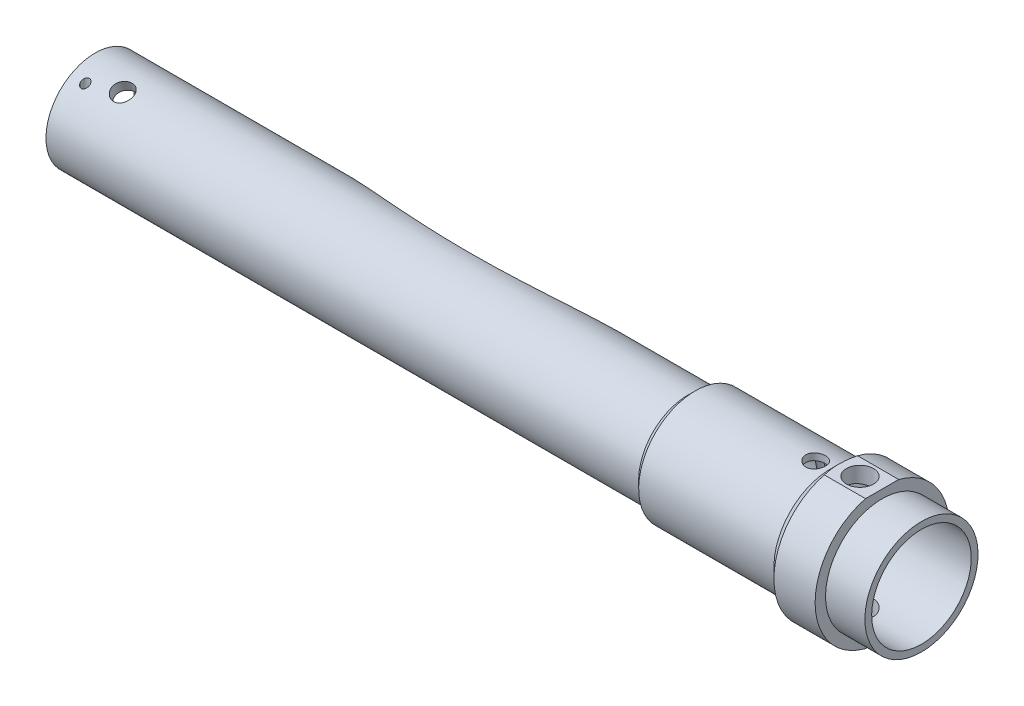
ISO-10303-21;
HEADER;
FILE_DESCRIPTION(('STEP AP214'),'2;1');
FILE_NAME('part.step','',(''),(''),'','','');
FILE_SCHEMA(('AUTOMOTIVE_DESIGN { 1 0 10303 214 1 1 1 1 }'));
ENDSEC;
DATA;
#1=APPLICATION_CONTEXT('core data for automotive mechanical design processes');
#2=APPLICATION_PROTOCOL_DEFINITION('international standard','automotive_design',2000,#1);
#3=PRODUCT_CONTEXT('',#1,'mechanical');
#4=PRODUCT('Part','Part','',(#3));
#5=PRODUCT_RELATED_PRODUCT_CATEGORY('part','',(#4));
#6=PRODUCT_DEFINITION_FORMATION('','',#4);
#7=PRODUCT_DEFINITION_CONTEXT('part definition',#1,'design');
#8=PRODUCT_DEFINITION('design','',#6,#7);
#9=PRODUCT_DEFINITION_SHAPE('','',#8);
#10=(LENGTH_UNIT() NAMED_UNIT(*) SI_UNIT(.MILLI.,.METRE.));
#11=(NAMED_UNIT(*) PLANE_ANGLE_UNIT() SI_UNIT($,.RADIAN.));
#12=(NAMED_UNIT(*) SI_UNIT($,.STERADIAN.) SOLID_ANGLE_UNIT());
#13=UNCERTAINTY_MEASURE_WITH_UNIT(LENGTH_MEASURE(1.E-05),#10,'distance_accuracy_value','');
#14=(GEOMETRIC_REPRESENTATION_CONTEXT(3) GLOBAL_UNCERTAINTY_ASSIGNED_CONTEXT((#13)) GLOBAL_UNIT_ASSIGNED_CONTEXT((#10,
#11,#12)) REPRESENTATION_CONTEXT('',''));
#15=CARTESIAN_POINT('',(0.,0.,0.));
#16=DIRECTION('',(0.,0.,1.));
#17=DIRECTION('',(1.,0.,0.));
#18=AXIS2_PLACEMENT_3D('',#15,#16,#17);
#19=CARTESIAN_POINT('',(16.8,0.,0.));
#20=DIRECTION('',(-1.,0.,0.));
#21=DIRECTION('',(0.,-1.,0.));
#22=AXIS2_PLACEMENT_3D('',#19,#20,#21);
#23=CYLINDRICAL_SURFACE('',#22,19.15);
#24=CARTESIAN_POINT('',(-58.0075188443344,0.,0.));
#25=DIRECTION('',(-1.,0.,0.));
#26=DIRECTION('',(0.,1.,0.));
#27=AXIS2_PLACEMENT_3D('',#24,#25,#26);
#28=CIRCLE('',#27,19.1500000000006);
#29=CARTESIAN_POINT('',(-58.0075188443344,19.1500000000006,0.));
#30=VERTEX_POINT('',#29);
#31=EDGE_CURVE('E203',#30,#30,#28,.T.);
#32=ORIENTED_EDGE('',*,*,#31,.T.);
#33=EDGE_LOOP('',(#32));
#34=FACE_BOUND('',#33,.T.);
#35=CARTESIAN_POINT('',(-50.0000000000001,0.,0.));
#36=DIRECTION('',(-1.,0.,0.));
#37=DIRECTION('',(0.,-1.,0.));
#38=AXIS2_PLACEMENT_3D('',#35,#36,#37);
#39=CIRCLE('',#38,19.15);
#40=CARTESIAN_POINT('',(-50.0000000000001,-19.15,0.));
#41=VERTEX_POINT('',#40);
#42=EDGE_CURVE('E210',#41,#41,#39,.F.);
#43=ORIENTED_EDGE('',*,*,#42,.T.);
#44=EDGE_LOOP('',(#43));
#45=FACE_BOUND('',#44,.T.);
#46=ADVANCED_FACE('F16',(#34,#45),#23,.F.);
#47=CARTESIAN_POINT('',(16.8,0.,0.));
#48=DIRECTION('',(-1.,0.,0.));
#49=DIRECTION('',(0.,-1.,0.));
#50=AXIS2_PLACEMENT_3D('',#47,#48,#49);
#51=CYLINDRICAL_SURFACE('',#50,23.);
#52=CARTESIAN_POINT('',(0.,0.,0.));
#53=DIRECTION('',(-1.,0.,0.));
#54=DIRECTION('',(0.,-1.,0.));
#55=AXIS2_PLACEMENT_3D('',#52,#53,#54);
#56=CIRCLE('',#55,23.);
#57=CARTESIAN_POINT('',(0.,-23.,0.));
#58=VERTEX_POINT('',#57);
#59=EDGE_CURVE('E342',#58,#58,#56,.T.);
#60=ORIENTED_EDGE('',*,*,#59,.T.);
#61=EDGE_LOOP('',(#60));
#62=FACE_BOUND('',#61,.T.);
#63=CARTESIAN_POINT('',(-16.,0.,0.));
#64=DIRECTION('',(-1.,0.,0.));
#65=DIRECTION('',(0.,-1.,0.));
#66=AXIS2_PLACEMENT_3D('',#63,#64,#65);
#67=CIRCLE('',#66,23.);
#68=CARTESIAN_POINT('',(-16.,-23.,0.));
#69=VERTEX_POINT('',#68);
#70=EDGE_CURVE('E341',#69,#69,#67,.F.);
#71=ORIENTED_EDGE('',*,*,#70,.T.);
#72=EDGE_LOOP('',(#71));
#73=FACE_BOUND('',#72,.T.);
#74=ADVANCED_FACE('F460',(#62,#73),#51,.T.);
#75=CARTESIAN_POINT('',(-50.0000000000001,0.,0.));
#76=DIRECTION('',(-1.,0.,0.));
#77=DIRECTION('',(0.,-1.,0.));
#78=AXIS2_PLACEMENT_3D('',#75,#76,#77);
#79=PLANE('',#78);
#80=CARTESIAN_POINT('',(-50.0000000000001,0.,0.));
#81=DIRECTION('',(-1.,0.,0.));
#82=DIRECTION('',(0.,-1.,0.));
#83=AXIS2_PLACEMENT_3D('',#80,#81,#82);
#84=CIRCLE('',#83,20.25);
#85=CARTESIAN_POINT('',(-50.0000000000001,-20.25,0.));
#86=VERTEX_POINT('',#85);
#87=EDGE_CURVE('E742',#86,#86,#84,.F.);
#88=ORIENTED_EDGE('',*,*,#87,.T.);
#89=EDGE_LOOP('',(#88));
#90=FACE_BOUND('',#89,.T.);
#91=ORIENTED_EDGE('',*,*,#42,.F.);
#92=EDGE_LOOP('',(#91));
#93=FACE_BOUND('',#92,.T.);
#94=ADVANCED_FACE('F453',(#90,#93),#79,.F.);
#95=CARTESIAN_POINT('',(0.,0.,0.));
#96=DIRECTION('',(-1.,0.,0.));
#97=DIRECTION('',(0.,-1.,0.));
#98=AXIS2_PLACEMENT_3D('',#95,#96,#97);
#99=PLANE('',#98);
#100=ORIENTED_EDGE('',*,*,#59,.F.);
#101=EDGE_LOOP('',(#100));
#102=FACE_BOUND('',#101,.T.);
#103=CARTESIAN_POINT('',(0.,0.,0.));
#104=DIRECTION('',(-1.,0.,0.));
#105=DIRECTION('',(0.,-1.,0.));
#106=AXIS2_PLACEMENT_3D('',#103,#104,#105);
#107=CIRCLE('',#106,20.25);
#108=CARTESIAN_POINT('',(0.,-20.25,0.));
#109=VERTEX_POINT('',#108);
#110=EDGE_CURVE('E744',#109,#109,#107,.T.);
#111=ORIENTED_EDGE('',*,*,#110,.T.);
#112=EDGE_LOOP('',(#111));
#113=FACE_BOUND('',#112,.T.);
#114=ADVANCED_FACE('F446',(#102,#113),#99,.F.);
#115=CARTESIAN_POINT('',(-25.0000000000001,67.5,0.));
#116=DIRECTION('',(0.,-1.,0.));
#117=DIRECTION('',(1.,0.,0.));
#118=AXIS2_PLACEMENT_3D('',#115,#116,#117);
#119=CYLINDRICAL_SURFACE('',#118,5.5);
#120=CARTESIAN_POINT('',(-25.0000000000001,19.4887788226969,-5.5));
#121=CARTESIAN_POINT('',(-24.8487405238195,19.4887791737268,-5.4999995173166));
#122=CARTESIAN_POINT('',(-24.6974702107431,19.4905445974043,-5.4937548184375));
#123=CARTESIAN_POINT('',(-24.3959824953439,19.4975539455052,-5.46882571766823));
#124=CARTESIAN_POINT('',(-24.2457655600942,19.5027993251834,-5.45013611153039));
#125=CARTESIAN_POINT('',(-23.9473171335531,19.5166182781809,-5.4004422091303));
#126=CARTESIAN_POINT('',(-23.79908879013,19.5251966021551,-5.36942033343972));
#127=CARTESIAN_POINT('',(-23.5058349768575,19.5454245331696,-5.29531426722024));
#128=CARTESIAN_POINT('',(-23.3608107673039,19.5570753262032,-5.25222541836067));
#129=CARTESIAN_POINT('',(-23.0753633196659,19.5830684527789,-5.15446209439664));
#130=CARTESIAN_POINT('',(-22.9349299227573,19.5974042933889,-5.0998155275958));
#131=CARTESIAN_POINT('',(-22.6591787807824,19.6283764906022,-4.97927777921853));
#132=CARTESIAN_POINT('',(-22.5238629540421,19.6450136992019,-4.91338243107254));
#133=CARTESIAN_POINT('',(-22.2593474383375,19.6801041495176,-4.770888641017));
#134=CARTESIAN_POINT('',(-22.1301440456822,19.6985562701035,-4.69429679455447));
#135=CARTESIAN_POINT('',(-21.8785193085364,19.7367846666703,-4.5308799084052));
#136=CARTESIAN_POINT('',(-21.7561005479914,19.7565614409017,-4.44405100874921));
#137=CARTESIAN_POINT('',(-21.5160881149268,19.7973693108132,-4.25862482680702));
#138=CARTESIAN_POINT('',(-21.3986724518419,19.8184188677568,-4.15980112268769));
#139=CARTESIAN_POINT('',(-21.1724870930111,19.86076548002,-3.95267873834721));
#140=CARTESIAN_POINT('',(-21.0637206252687,19.8820626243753,-3.84437655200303));
#141=CARTESIAN_POINT('',(-20.8556064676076,19.9243096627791,-3.6190492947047));
#142=CARTESIAN_POINT('',(-20.7562568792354,19.9452596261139,-3.50202599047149));
#143=CARTESIAN_POINT('',(-20.5675801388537,19.9862542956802,-3.25994087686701));
#144=CARTESIAN_POINT('',(-20.4782566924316,20.0062986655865,-3.13487612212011));
#145=CARTESIAN_POINT('',(-20.3089245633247,20.0452434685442,-2.87544641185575));
#146=CARTESIAN_POINT('',(-20.2290916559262,20.0641198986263,-2.74096300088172));
#147=CARTESIAN_POINT('',(-20.081041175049,20.0998381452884,-2.46542483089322));
#148=CARTESIAN_POINT('',(-20.0128280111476,20.1166791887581,-2.3243676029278));
#149=CARTESIAN_POINT('',(-19.8886313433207,20.1478278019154,-2.03676491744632));
#150=CARTESIAN_POINT('',(-19.8326415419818,20.1621366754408,-1.89022233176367));
#151=CARTESIAN_POINT('',(-19.7333042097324,20.1878260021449,-1.59266612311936));
#152=CARTESIAN_POINT('',(-19.6899611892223,20.1992054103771,-1.44165092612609));
#153=CARTESIAN_POINT('',(-19.5813284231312,20.2279365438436,-0.990792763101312));
#154=CARTESIAN_POINT('',(-19.5343281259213,20.2406864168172,-0.685904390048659));
#155=CARTESIAN_POINT('',(-19.5024934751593,20.2493236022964,-0.226225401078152));
#156=CARTESIAN_POINT('',(-19.49833204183,20.2504531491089,-0.0725487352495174));
#157=CARTESIAN_POINT('',(-19.5028619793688,20.2492225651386,0.23461983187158));
#158=CARTESIAN_POINT('',(-19.5115534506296,20.2468624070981,0.388111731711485));
#159=CARTESIAN_POINT('',(-19.5560884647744,20.2348132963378,0.838476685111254));
#160=CARTESIAN_POINT('',(-19.6098380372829,20.2203038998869,1.13364919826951));
#161=CARTESIAN_POINT('',(-19.7642031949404,20.1797084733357,1.71046758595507));
#162=CARTESIAN_POINT('',(-19.8648217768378,20.1536217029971,1.99211259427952));
#163=CARTESIAN_POINT('',(-20.1110316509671,20.0922912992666,2.5374011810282));
#164=CARTESIAN_POINT('',(-20.2570724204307,20.0569567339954,2.80083116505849));
#165=CARTESIAN_POINT('',(-20.5897704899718,19.9809039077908,3.29996511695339));
#166=CARTESIAN_POINT('',(-20.7764334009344,19.9401849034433,3.53566524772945));
#167=CARTESIAN_POINT('',(-21.086230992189,19.8776108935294,3.86734677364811));
#168=CARTESIAN_POINT('',(-21.1964291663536,19.8561568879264,3.97577011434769));
#169=CARTESIAN_POINT('',(-21.4255751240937,19.813539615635,4.18297852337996));
#170=CARTESIAN_POINT('',(-21.54451984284,19.7923762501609,4.28176693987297));
#171=CARTESIAN_POINT('',(-21.7904976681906,19.7509163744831,4.46911921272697));
#172=CARTESIAN_POINT('',(-21.9175374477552,19.730620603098,4.55767445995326));
#173=CARTESIAN_POINT('',(-22.1787459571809,19.6915035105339,4.72381951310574));
#174=CARTESIAN_POINT('',(-22.3129118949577,19.6726816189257,4.80141357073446));
#175=CARTESIAN_POINT('',(-22.5885989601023,19.6369175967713,4.94565829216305));
#176=CARTESIAN_POINT('',(-22.7301692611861,19.6199912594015,5.01221895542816));
#177=CARTESIAN_POINT('',(-23.0186534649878,19.5887132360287,5.1330997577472));
#178=CARTESIAN_POINT('',(-23.1655651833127,19.5743605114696,5.18742483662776));
#179=CARTESIAN_POINT('',(-23.4634817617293,19.5486931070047,5.28332850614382));
#180=CARTESIAN_POINT('',(-23.614479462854,19.5373734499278,5.32492799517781));
#181=CARTESIAN_POINT('',(-23.9196169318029,19.5181086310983,5.39511488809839));
#182=CARTESIAN_POINT('',(-24.0737551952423,19.5101618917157,5.42370837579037));
#183=CARTESIAN_POINT('',(-24.3564999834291,19.4989825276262,5.46374639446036));
#184=CARTESIAN_POINT('',(-24.4847844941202,19.4951636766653,5.47733341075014));
#185=CARTESIAN_POINT('',(-24.7420433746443,19.4900616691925,5.49546043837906));
#186=CARTESIAN_POINT('',(-24.871017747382,19.4887785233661,5.50000041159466));
#187=CARTESIAN_POINT('',(-25.1512594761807,19.4887791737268,5.4999995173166));
#188=CARTESIAN_POINT('',(-25.3025297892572,19.4905445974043,5.4937548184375));
#189=CARTESIAN_POINT('',(-25.6040175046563,19.4975539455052,5.46882571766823));
#190=CARTESIAN_POINT('',(-25.7542344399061,19.5027993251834,5.45013611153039));
#191=CARTESIAN_POINT('',(-26.0526828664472,19.5166182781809,5.4004422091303));
#192=CARTESIAN_POINT('',(-26.2009112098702,19.5251966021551,5.36942033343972));
#193=CARTESIAN_POINT('',(-26.4941650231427,19.5454245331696,5.29531426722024));
#194=CARTESIAN_POINT('',(-26.6391892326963,19.5570753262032,5.25222541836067));
#195=CARTESIAN_POINT('',(-26.9246366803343,19.5830684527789,5.15446209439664));
#196=CARTESIAN_POINT('',(-27.065070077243,19.5974042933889,5.0998155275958));
#197=CARTESIAN_POINT('',(-27.3408212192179,19.6283764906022,4.97927777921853));
#198=CARTESIAN_POINT('',(-27.4761370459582,19.6450136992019,4.91338243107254));
#199=CARTESIAN_POINT('',(-27.7406525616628,19.6801041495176,4.770888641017));
#200=CARTESIAN_POINT('',(-27.8698559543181,19.6985562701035,4.69429679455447));
#201=CARTESIAN_POINT('',(-28.1214806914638,19.7367846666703,4.5308799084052));
#202=CARTESIAN_POINT('',(-28.2438994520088,19.7565614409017,4.44405100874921));
#203=CARTESIAN_POINT('',(-28.4839118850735,19.7973693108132,4.25862482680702));
#204=CARTESIAN_POINT('',(-28.6013275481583,19.8184188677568,4.15980112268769));
#205=CARTESIAN_POINT('',(-28.8275129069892,19.86076548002,3.95267873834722));
#206=CARTESIAN_POINT('',(-28.9362793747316,19.8820626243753,3.84437655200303));
#207=CARTESIAN_POINT('',(-29.1443935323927,19.9243096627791,3.6190492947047));
#208=CARTESIAN_POINT('',(-29.2437431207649,19.9452596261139,3.50202599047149));
#209=CARTESIAN_POINT('',(-29.4324198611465,19.9862542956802,3.25994087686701));
#210=CARTESIAN_POINT('',(-29.5217433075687,20.0062986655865,3.13487612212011));
#211=CARTESIAN_POINT('',(-29.6910754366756,20.0452434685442,2.87544641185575));
#212=CARTESIAN_POINT('',(-29.7709083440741,20.0641198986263,2.74096300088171));
#213=CARTESIAN_POINT('',(-29.9189588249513,20.0998381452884,2.46542483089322));
#214=CARTESIAN_POINT('',(-29.9871719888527,20.1166791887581,2.3243676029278));
#215=CARTESIAN_POINT('',(-30.1113686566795,20.1478278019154,2.03676491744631));
#216=CARTESIAN_POINT('',(-30.1673584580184,20.1621366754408,1.89022233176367));
#217=CARTESIAN_POINT('',(-30.2666957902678,20.1878260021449,1.59266612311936));
#218=CARTESIAN_POINT('',(-30.310038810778,20.1992054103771,1.44165092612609));
#219=CARTESIAN_POINT('',(-30.418671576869,20.2279365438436,0.990792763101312));
#220=CARTESIAN_POINT('',(-30.465671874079,20.2406864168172,0.685904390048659));
#221=CARTESIAN_POINT('',(-30.497506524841,20.2493236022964,0.226225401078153));
#222=CARTESIAN_POINT('',(-30.5016679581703,20.2504531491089,0.0725487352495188));
#223=CARTESIAN_POINT('',(-30.4971380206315,20.2492225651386,-0.234619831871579));
#224=CARTESIAN_POINT('',(-30.4884465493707,20.2468624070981,-0.388111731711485));
#225=CARTESIAN_POINT('',(-30.4439115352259,20.2348132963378,-0.838476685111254));
#226=CARTESIAN_POINT('',(-30.3901619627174,20.2203038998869,-1.13364919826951));
#227=CARTESIAN_POINT('',(-30.2357968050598,20.1797084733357,-1.71046758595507));
#228=CARTESIAN_POINT('',(-30.1351782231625,20.1536217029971,-1.99211259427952));
#229=CARTESIAN_POINT('',(-29.8889683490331,20.0922912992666,-2.5374011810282));
#230=CARTESIAN_POINT('',(-29.7429275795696,20.0569567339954,-2.8008311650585));
#231=CARTESIAN_POINT('',(-29.4102295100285,19.9809039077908,-3.29996511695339));
#232=CARTESIAN_POINT('',(-29.2235665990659,19.9401849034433,-3.53566524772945));
#233=CARTESIAN_POINT('',(-28.9137690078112,19.8776108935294,-3.86734677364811));
#234=CARTESIAN_POINT('',(-28.8035708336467,19.8561568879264,-3.97577011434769));
#235=CARTESIAN_POINT('',(-28.5744248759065,19.813539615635,-4.18297852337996));
#236=CARTESIAN_POINT('',(-28.4554801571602,19.7923762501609,-4.28176693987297));
#237=CARTESIAN_POINT('',(-28.2095023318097,19.7509163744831,-4.46911921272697));
#238=CARTESIAN_POINT('',(-28.0824625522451,19.730620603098,-4.55767445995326));
#239=CARTESIAN_POINT('',(-27.8212540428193,19.6915035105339,-4.72381951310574));
#240=CARTESIAN_POINT('',(-27.6870881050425,19.6726816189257,-4.80141357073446));
#241=CARTESIAN_POINT('',(-27.4114010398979,19.6369175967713,-4.94565829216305));
#242=CARTESIAN_POINT('',(-27.2698307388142,19.6199912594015,-5.01221895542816));
#243=CARTESIAN_POINT('',(-26.9813465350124,19.5887132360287,-5.1330997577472));
#244=CARTESIAN_POINT('',(-26.8344348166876,19.5743605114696,-5.18742483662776));
#245=CARTESIAN_POINT('',(-26.5365182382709,19.5486931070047,-5.28332850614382));
#246=CARTESIAN_POINT('',(-26.3855205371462,19.5373734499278,-5.32492799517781));
#247=CARTESIAN_POINT('',(-26.0803830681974,19.5181086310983,-5.39511488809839));
#248=CARTESIAN_POINT('',(-25.9262448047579,19.5101618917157,-5.42370837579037));
#249=CARTESIAN_POINT('',(-25.6435000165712,19.4989825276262,-5.46374639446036));
#250=CARTESIAN_POINT('',(-25.5152155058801,19.4951636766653,-5.47733341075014));
#251=CARTESIAN_POINT('',(-25.257956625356,19.4900616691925,-5.49546043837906));
#252=CARTESIAN_POINT('',(-25.1289822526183,19.4887785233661,-5.50000041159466));
#253=CARTESIAN_POINT('',(-25.0000000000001,19.4887788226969,-5.5));
#254=B_SPLINE_CURVE_WITH_KNOTS('',3,(#120,#121,#122,#123,#124,#125,#126,#127,#128,#129,#130,
#131,#132,#133,#134,#135,#136,#137,#138,#139,#140,#141,#142,#143,#144,#145,#146,#147,#148,#149,
#150,#151,#152,#153,#154,#155,#156,#157,#158,#159,#160,#161,#162,#163,#164,#165,#166,#167,#168,
#169,#170,#171,#172,#173,#174,#175,#176,#177,#178,#179,#180,#181,#182,#183,#184,#185,#186,#187,
#188,#189,#190,#191,#192,#193,#194,#195,#196,#197,#198,#199,#200,#201,#202,#203,#204,#205,#206,
#207,#208,#209,#210,#211,#212,#213,#214,#215,#216,#217,#218,#219,#220,#221,#222,#223,#224,#225,
#226,#227,#228,#229,#230,#231,#232,#233,#234,#235,#236,#237,#238,#239,#240,#241,#242,#243,#244,
#245,#246,#247,#248,#249,#250,#251,#252,#253),.UNSPECIFIED.,.T.,.F.,(4,2,2,2,2,2,2,2,2,2,2,2,2,
2,2,2,2,2,2,2,2,2,2,2,2,2,2,2,2,2,2,2,2,2,2,2,2,2,2,2,2,2,2,2,2,2,2,2,2,2,2,2,2,2,2,2,2,2,2,2,2,
2,2,2,2,2,4),(0.,0.453658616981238,0.907507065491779,1.3620048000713,1.81667823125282,
2.2702660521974,2.72402224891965,3.17749988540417,3.63114905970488,4.09533052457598,
4.55968442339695,5.02394450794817,5.48837561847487,5.96038501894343,6.4325731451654,
6.90451742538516,7.37662981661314,8.29741901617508,8.7581664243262,9.21891743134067,
10.1154660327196,11.0120719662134,11.9178488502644,12.8237509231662,13.2915270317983,
13.7591400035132,14.2271435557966,14.6949650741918,15.1664325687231,15.6377093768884,
16.1082080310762,16.5784863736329,16.9653293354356,17.3521739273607,17.8058325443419,
18.2596809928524,18.7141787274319,19.1688521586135,19.6224399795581,20.0761961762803,
20.5296738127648,20.9833229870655,21.4475044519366,21.9118583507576,22.3761184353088,
22.8405495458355,23.3125589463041,23.7847470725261,24.2566913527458,24.7288037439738,
25.6495929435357,26.1103403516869,26.5710913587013,27.4676399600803,28.364245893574,
29.2700227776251,30.1759248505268,30.6437009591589,31.1113139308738,31.5793174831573,
32.0471390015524,32.5186064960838,32.9898833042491,33.4603819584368,33.9306603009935,
34.3175032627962,34.7043478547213),.UNSPECIFIED.);
#255=CARTESIAN_POINT('',(-25.0000000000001,19.4887788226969,-5.5));
#256=VERTEX_POINT('',#255);
#257=EDGE_CURVE('E329',#256,#256,#254,.T.);
#258=ORIENTED_EDGE('',*,*,#257,.T.);
#259=EDGE_LOOP('',(#258));
#260=FACE_BOUND('',#259,.T.);
#261=CARTESIAN_POINT('',(-25.0000000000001,26.4,0.));
#262=DIRECTION('',(0.,-1.,0.));
#263=DIRECTION('',(1.,0.,0.));
#264=AXIS2_PLACEMENT_3D('',#261,#262,#263);
#265=CIRCLE('',#264,5.5);
#266=CARTESIAN_POINT('',(-19.5000000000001,26.4,0.));
#267=VERTEX_POINT('',#266);
#268=EDGE_CURVE('E183',#267,#267,#265,.F.);
#269=ORIENTED_EDGE('',*,*,#268,.T.);
#270=EDGE_LOOP('',(#269));
#271=FACE_BOUND('',#270,.T.);
#272=ADVANCED_FACE('F193',(#260,#271),#119,.F.);
#273=CARTESIAN_POINT('',(-59.4999999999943,0.,0.));
#274=DIRECTION('',(-1.,0.,0.));
#275=DIRECTION('',(0.,1.,0.));
#276=AXIS2_PLACEMENT_3D('',#273,#274,#275);
#277=TOROIDAL_SURFACE('',#276,19.,1.5);
#278=ORIENTED_EDGE('',*,*,#31,.F.);
#279=EDGE_LOOP('',(#278));
#280=FACE_BOUND('',#279,.T.);
#281=CARTESIAN_POINT('',(-60.9999999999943,0.,0.));
#282=DIRECTION('',(-1.,0.,0.));
#283=DIRECTION('',(0.,1.,0.));
#284=AXIS2_PLACEMENT_3D('',#281,#282,#283);
#285=CIRCLE('',#284,19.);
#286=CARTESIAN_POINT('',(-60.9999999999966,19.,0.));
#287=VERTEX_POINT('',#286);
#288=CARTESIAN_POINT('',(-60.9999999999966,-19.,0.));
#289=VERTEX_POINT('',#288);
#290=EDGE_CURVE('E94',#287,#289,#285,.T.);
#291=ORIENTED_EDGE('',*,*,#290,.T.);
#292=CARTESIAN_POINT('',(-60.9999999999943,0.,0.));
#293=DIRECTION('',(-1.,0.,0.));
#294=DIRECTION('',(0.,-1.,0.));
#295=AXIS2_PLACEMENT_3D('',#292,#293,#294);
#296=CIRCLE('',#295,19.);
#297=EDGE_CURVE('E125',#289,#287,#296,.T.);
#298=ORIENTED_EDGE('',*,*,#297,.T.);
#299=EDGE_LOOP('',(#291,#298));
#300=FACE_BOUND('',#299,.T.);
#301=ADVANCED_FACE('F187',(#280,#300),#277,.F.);
#302=CARTESIAN_POINT('',(-25.0000000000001,67.5,0.));
#303=DIRECTION('',(0.,-1.,0.));
#304=DIRECTION('',(1.,0.,0.));
#305=AXIS2_PLACEMENT_3D('',#302,#303,#304);
#306=CYLINDRICAL_SURFACE('',#305,5.5);
#307=CARTESIAN_POINT('',(-25.0000000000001,-19.4887788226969,-5.5));
#308=CARTESIAN_POINT('',(-24.8487405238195,-19.4887791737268,-5.4999995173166));
#309=CARTESIAN_POINT('',(-24.6974702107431,-19.4905445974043,-5.4937548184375));
#310=CARTESIAN_POINT('',(-24.3959824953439,-19.4975539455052,-5.46882571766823));
#311=CARTESIAN_POINT('',(-24.2457655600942,-19.5027993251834,-5.45013611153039));
#312=CARTESIAN_POINT('',(-23.9473171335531,-19.5166182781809,-5.4004422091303));
#313=CARTESIAN_POINT('',(-23.79908879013,-19.5251966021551,-5.36942033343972));
#314=CARTESIAN_POINT('',(-23.5058349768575,-19.5454245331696,-5.29531426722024));
#315=CARTESIAN_POINT('',(-23.3608107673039,-19.5570753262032,-5.25222541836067));
#316=CARTESIAN_POINT('',(-23.0753633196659,-19.5830684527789,-5.15446209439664));
#317=CARTESIAN_POINT('',(-22.9349299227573,-19.5974042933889,-5.0998155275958));
#318=CARTESIAN_POINT('',(-22.6591787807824,-19.6283764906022,-4.97927777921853));
#319=CARTESIAN_POINT('',(-22.5238629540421,-19.6450136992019,-4.91338243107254));
#320=CARTESIAN_POINT('',(-22.2593474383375,-19.6801041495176,-4.770888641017));
#321=CARTESIAN_POINT('',(-22.1301440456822,-19.6985562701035,-4.69429679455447));
#322=CARTESIAN_POINT('',(-21.8785193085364,-19.7367846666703,-4.5308799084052));
#323=CARTESIAN_POINT('',(-21.7561005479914,-19.7565614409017,-4.44405100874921));
#324=CARTESIAN_POINT('',(-21.5160881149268,-19.7973693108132,-4.25862482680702));
#325=CARTESIAN_POINT('',(-21.3986724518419,-19.8184188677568,-4.15980112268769));
#326=CARTESIAN_POINT('',(-21.1724870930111,-19.86076548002,-3.95267873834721));
#327=CARTESIAN_POINT('',(-21.0637206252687,-19.8820626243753,-3.84437655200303));
#328=CARTESIAN_POINT('',(-20.8556064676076,-19.9243096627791,-3.6190492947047));
#329=CARTESIAN_POINT('',(-20.7562568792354,-19.9452596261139,-3.50202599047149));
#330=CARTESIAN_POINT('',(-20.5675801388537,-19.9862542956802,-3.25994087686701));
#331=CARTESIAN_POINT('',(-20.4782566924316,-20.0062986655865,-3.13487612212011));
#332=CARTESIAN_POINT('',(-20.3089245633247,-20.0452434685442,-2.87544641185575));
#333=CARTESIAN_POINT('',(-20.2290916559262,-20.0641198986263,-2.74096300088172));
#334=CARTESIAN_POINT('',(-20.081041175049,-20.0998381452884,-2.46542483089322));
#335=CARTESIAN_POINT('',(-20.0128280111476,-20.1166791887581,-2.3243676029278));
#336=CARTESIAN_POINT('',(-19.8886313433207,-20.1478278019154,-2.03676491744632));
#337=CARTESIAN_POINT('',(-19.8326415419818,-20.1621366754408,-1.89022233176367));
#338=CARTESIAN_POINT('',(-19.7333042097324,-20.1878260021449,-1.59266612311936));
#339=CARTESIAN_POINT('',(-19.6899611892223,-20.1992054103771,-1.44165092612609));
#340=CARTESIAN_POINT('',(-19.5813284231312,-20.2279365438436,-0.990792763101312));
#341=CARTESIAN_POINT('',(-19.5343281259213,-20.2406864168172,-0.685904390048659));
#342=CARTESIAN_POINT('',(-19.5024934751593,-20.2493236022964,-0.226225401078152));
#343=CARTESIAN_POINT('',(-19.49833204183,-20.2504531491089,-0.0725487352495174));
#344=CARTESIAN_POINT('',(-19.5028619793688,-20.2492225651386,0.23461983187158));
#345=CARTESIAN_POINT('',(-19.5115534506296,-20.2468624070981,0.388111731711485));
#346=CARTESIAN_POINT('',(-19.5560884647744,-20.2348132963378,0.838476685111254));
#347=CARTESIAN_POINT('',(-19.6098380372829,-20.2203038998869,1.13364919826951));
#348=CARTESIAN_POINT('',(-19.7642031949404,-20.1797084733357,1.71046758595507));
#349=CARTESIAN_POINT('',(-19.8648217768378,-20.1536217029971,1.99211259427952));
#350=CARTESIAN_POINT('',(-20.1110316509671,-20.0922912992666,2.5374011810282));
#351=CARTESIAN_POINT('',(-20.2570724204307,-20.0569567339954,2.80083116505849));
#352=CARTESIAN_POINT('',(-20.5897704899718,-19.9809039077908,3.29996511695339));
#353=CARTESIAN_POINT('',(-20.7764334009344,-19.9401849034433,3.53566524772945));
#354=CARTESIAN_POINT('',(-21.086230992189,-19.8776108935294,3.86734677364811));
#355=CARTESIAN_POINT('',(-21.1964291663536,-19.8561568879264,3.97577011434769));
#356=CARTESIAN_POINT('',(-21.4255751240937,-19.813539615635,4.18297852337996));
#357=CARTESIAN_POINT('',(-21.54451984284,-19.7923762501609,4.28176693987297));
#358=CARTESIAN_POINT('',(-21.7904976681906,-19.7509163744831,4.46911921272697));
#359=CARTESIAN_POINT('',(-21.9175374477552,-19.730620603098,4.55767445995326));
#360=CARTESIAN_POINT('',(-22.1787459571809,-19.6915035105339,4.72381951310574));
#361=CARTESIAN_POINT('',(-22.3129118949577,-19.6726816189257,4.80141357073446));
#362=CARTESIAN_POINT('',(-22.5885989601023,-19.6369175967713,4.94565829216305));
#363=CARTESIAN_POINT('',(-22.7301692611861,-19.6199912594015,5.01221895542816));
#364=CARTESIAN_POINT('',(-23.0186534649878,-19.5887132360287,5.1330997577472));
#365=CARTESIAN_POINT('',(-23.1655651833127,-19.5743605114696,5.18742483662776));
#366=CARTESIAN_POINT('',(-23.4634817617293,-19.5486931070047,5.28332850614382));
#367=CARTESIAN_POINT('',(-23.614479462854,-19.5373734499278,5.32492799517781));
#368=CARTESIAN_POINT('',(-23.9196169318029,-19.5181086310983,5.39511488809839));
#369=CARTESIAN_POINT('',(-24.0737551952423,-19.5101618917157,5.42370837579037));
#370=CARTESIAN_POINT('',(-24.3564999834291,-19.4989825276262,5.46374639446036));
#371=CARTESIAN_POINT('',(-24.4847844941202,-19.4951636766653,5.47733341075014));
#372=CARTESIAN_POINT('',(-24.7420433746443,-19.4900616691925,5.49546043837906));
#373=CARTESIAN_POINT('',(-24.871017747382,-19.4887785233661,5.50000041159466));
#374=CARTESIAN_POINT('',(-25.1512594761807,-19.4887791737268,5.4999995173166));
#375=CARTESIAN_POINT('',(-25.3025297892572,-19.4905445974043,5.4937548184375));
#376=CARTESIAN_POINT('',(-25.6040175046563,-19.4975539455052,5.46882571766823));
#377=CARTESIAN_POINT('',(-25.7542344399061,-19.5027993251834,5.45013611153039));
#378=CARTESIAN_POINT('',(-26.0526828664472,-19.5166182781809,5.4004422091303));
#379=CARTESIAN_POINT('',(-26.2009112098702,-19.5251966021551,5.36942033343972));
#380=CARTESIAN_POINT('',(-26.4941650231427,-19.5454245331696,5.29531426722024));
#381=CARTESIAN_POINT('',(-26.6391892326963,-19.5570753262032,5.25222541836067));
#382=CARTESIAN_POINT('',(-26.9246366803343,-19.5830684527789,5.15446209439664));
#383=CARTESIAN_POINT('',(-27.065070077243,-19.5974042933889,5.0998155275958));
#384=CARTESIAN_POINT('',(-27.3408212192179,-19.6283764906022,4.97927777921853));
#385=CARTESIAN_POINT('',(-27.4761370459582,-19.6450136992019,4.91338243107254));
#386=CARTESIAN_POINT('',(-27.7406525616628,-19.6801041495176,4.770888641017));
#387=CARTESIAN_POINT('',(-27.8698559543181,-19.6985562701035,4.69429679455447));
#388=CARTESIAN_POINT('',(-28.1214806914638,-19.7367846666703,4.5308799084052));
#389=CARTESIAN_POINT('',(-28.2438994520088,-19.7565614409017,4.44405100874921));
#390=CARTESIAN_POINT('',(-28.4839118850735,-19.7973693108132,4.25862482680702));
#391=CARTESIAN_POINT('',(-28.6013275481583,-19.8184188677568,4.15980112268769));
#392=CARTESIAN_POINT('',(-28.8275129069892,-19.86076548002,3.95267873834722));
#393=CARTESIAN_POINT('',(-28.9362793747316,-19.8820626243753,3.84437655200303));
#394=CARTESIAN_POINT('',(-29.1443935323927,-19.9243096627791,3.6190492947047));
#395=CARTESIAN_POINT('',(-29.2437431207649,-19.9452596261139,3.50202599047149));
#396=CARTESIAN_POINT('',(-29.4324198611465,-19.9862542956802,3.25994087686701));
#397=CARTESIAN_POINT('',(-29.5217433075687,-20.0062986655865,3.13487612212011));
#398=CARTESIAN_POINT('',(-29.6910754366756,-20.0452434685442,2.87544641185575));
#399=CARTESIAN_POINT('',(-29.7709083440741,-20.0641198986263,2.74096300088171));
#400=CARTESIAN_POINT('',(-29.9189588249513,-20.0998381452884,2.46542483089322));
#401=CARTESIAN_POINT('',(-29.9871719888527,-20.1166791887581,2.3243676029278));
#402=CARTESIAN_POINT('',(-30.1113686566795,-20.1478278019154,2.03676491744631));
#403=CARTESIAN_POINT('',(-30.1673584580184,-20.1621366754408,1.89022233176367));
#404=CARTESIAN_POINT('',(-30.2666957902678,-20.1878260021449,1.59266612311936));
#405=CARTESIAN_POINT('',(-30.310038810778,-20.1992054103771,1.44165092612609));
#406=CARTESIAN_POINT('',(-30.418671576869,-20.2279365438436,0.990792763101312));
#407=CARTESIAN_POINT('',(-30.465671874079,-20.2406864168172,0.685904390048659));
#408=CARTESIAN_POINT('',(-30.497506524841,-20.2493236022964,0.226225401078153));
#409=CARTESIAN_POINT('',(-30.5016679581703,-20.2504531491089,0.0725487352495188));
#410=CARTESIAN_POINT('',(-30.4971380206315,-20.2492225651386,-0.234619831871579));
#411=CARTESIAN_POINT('',(-30.4884465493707,-20.2468624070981,-0.388111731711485));
#412=CARTESIAN_POINT('',(-30.4439115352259,-20.2348132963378,-0.838476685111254));
#413=CARTESIAN_POINT('',(-30.3901619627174,-20.2203038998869,-1.13364919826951));
#414=CARTESIAN_POINT('',(-30.2357968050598,-20.1797084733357,-1.71046758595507));
#415=CARTESIAN_POINT('',(-30.1351782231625,-20.1536217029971,-1.99211259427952));
#416=CARTESIAN_POINT('',(-29.8889683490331,-20.0922912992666,-2.5374011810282));
#417=CARTESIAN_POINT('',(-29.7429275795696,-20.0569567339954,-2.8008311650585));
#418=CARTESIAN_POINT('',(-29.4102295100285,-19.9809039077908,-3.29996511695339));
#419=CARTESIAN_POINT('',(-29.2235665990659,-19.9401849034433,-3.53566524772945));
#420=CARTESIAN_POINT('',(-28.9137690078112,-19.8776108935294,-3.86734677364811));
#421=CARTESIAN_POINT('',(-28.8035708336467,-19.8561568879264,-3.97577011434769));
#422=CARTESIAN_POINT('',(-28.5744248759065,-19.813539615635,-4.18297852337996));
#423=CARTESIAN_POINT('',(-28.4554801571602,-19.7923762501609,-4.28176693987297));
#424=CARTESIAN_POINT('',(-28.2095023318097,-19.7509163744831,-4.46911921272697));
#425=CARTESIAN_POINT('',(-28.0824625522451,-19.730620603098,-4.55767445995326));
#426=CARTESIAN_POINT('',(-27.8212540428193,-19.6915035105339,-4.72381951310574));
#427=CARTESIAN_POINT('',(-27.6870881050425,-19.6726816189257,-4.80141357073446));
#428=CARTESIAN_POINT('',(-27.4114010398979,-19.6369175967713,-4.94565829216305));
#429=CARTESIAN_POINT('',(-27.2698307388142,-19.6199912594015,-5.01221895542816));
#430=CARTESIAN_POINT('',(-26.9813465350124,-19.5887132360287,-5.1330997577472));
#431=CARTESIAN_POINT('',(-26.8344348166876,-19.5743605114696,-5.18742483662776));
#432=CARTESIAN_POINT('',(-26.5365182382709,-19.5486931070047,-5.28332850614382));
#433=CARTESIAN_POINT('',(-26.3855205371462,-19.5373734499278,-5.32492799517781));
#434=CARTESIAN_POINT('',(-26.0803830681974,-19.5181086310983,-5.39511488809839));
#435=CARTESIAN_POINT('',(-25.9262448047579,-19.5101618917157,-5.42370837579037));
#436=CARTESIAN_POINT('',(-25.6435000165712,-19.4989825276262,-5.46374639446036));
#437=CARTESIAN_POINT('',(-25.5152155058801,-19.4951636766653,-5.47733341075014));
#438=CARTESIAN_POINT('',(-25.257956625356,-19.4900616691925,-5.49546043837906));
#439=CARTESIAN_POINT('',(-25.1289822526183,-19.4887785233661,-5.50000041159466));
#440=CARTESIAN_POINT('',(-25.0000000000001,-19.4887788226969,-5.5));
#441=B_SPLINE_CURVE_WITH_KNOTS('',3,(#307,#308,#309,#310,#311,#312,#313,#314,#315,#316,#317,
#318,#319,#320,#321,#322,#323,#324,#325,#326,#327,#328,#329,#330,#331,#332,#333,#334,#335,#336,
#337,#338,#339,#340,#341,#342,#343,#344,#345,#346,#347,#348,#349,#350,#351,#352,#353,#354,#355,
#356,#357,#358,#359,#360,#361,#362,#363,#364,#365,#366,#367,#368,#369,#370,#371,#372,#373,#374,
#375,#376,#377,#378,#379,#380,#381,#382,#383,#384,#385,#386,#387,#388,#389,#390,#391,#392,#393,
#394,#395,#396,#397,#398,#399,#400,#401,#402,#403,#404,#405,#406,#407,#408,#409,#410,#411,#412,
#413,#414,#415,#416,#417,#418,#419,#420,#421,#422,#423,#424,#425,#426,#427,#428,#429,#430,#431,
#432,#433,#434,#435,#436,#437,#438,#439,#440),.UNSPECIFIED.,.T.,.F.,(4,2,2,2,2,2,2,2,2,2,2,2,2,
2,2,2,2,2,2,2,2,2,2,2,2,2,2,2,2,2,2,2,2,2,2,2,2,2,2,2,2,2,2,2,2,2,2,2,2,2,2,2,2,2,2,2,2,2,2,2,2,
2,2,2,2,2,4),(0.,0.453658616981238,0.907507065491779,1.3620048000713,1.81667823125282,
2.2702660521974,2.72402224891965,3.17749988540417,3.63114905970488,4.09533052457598,
4.55968442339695,5.02394450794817,5.48837561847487,5.96038501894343,6.4325731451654,
6.90451742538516,7.37662981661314,8.29741901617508,8.7581664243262,9.21891743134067,
10.1154660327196,11.0120719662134,11.9178488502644,12.8237509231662,13.2915270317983,
13.7591400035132,14.2271435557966,14.6949650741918,15.1664325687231,15.6377093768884,
16.1082080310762,16.5784863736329,16.9653293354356,17.3521739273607,17.8058325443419,
18.2596809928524,18.7141787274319,19.1688521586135,19.6224399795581,20.0761961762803,
20.5296738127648,20.9833229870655,21.4475044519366,21.9118583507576,22.3761184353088,
22.8405495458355,23.3125589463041,23.7847470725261,24.2566913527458,24.7288037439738,
25.6495929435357,26.1103403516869,26.5710913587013,27.4676399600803,28.364245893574,
29.2700227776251,30.1759248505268,30.6437009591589,31.1113139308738,31.5793174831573,
32.0471390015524,32.5186064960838,32.9898833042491,33.4603819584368,33.9306603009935,
34.3175032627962,34.7043478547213),.UNSPECIFIED.);
#442=CARTESIAN_POINT('',(-25.0000000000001,-19.4887788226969,-5.5));
#443=VERTEX_POINT('',#442);
#444=EDGE_CURVE('E335',#443,#443,#441,.T.);
#445=ORIENTED_EDGE('',*,*,#444,.F.);
#446=EDGE_LOOP('',(#445));
#447=FACE_BOUND('',#446,.T.);
#448=CARTESIAN_POINT('',(-25.0000000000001,-26.4,0.));
#449=DIRECTION('',(0.,-1.,0.));
#450=DIRECTION('',(1.,0.,0.));
#451=AXIS2_PLACEMENT_3D('',#448,#449,#450);
#452=CIRCLE('',#451,5.5);
#453=CARTESIAN_POINT('',(-19.5000000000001,-26.4,0.));
#454=VERTEX_POINT('',#453);
#455=EDGE_CURVE('E86',#454,#454,#452,.T.);
#456=ORIENTED_EDGE('',*,*,#455,.T.);
#457=EDGE_LOOP('',(#456));
#458=FACE_BOUND('',#457,.T.);
#459=ADVANCED_FACE('F192',(#447,#458),#306,.F.);
#460=CARTESIAN_POINT('',(-16.,0.,0.));
#461=DIRECTION('',(-1.,0.,0.));
#462=DIRECTION('',(0.,-1.,0.));
#463=AXIS2_PLACEMENT_3D('',#460,#461,#462);
#464=PLANE('',#463);
#465=DIRECTION('',(0.,0.,1.));
#466=VECTOR('',#465,1.);
#467=CARTESIAN_POINT('',(-16.0000000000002,26.4,49.8));
#468=LINE('',#467,#466);
#469=CARTESIAN_POINT('',(-16.0000000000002,26.4000000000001,-6.75296231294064));
#470=VERTEX_POINT('',#469);
#471=CARTESIAN_POINT('',(-16.0000000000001,26.4,6.75296231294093));
#472=VERTEX_POINT('',#471);
#473=EDGE_CURVE('E180',#470,#472,#468,.T.);
#474=ORIENTED_EDGE('',*,*,#473,.T.);
#475=CARTESIAN_POINT('',(-16.,0.,0.));
#476=DIRECTION('',(-1.,0.,0.));
#477=DIRECTION('',(0.,-1.,0.));
#478=AXIS2_PLACEMENT_3D('',#475,#476,#477);
#479=CIRCLE('',#478,27.25);
#480=CARTESIAN_POINT('',(-16.,-26.4000000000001,6.75296231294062));
#481=VERTEX_POINT('',#480);
#482=EDGE_CURVE('E81',#481,#472,#479,.T.);
#483=ORIENTED_EDGE('',*,*,#482,.F.);
#484=DIRECTION('',(0.,0.,1.));
#485=VECTOR('',#484,1.);
#486=CARTESIAN_POINT('',(-16.,-26.4,49.8));
#487=LINE('',#486,#485);
#488=CARTESIAN_POINT('',(-16.0000000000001,-26.4,-6.75296231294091));
#489=VERTEX_POINT('',#488);
#490=EDGE_CURVE('E73',#481,#489,#487,.F.);
#491=ORIENTED_EDGE('',*,*,#490,.T.);
#492=CARTESIAN_POINT('',(-16.0000000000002,0.,0.));
#493=DIRECTION('',(-1.,0.,0.));
#494=DIRECTION('',(0.,-1.,0.));
#495=AXIS2_PLACEMENT_3D('',#492,#493,#494);
#496=CIRCLE('',#495,27.25);
#497=EDGE_CURVE('E78',#470,#489,#496,.T.);
#498=ORIENTED_EDGE('',*,*,#497,.F.);
#499=EDGE_LOOP('',(#474,#483,#491,#498));
#500=FACE_BOUND('',#499,.T.);
#501=ORIENTED_EDGE('',*,*,#70,.F.);
#502=EDGE_LOOP('',(#501));
#503=FACE_BOUND('',#502,.T.);
#504=ADVANCED_FACE('F76',(#500,#503),#464,.F.);
#505=CARTESIAN_POINT('',(16.8,0.,0.));
#506=DIRECTION('',(-1.,0.,0.));
#507=DIRECTION('',(0.,-1.,0.));
#508=AXIS2_PLACEMENT_3D('',#505,#506,#507);
#509=CYLINDRICAL_SURFACE('',#508,20.25);
#510=ORIENTED_EDGE('',*,*,#110,.F.);
#511=EDGE_LOOP('',(#510));
#512=FACE_BOUND('',#511,.T.);
#513=CARTESIAN_POINT('',(-43.0000000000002,19.8510075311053,4.));
#514=CARTESIAN_POINT('',(-42.8889089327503,19.8510078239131,3.99999941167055));
#515=CARTESIAN_POINT('',(-42.7778038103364,19.8519426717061,3.99536781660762));
#516=CARTESIAN_POINT('',(-42.5563544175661,19.855655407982,3.97687495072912));
#517=CARTESIAN_POINT('',(-42.4460105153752,19.8584341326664,3.9630094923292));
#518=CARTESIAN_POINT('',(-42.2267367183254,19.8657600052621,3.92612227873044));
#519=CARTESIAN_POINT('',(-42.1178093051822,19.8703099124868,3.90308623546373));
#520=CARTESIAN_POINT('',(-41.9023136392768,19.8810411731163,3.84804831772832));
#521=CARTESIAN_POINT('',(-41.7957463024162,19.8872231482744,3.81604302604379));
#522=CARTESIAN_POINT('',(-41.4811097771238,19.9079376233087,3.70702983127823));
#523=CARTESIAN_POINT('',(-41.2775468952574,19.9246587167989,3.61692974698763));
#524=CARTESIAN_POINT('',(-40.8885998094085,19.9620361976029,3.40457784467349));
#525=CARTESIAN_POINT('',(-40.7032096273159,19.9826912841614,3.28233664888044));
#526=CARTESIAN_POINT('',(-40.3530728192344,20.0259370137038,3.00731068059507));
#527=CARTESIAN_POINT('',(-40.1886128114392,20.0485486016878,2.85416364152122));
#528=CARTESIAN_POINT('',(-39.8875425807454,20.0929752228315,2.52245844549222));
#529=CARTESIAN_POINT('',(-39.7509357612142,20.1147901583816,2.34389718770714));
#530=CARTESIAN_POINT('',(-39.5083514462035,20.155387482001,1.96455896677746));
#531=CARTESIAN_POINT('',(-39.4026432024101,20.1741426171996,1.76360663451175));
#532=CARTESIAN_POINT('',(-39.2265977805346,20.2062745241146,1.34636306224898));
#533=CARTESIAN_POINT('',(-39.1562570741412,20.2196518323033,1.13007335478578));
#534=CARTESIAN_POINT('',(-39.0538256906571,20.2393744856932,0.691244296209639));
#535=CARTESIAN_POINT('',(-39.0212548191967,20.2458080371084,0.468821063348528));
#536=CARTESIAN_POINT('',(-38.9937901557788,20.2512228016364,0.0215800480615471));
#537=CARTESIAN_POINT('',(-38.9988928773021,20.2502047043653,-0.203237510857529));
#538=CARTESIAN_POINT('',(-39.0462651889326,20.2408993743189,-0.645584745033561));
#539=CARTESIAN_POINT('',(-39.0880172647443,20.2327133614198,-0.863172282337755));
#540=CARTESIAN_POINT('',(-39.2066839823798,20.2101058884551,-1.28819266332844));
#541=CARTESIAN_POINT('',(-39.2836002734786,20.1956841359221,-1.49562503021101));
#542=CARTESIAN_POINT('',(-39.4708944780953,20.1620579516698,-1.89593149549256));
#543=CARTESIAN_POINT('',(-39.5814769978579,20.1428244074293,-2.08870730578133));
#544=CARTESIAN_POINT('',(-39.8328142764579,20.1016976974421,-2.45314700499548));
#545=CARTESIAN_POINT('',(-39.9735702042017,20.079804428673,-2.62481007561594));
#546=CARTESIAN_POINT('',(-40.2840372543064,20.035343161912,-2.94519375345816));
#547=CARTESIAN_POINT('',(-40.4541957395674,20.0127700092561,-3.09347971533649));
#548=CARTESIAN_POINT('',(-40.8173857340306,19.9698254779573,-3.35958608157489));
#549=CARTESIAN_POINT('',(-41.0104273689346,19.9494550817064,-3.47739292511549));
#550=CARTESIAN_POINT('',(-41.3131228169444,19.9222947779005,-3.62867546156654));
#551=CARTESIAN_POINT('',(-41.4164257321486,19.9137939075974,-3.67493060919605));
#552=CARTESIAN_POINT('',(-41.6266577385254,19.8981811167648,-3.75855071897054));
#553=CARTESIAN_POINT('',(-41.7335853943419,19.8910686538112,-3.79591915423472));
#554=CARTESIAN_POINT('',(-41.9501217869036,19.8784575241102,-3.86141638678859));
#555=CARTESIAN_POINT('',(-42.0597257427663,19.872956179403,-3.88956052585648));
#556=CARTESIAN_POINT('',(-42.2809533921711,19.863718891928,-3.93646364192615));
#557=CARTESIAN_POINT('',(-42.3925760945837,19.8599821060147,-3.95522710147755));
#558=CARTESIAN_POINT('',(-42.5868982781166,19.855135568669,-3.97947178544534));
#559=CARTESIAN_POINT('',(-42.6693179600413,19.8535898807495,-3.9871664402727));
#560=CARTESIAN_POINT('',(-42.8344891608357,19.8515257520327,-3.9974307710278));
#561=CARTESIAN_POINT('',(-42.9172406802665,19.8510073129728,-4.00000043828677));
#562=CARTESIAN_POINT('',(-43.1110910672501,19.8510078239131,-3.99999941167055));
#563=CARTESIAN_POINT('',(-43.222196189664,19.8519426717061,-3.99536781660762));
#564=CARTESIAN_POINT('',(-43.4436455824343,19.855655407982,-3.97687495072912));
#565=CARTESIAN_POINT('',(-43.5539894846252,19.8584341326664,-3.9630094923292));
#566=CARTESIAN_POINT('',(-43.773263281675,19.8657600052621,-3.92612227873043));
#567=CARTESIAN_POINT('',(-43.8821906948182,19.8703099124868,-3.90308623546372));
#568=CARTESIAN_POINT('',(-44.0976863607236,19.8810411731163,-3.84804831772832));
#569=CARTESIAN_POINT('',(-44.2042536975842,19.8872231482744,-3.81604302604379));
#570=CARTESIAN_POINT('',(-44.5188902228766,19.9079376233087,-3.70702983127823));
#571=CARTESIAN_POINT('',(-44.7224531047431,19.9246587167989,-3.61692974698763));
#572=CARTESIAN_POINT('',(-45.111400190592,19.9620361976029,-3.40457784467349));
#573=CARTESIAN_POINT('',(-45.2967903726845,19.9826912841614,-3.28233664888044));
#574=CARTESIAN_POINT('',(-45.646927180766,20.0259370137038,-3.00731068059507));
#575=CARTESIAN_POINT('',(-45.8113871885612,20.0485486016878,-2.85416364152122));
#576=CARTESIAN_POINT('',(-46.1124574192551,20.0929752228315,-2.52245844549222));
#577=CARTESIAN_POINT('',(-46.2490642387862,20.1147901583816,-2.34389718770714));
#578=CARTESIAN_POINT('',(-46.4916485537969,20.155387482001,-1.96455896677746));
#579=CARTESIAN_POINT('',(-46.5973567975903,20.1741426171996,-1.76360663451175));
#580=CARTESIAN_POINT('',(-46.7734022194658,20.2062745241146,-1.34636306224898));
#581=CARTESIAN_POINT('',(-46.8437429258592,20.2196518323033,-1.13007335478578));
#582=CARTESIAN_POINT('',(-46.9461743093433,20.2393744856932,-0.691244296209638));
#583=CARTESIAN_POINT('',(-46.9787451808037,20.2458080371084,-0.468821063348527));
#584=CARTESIAN_POINT('',(-47.0062098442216,20.2512228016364,-0.0215800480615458));
#585=CARTESIAN_POINT('',(-47.0011071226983,20.2502047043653,0.20323751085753));
#586=CARTESIAN_POINT('',(-46.9537348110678,20.2408993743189,0.64558474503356));
#587=CARTESIAN_POINT('',(-46.9119827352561,20.2327133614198,0.863172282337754));
#588=CARTESIAN_POINT('',(-46.7933160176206,20.2101058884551,1.28819266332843));
#589=CARTESIAN_POINT('',(-46.7163997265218,20.1956841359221,1.49562503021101));
#590=CARTESIAN_POINT('',(-46.5291055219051,20.1620579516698,1.89593149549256));
#591=CARTESIAN_POINT('',(-46.4185230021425,20.1428244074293,2.08870730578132));
#592=CARTESIAN_POINT('',(-46.1671857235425,20.1016976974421,2.45314700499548));
#593=CARTESIAN_POINT('',(-46.0264297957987,20.079804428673,2.62481007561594));
#594=CARTESIAN_POINT('',(-45.715962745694,20.035343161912,2.94519375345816));
#595=CARTESIAN_POINT('',(-45.545804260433,20.0127700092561,3.09347971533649));
#596=CARTESIAN_POINT('',(-45.1826142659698,19.9698254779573,3.35958608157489));
#597=CARTESIAN_POINT('',(-44.9895726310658,19.9494550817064,3.47739292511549));
#598=CARTESIAN_POINT('',(-44.686877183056,19.9222947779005,3.62867546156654));
#599=CARTESIAN_POINT('',(-44.5835742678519,19.9137939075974,3.67493060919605));
#600=CARTESIAN_POINT('',(-44.373342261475,19.8981811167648,3.75855071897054));
#601=CARTESIAN_POINT('',(-44.2664146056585,19.8910686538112,3.79591915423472));
#602=CARTESIAN_POINT('',(-44.0498782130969,19.8784575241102,3.86141638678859));
#603=CARTESIAN_POINT('',(-43.9402742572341,19.872956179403,3.88956052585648));
#604=CARTESIAN_POINT('',(-43.7190466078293,19.863718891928,3.93646364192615));
#605=CARTESIAN_POINT('',(-43.6074239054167,19.8599821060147,3.95522710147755));
#606=CARTESIAN_POINT('',(-43.4131017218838,19.855135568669,3.97947178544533));
#607=CARTESIAN_POINT('',(-43.3306820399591,19.8535898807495,3.9871664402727));
#608=CARTESIAN_POINT('',(-43.1655108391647,19.8515257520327,3.9974307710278));
#609=CARTESIAN_POINT('',(-43.0827593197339,19.8510073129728,4.00000043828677));
#610=CARTESIAN_POINT('',(-43.0000000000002,19.8510075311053,4.));
#611=B_SPLINE_CURVE_WITH_KNOTS('',3,(#513,#514,#515,#516,#517,#518,#519,#520,#521,#522,#523,
#524,#525,#526,#527,#528,#529,#530,#531,#532,#533,#534,#535,#536,#537,#538,#539,#540,#541,#542,
#543,#544,#545,#546,#547,#548,#549,#550,#551,#552,#553,#554,#555,#556,#557,#558,#559,#560,#561,
#562,#563,#564,#565,#566,#567,#568,#569,#570,#571,#572,#573,#574,#575,#576,#577,#578,#579,#580,
#581,#582,#583,#584,#585,#586,#587,#588,#589,#590,#591,#592,#593,#594,#595,#596,#597,#598,#599,
#600,#601,#602,#603,#604,#605,#606,#607,#608,#609,#610),.UNSPECIFIED.,.T.,.F.,(4,2,2,2,2,2,2,2,
2,2,2,2,2,2,2,2,2,2,2,2,2,2,2,2,2,2,2,2,2,2,2,2,2,2,2,2,2,2,2,2,2,2,2,2,2,2,2,2,4),(0.,
0.33319654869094,0.666544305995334,1.00041347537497,1.33441001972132,2.00072201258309,
2.66681407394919,3.34122191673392,4.01571211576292,4.69591567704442,5.37605136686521,
6.04744178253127,6.71877006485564,7.38076852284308,8.04279803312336,8.70893418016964,
9.37509613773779,10.0524672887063,10.7301393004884,11.0703123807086,11.4103522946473,
11.7498237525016,12.0891328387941,12.3373532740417,12.5855741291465,12.9187706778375,
13.2521184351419,13.5859876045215,13.9199841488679,14.5862961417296,15.2523882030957,
15.9267960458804,16.6012862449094,17.281489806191,17.9616254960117,18.6330159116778,
19.3043441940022,19.9663426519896,20.6283721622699,21.2945083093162,21.9606702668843,
22.6380414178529,23.3157134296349,23.6558865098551,23.9959264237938,24.3353978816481,
24.6747069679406,24.9229274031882,25.1711482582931),.UNSPECIFIED.);
#612=CARTESIAN_POINT('',(-43.0000000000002,19.8510075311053,4.));
#613=VERTEX_POINT('',#612);
#614=EDGE_CURVE('E120',#613,#613,#611,.T.);
#615=ORIENTED_EDGE('',*,*,#614,.T.);
#616=EDGE_LOOP('',(#615));
#617=FACE_BOUND('',#616,.T.);
#618=ORIENTED_EDGE('',*,*,#257,.F.);
#619=EDGE_LOOP('',(#618));
#620=FACE_BOUND('',#619,.T.);
#621=ORIENTED_EDGE('',*,*,#87,.F.);
#622=EDGE_LOOP('',(#621));
#623=FACE_BOUND('',#622,.T.);
#624=ORIENTED_EDGE('',*,*,#444,.T.);
#625=EDGE_LOOP('',(#624));
#626=FACE_BOUND('',#625,.T.);
#627=ADVANCED_FACE('F320',(#512,#617,#620,#623,#626),#509,.F.);
#628=CARTESIAN_POINT('',(-35.0000000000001,26.4,49.8));
#629=DIRECTION('',(0.,-1.,0.));
#630=DIRECTION('',(1.,0.,0.));
#631=AXIS2_PLACEMENT_3D('',#628,#629,#630);
#632=PLANE('',#631);
#633=CARTESIAN_POINT('',(-32.7499999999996,26.4,6.75296231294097));
#634=CARTESIAN_POINT('',(-32.8317975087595,26.4,6.42293038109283));
#635=CARTESIAN_POINT('',(-32.9082775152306,26.4,6.0915636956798));
#636=CARTESIAN_POINT('',(-33.050039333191,26.4,5.42640130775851));
#637=CARTESIAN_POINT('',(-33.1153196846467,26.4,5.09260529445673));
#638=CARTESIAN_POINT('',(-33.2341360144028,26.4,4.42269311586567));
#639=CARTESIAN_POINT('',(-33.2876643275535,26.4,4.08657558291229));
#640=CARTESIAN_POINT('',(-33.3824352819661,26.4,3.41264275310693));
#641=CARTESIAN_POINT('',(-33.42367848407,26.4,3.07482753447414));
#642=CARTESIAN_POINT('',(-33.5270774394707,26.4,2.07171248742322));
#643=CARTESIAN_POINT('',(-33.5711034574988,26.4,1.40443951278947));
#644=CARTESIAN_POINT('',(-33.608347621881,26.4,0.068784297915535));
#645=CARTESIAN_POINT('',(-33.6015888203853,26.4,-0.599597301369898));
#646=CARTESIAN_POINT('',(-33.5476118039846,26.4,-1.72625683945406));
#647=CARTESIAN_POINT('',(-33.5136337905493,26.4,-2.18521387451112));
#648=CARTESIAN_POINT('',(-33.4224199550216,26.4,-3.10084250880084));
#649=CARTESIAN_POINT('',(-33.3651830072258,26.4,-3.55751399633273));
#650=CARTESIAN_POINT('',(-33.2275704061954,26.4,-4.47330281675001));
#651=CARTESIAN_POINT('',(-33.1469081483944,26.4,-4.93237671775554));
#652=CARTESIAN_POINT('',(-32.9641659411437,26.4,-5.84613595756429));
#653=CARTESIAN_POINT('',(-32.8620911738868,26.4,-6.30082233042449));
#654=CARTESIAN_POINT('',(-32.7499999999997,26.4,-6.75296231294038));
#655=B_SPLINE_CURVE_WITH_KNOTS('',3,(#633,#634,#635,#636,#637,#638,#639,#640,#641,#642,#643,
#644,#645,#646,#647,#648,#649,#650,#651,#652,#653,#654),.UNSPECIFIED.,.F.,.F.,(4,2,2,2,2,2,2,2,
2,2,4),(0.,1.02003150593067,2.04019588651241,3.06102369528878,4.08180489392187,6.08596206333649,
8.08920956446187,9.46928536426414,10.8494279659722,12.2472240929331,13.6446823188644),.UNSPECIFIED.);
#656=CARTESIAN_POINT('',(-32.7499999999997,26.4,6.75296231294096));
#657=VERTEX_POINT('',#656);
#658=CARTESIAN_POINT('',(-32.7499999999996,26.4000000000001,-6.75296231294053));
#659=VERTEX_POINT('',#658);
#660=EDGE_CURVE('E314',#657,#659,#655,.T.);
#661=ORIENTED_EDGE('',*,*,#660,.F.);
#662=DIRECTION('',(1.,0.,0.));
#663=VECTOR('',#662,1.);
#664=CARTESIAN_POINT('',(-35.0000000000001,26.4,6.75296231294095));
#665=LINE('',#664,#663);
#666=EDGE_CURVE('E178',#472,#657,#665,.F.);
#667=ORIENTED_EDGE('',*,*,#666,.F.);
#668=ORIENTED_EDGE('',*,*,#473,.F.);
#669=DIRECTION('',(-1.,0.,0.));
#670=VECTOR('',#669,1.);
#671=CARTESIAN_POINT('',(16.8,26.4000000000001,-6.75296231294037));
#672=LINE('',#671,#670);
#673=EDGE_CURVE('E93',#659,#470,#672,.F.);
#674=ORIENTED_EDGE('',*,*,#673,.F.);
#675=EDGE_LOOP('',(#661,#667,#668,#674));
#676=FACE_BOUND('',#675,.T.);
#677=ORIENTED_EDGE('',*,*,#268,.F.);
#678=EDGE_LOOP('',(#677));
#679=FACE_BOUND('',#678,.T.);
#680=ADVANCED_FACE('F323',(#676,#679),#632,.F.);
#681=CARTESIAN_POINT('',(-292.5,0.,0.));
#682=DIRECTION('',(-1.,0.,0.));
#683=DIRECTION('',(0.,-1.,0.));
#684=AXIS2_PLACEMENT_3D('',#681,#682,#683);
#685=PLANE('',#684);
#686=CARTESIAN_POINT('',(-292.5,0.,0.));
#687=DIRECTION('',(1.,0.,0.));
#688=DIRECTION('',(0.,-1.,0.));
#689=AXIS2_PLACEMENT_3D('',#686,#687,#688);
#690=CIRCLE('',#689,16.25);
#691=CARTESIAN_POINT('',(-292.5,16.25,0.));
#692=VERTEX_POINT('',#691);
#693=CARTESIAN_POINT('',(-292.5,-16.25,0.));
#694=VERTEX_POINT('',#693);
#695=EDGE_CURVE('E158',#692,#694,#690,.F.);
#696=ORIENTED_EDGE('',*,*,#695,.T.);
#697=CARTESIAN_POINT('',(-292.5,0.,0.));
#698=DIRECTION('',(1.,0.,0.));
#699=DIRECTION('',(0.,1.,0.));
#700=AXIS2_PLACEMENT_3D('',#697,#698,#699);
#701=CIRCLE('',#700,16.25);
#702=EDGE_CURVE('E168',#694,#692,#701,.F.);
#703=ORIENTED_EDGE('',*,*,#702,.T.);
#704=EDGE_LOOP('',(#696,#703));
#705=FACE_BOUND('',#704,.T.);
#706=CARTESIAN_POINT('',(-292.5,0.,0.));
#707=DIRECTION('',(-1.,0.,0.));
#708=DIRECTION('',(0.,-1.,0.));
#709=AXIS2_PLACEMENT_3D('',#706,#707,#708);
#710=CIRCLE('',#709,16.);
#711=CARTESIAN_POINT('',(-292.5,-16.,0.));
#712=VERTEX_POINT('',#711);
#713=EDGE_CURVE('E379',#712,#712,#710,.F.);
#714=ORIENTED_EDGE('',*,*,#713,.T.);
#715=EDGE_LOOP('',(#714));
#716=FACE_BOUND('',#715,.T.);
#717=ADVANCED_FACE('F141',(#705,#716),#685,.T.);
#718=CARTESIAN_POINT('',(-61.,0.,0.));
#719=DIRECTION('',(-1.,0.,0.));
#720=DIRECTION('',(0.,-1.,0.));
#721=AXIS2_PLACEMENT_3D('',#718,#719,#720);
#722=PLANE('',#721);
#723=ORIENTED_EDGE('',*,*,#297,.F.);
#724=ORIENTED_EDGE('',*,*,#290,.F.);
#725=EDGE_LOOP('',(#723,#724));
#726=FACE_BOUND('',#725,.T.);
#727=CARTESIAN_POINT('',(-61.0000000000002,0.,0.));
#728=DIRECTION('',(-1.,0.,0.));
#729=DIRECTION('',(0.,-1.,0.));
#730=AXIS2_PLACEMENT_3D('',#727,#728,#729);
#731=CIRCLE('',#730,18.5);
#732=CARTESIAN_POINT('',(-61.0000000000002,-18.5,0.));
#733=VERTEX_POINT('',#732);
#734=EDGE_CURVE('E112',#733,#733,#731,.T.);
#735=ORIENTED_EDGE('',*,*,#734,.T.);
#736=EDGE_LOOP('',(#735));
#737=FACE_BOUND('',#736,.T.);
#738=ADVANCED_FACE('F131',(#726,#737),#722,.F.);
#739=CARTESIAN_POINT('',(16.8,0.,0.));
#740=DIRECTION('',(-1.,0.,0.));
#741=DIRECTION('',(0.,-1.,0.));
#742=AXIS2_PLACEMENT_3D('',#739,#740,#741);
#743=CYLINDRICAL_SURFACE('',#742,27.25);
#744=CARTESIAN_POINT('',(-32.7499999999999,0.,0.));
#745=DIRECTION('',(1.,0.,0.));
#746=DIRECTION('',(0.,0.,-1.));
#747=AXIS2_PLACEMENT_3D('',#744,#745,#746);
#748=CIRCLE('',#747,27.2499999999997);
#749=CARTESIAN_POINT('',(-32.7499999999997,-26.4,-6.75296231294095));
#750=VERTEX_POINT('',#749);
#751=EDGE_CURVE('E110',#659,#750,#748,.F.);
#752=ORIENTED_EDGE('',*,*,#751,.F.);
#753=ORIENTED_EDGE('',*,*,#673,.T.);
#754=ORIENTED_EDGE('',*,*,#497,.T.);
#755=DIRECTION('',(-1.,0.,0.));
#756=VECTOR('',#755,1.);
#757=CARTESIAN_POINT('',(-15.,-26.4,-6.75296231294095));
#758=LINE('',#757,#756);
#759=EDGE_CURVE('E85',#489,#750,#758,.T.);
#760=ORIENTED_EDGE('',*,*,#759,.T.);
#761=EDGE_LOOP('',(#752,#753,#754,#760));
#762=FACE_BOUND('',#761,.T.);
#763=ADVANCED_FACE('F90',(#762),#743,.T.);
#764=CARTESIAN_POINT('',(-15.,-26.4,49.8));
#765=DIRECTION('',(0.,1.,0.));
#766=DIRECTION('',(-1.,0.,0.));
#767=AXIS2_PLACEMENT_3D('',#764,#765,#766);
#768=PLANE('',#767);
#769=ORIENTED_EDGE('',*,*,#759,.F.);
#770=ORIENTED_EDGE('',*,*,#490,.F.);
#771=DIRECTION('',(-1.,0.,0.));
#772=VECTOR('',#771,1.);
#773=CARTESIAN_POINT('',(16.8,-26.4000000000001,6.75296231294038));
#774=LINE('',#773,#772);
#775=CARTESIAN_POINT('',(-32.7499999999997,-26.4000000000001,6.75296231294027));
#776=VERTEX_POINT('',#775);
#777=EDGE_CURVE('E102',#776,#481,#774,.F.);
#778=ORIENTED_EDGE('',*,*,#777,.F.);
#779=CARTESIAN_POINT('',(-32.7499999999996,-26.4,-6.75296231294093));
#780=CARTESIAN_POINT('',(-32.8317975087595,-26.4,-6.42293038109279));
#781=CARTESIAN_POINT('',(-32.9082775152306,-26.4,-6.09156369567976));
#782=CARTESIAN_POINT('',(-33.0500393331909,-26.4,-5.42640130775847));
#783=CARTESIAN_POINT('',(-33.1153196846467,-26.4,-5.09260529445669));
#784=CARTESIAN_POINT('',(-33.2341360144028,-26.4,-4.42269311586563));
#785=CARTESIAN_POINT('',(-33.2876643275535,-26.4,-4.08657558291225));
#786=CARTESIAN_POINT('',(-33.3824352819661,-26.4,-3.41264275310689));
#787=CARTESIAN_POINT('',(-33.4236784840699,-26.4,-3.0748275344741));
#788=CARTESIAN_POINT('',(-33.5270774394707,-26.4,-2.07171248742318));
#789=CARTESIAN_POINT('',(-33.5711034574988,-26.4,-1.40443951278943));
#790=CARTESIAN_POINT('',(-33.608347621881,-26.4,-0.0687842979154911));
#791=CARTESIAN_POINT('',(-33.6015888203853,-26.4,0.599597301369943));
#792=CARTESIAN_POINT('',(-33.5476118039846,-26.4,1.7262568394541));
#793=CARTESIAN_POINT('',(-33.5136337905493,-26.4,2.18521387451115));
#794=CARTESIAN_POINT('',(-33.4224199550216,-26.4,3.10084250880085));
#795=CARTESIAN_POINT('',(-33.3651830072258,-26.4,3.55751399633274));
#796=CARTESIAN_POINT('',(-33.2275704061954,-26.4,4.47330281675));
#797=CARTESIAN_POINT('',(-33.1469081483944,-26.4,4.93237671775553));
#798=CARTESIAN_POINT('',(-32.9641659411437,-26.4,5.84613595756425));
#799=CARTESIAN_POINT('',(-32.8620911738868,-26.4,6.30082233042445));
#800=CARTESIAN_POINT('',(-32.7499999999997,-26.4,6.75296231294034));
#801=B_SPLINE_CURVE_WITH_KNOTS('',3,(#779,#780,#781,#782,#783,#784,#785,#786,#787,#788,#789,
#790,#791,#792,#793,#794,#795,#796,#797,#798,#799,#800),.UNSPECIFIED.,.F.,.F.,(4,2,2,2,2,2,2,2,
2,2,4),(0.,1.02003150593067,2.04019588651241,3.06102369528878,4.08180489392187,6.08596206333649,
8.08920956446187,9.46928536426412,10.8494279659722,12.247224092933,13.6446823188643),.UNSPECIFIED.);
#802=EDGE_CURVE('E99',#750,#776,#801,.T.);
#803=ORIENTED_EDGE('',*,*,#802,.F.);
#804=EDGE_LOOP('',(#769,#770,#778,#803));
#805=FACE_BOUND('',#804,.T.);
#806=ORIENTED_EDGE('',*,*,#455,.F.);
#807=EDGE_LOOP('',(#806));
#808=FACE_BOUND('',#807,.T.);
#809=ADVANCED_FACE('F96',(#805,#808),#768,.F.);
#810=CARTESIAN_POINT('',(16.8,0.,0.));
#811=DIRECTION('',(-1.,0.,0.));
#812=DIRECTION('',(0.,-1.,0.));
#813=AXIS2_PLACEMENT_3D('',#810,#811,#812);
#814=CYLINDRICAL_SURFACE('',#813,27.25);
#815=CARTESIAN_POINT('',(-32.7499999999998,0.,0.));
#816=DIRECTION('',(1.,0.,0.));
#817=DIRECTION('',(0.,0.,-1.));
#818=AXIS2_PLACEMENT_3D('',#815,#816,#817);
#819=CIRCLE('',#818,27.2499999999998);
#820=EDGE_CURVE('E115',#776,#657,#819,.F.);
#821=ORIENTED_EDGE('',*,*,#820,.F.);
#822=ORIENTED_EDGE('',*,*,#777,.T.);
#823=ORIENTED_EDGE('',*,*,#482,.T.);
#824=ORIENTED_EDGE('',*,*,#666,.T.);
#825=EDGE_LOOP('',(#821,#822,#823,#824));
#826=FACE_BOUND('',#825,.T.);
#827=ADVANCED_FACE('F392',(#826),#814,.T.);
#828=CARTESIAN_POINT('',(-293.15,0.,0.));
#829=DIRECTION('',(-1.,0.,0.));
#830=DIRECTION('',(0.,1.,0.));
#831=AXIS2_PLACEMENT_3D('',#828,#829,#830);
#832=TOROIDAL_SURFACE('',#831,16.25,0.65);
#833=ORIENTED_EDGE('',*,*,#695,.F.);
#834=ORIENTED_EDGE('',*,*,#702,.F.);
#835=EDGE_LOOP('',(#833,#834));
#836=FACE_BOUND('',#835,.T.);
#837=CARTESIAN_POINT('',(-293.8,0.,0.));
#838=DIRECTION('',(-1.,0.,0.));
#839=DIRECTION('',(0.,1.,0.));
#840=AXIS2_PLACEMENT_3D('',#837,#838,#839);
#841=CIRCLE('',#840,16.25);
#842=CARTESIAN_POINT('',(-293.8,16.25,0.));
#843=VERTEX_POINT('',#842);
#844=CARTESIAN_POINT('',(-293.8,-16.25,0.));
#845=VERTEX_POINT('',#844);
#846=EDGE_CURVE('E288',#843,#845,#841,.T.);
#847=ORIENTED_EDGE('',*,*,#846,.T.);
#848=CARTESIAN_POINT('',(-293.8,0.,0.));
#849=DIRECTION('',(-1.,0.,0.));
#850=DIRECTION('',(0.,-1.,0.));
#851=AXIS2_PLACEMENT_3D('',#848,#849,#850);
#852=CIRCLE('',#851,16.25);
#853=EDGE_CURVE('E35',#845,#843,#852,.T.);
#854=ORIENTED_EDGE('',*,*,#853,.T.);
#855=EDGE_LOOP('',(#847,#854));
#856=FACE_BOUND('',#855,.T.);
#857=ADVANCED_FACE('F300',(#836,#856),#832,.F.);
#858=CARTESIAN_POINT('',(-43.0000000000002,0.,0.));
#859=DIRECTION('',(0.,1.,0.));
#860=DIRECTION('',(-1.,0.,0.));
#861=AXIS2_PLACEMENT_3D('',#858,#859,#860);
#862=CYLINDRICAL_SURFACE('',#861,4.);
#863=ORIENTED_EDGE('',*,*,#614,.F.);
#864=EDGE_LOOP('',(#863));
#865=FACE_BOUND('',#864,.T.);
#866=CARTESIAN_POINT('',(-43.0000000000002,22.6495033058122,-4.));
#867=CARTESIAN_POINT('',(-42.8886368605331,22.6495035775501,-3.9999993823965));
#868=CARTESIAN_POINT('',(-42.7772581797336,22.650326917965,-3.99534510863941));
#869=CARTESIAN_POINT('',(-42.5552600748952,22.6535971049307,-3.976760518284));
#870=CARTESIAN_POINT('',(-42.4446410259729,22.6560447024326,-3.96282591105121));
#871=CARTESIAN_POINT('',(-42.2248112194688,22.6624984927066,-3.92575080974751));
#872=CARTESIAN_POINT('',(-42.1156029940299,22.6665071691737,-3.90259564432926));
#873=CARTESIAN_POINT('',(-41.8995471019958,22.6759633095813,-3.84726699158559));
#874=CARTESIAN_POINT('',(-41.7927003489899,22.6814113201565,-3.81509007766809));
#875=CARTESIAN_POINT('',(-41.4772058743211,22.6996711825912,-3.70546865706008));
#876=CARTESIAN_POINT('',(-41.2730737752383,22.714415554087,-3.61484335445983));
#877=CARTESIAN_POINT('',(-40.8830948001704,22.7473820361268,-3.40120681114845));
#878=CARTESIAN_POINT('',(-40.6972413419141,22.7656028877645,-3.2782072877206));
#879=CARTESIAN_POINT('',(-40.3468571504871,22.8036955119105,-3.00184400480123));
#880=CARTESIAN_POINT('',(-40.1825508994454,22.8235815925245,-2.84819710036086));
#881=CARTESIAN_POINT('',(-39.8819127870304,22.8626372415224,-2.51551510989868));
#882=CARTESIAN_POINT('',(-39.7455840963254,22.8818067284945,-2.33647715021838));
#883=CARTESIAN_POINT('',(-39.5039332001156,22.9174183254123,-1.95665518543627));
#884=CARTESIAN_POINT('',(-39.3988181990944,22.9338419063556,-1.75573745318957));
#885=CARTESIAN_POINT('',(-39.2239155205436,22.9619537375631,-1.33876448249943));
#886=CARTESIAN_POINT('',(-39.1541250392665,22.9736423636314,-1.12271044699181));
#887=CARTESIAN_POINT('',(-39.0525329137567,22.990867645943,-0.683895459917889));
#888=CARTESIAN_POINT('',(-39.0203572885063,22.9964648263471,-0.461223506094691));
#889=CARTESIAN_POINT('',(-38.9937447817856,23.0010847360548,-0.0135756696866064));
#890=CARTESIAN_POINT('',(-38.9993051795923,23.0001079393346,0.211400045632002));
#891=CARTESIAN_POINT('',(-39.0477165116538,22.9917376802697,0.654707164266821));
#892=CARTESIAN_POINT('',(-39.0901645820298,22.984413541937,0.873084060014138));
#893=CARTESIAN_POINT('',(-39.2105123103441,22.9642488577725,1.29956954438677));
#894=CARTESIAN_POINT('',(-39.2884134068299,22.9514080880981,1.50767771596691));
#895=CARTESIAN_POINT('',(-39.4778510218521,22.9215352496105,1.90890990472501));
#896=CARTESIAN_POINT('',(-39.5895529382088,22.9044826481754,2.10195423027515));
#897=CARTESIAN_POINT('',(-39.8433004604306,22.8680791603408,2.46669825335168));
#898=CARTESIAN_POINT('',(-39.9853464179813,22.8487282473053,2.63839770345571));
#899=CARTESIAN_POINT('',(-40.2979158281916,22.8095797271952,2.95793310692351));
#900=CARTESIAN_POINT('',(-40.4687860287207,22.7897795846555,3.10542919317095));
#901=CARTESIAN_POINT('',(-40.833221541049,22.7521915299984,3.36982115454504));
#902=CARTESIAN_POINT('',(-41.0267969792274,22.7344045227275,3.48670330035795));
#903=CARTESIAN_POINT('',(-41.3300351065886,22.7107575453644,3.63648620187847));
#904=CARTESIAN_POINT('',(-41.4334354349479,22.7033714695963,3.68220950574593));
#905=CARTESIAN_POINT('',(-41.6437924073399,22.689828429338,3.76476323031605));
#906=CARTESIAN_POINT('',(-41.7507476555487,22.6836709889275,3.80159709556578));
#907=CARTESIAN_POINT('',(-41.9672687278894,22.672777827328,3.86603296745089));
#908=CARTESIAN_POINT('',(-42.0768298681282,22.6680397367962,3.8936503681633));
#909=CARTESIAN_POINT('',(-42.2979075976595,22.660113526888,3.93951768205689));
#910=CARTESIAN_POINT('',(-42.4094232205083,22.6569246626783,3.95777209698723));
#911=CARTESIAN_POINT('',(-42.6008708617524,22.6528806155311,3.9808402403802));
#912=CARTESIAN_POINT('',(-42.6805172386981,22.6516158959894,3.98802218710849));
#913=CARTESIAN_POINT('',(-42.840106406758,22.6499271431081,3.99760229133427));
#914=CARTESIAN_POINT('',(-42.920049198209,22.6495031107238,4.00000044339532));
#915=CARTESIAN_POINT('',(-43.1113631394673,22.6495035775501,3.9999993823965));
#916=CARTESIAN_POINT('',(-43.2227418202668,22.650326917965,3.99534510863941));
#917=CARTESIAN_POINT('',(-43.4447399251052,22.6535971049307,3.976760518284));
#918=CARTESIAN_POINT('',(-43.5553589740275,22.6560447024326,3.96282591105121));
#919=CARTESIAN_POINT('',(-43.7751887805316,22.6624984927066,3.92575080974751));
#920=CARTESIAN_POINT('',(-43.8843970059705,22.6665071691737,3.90259564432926));
#921=CARTESIAN_POINT('',(-44.1004528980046,22.6759633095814,3.84726699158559));
#922=CARTESIAN_POINT('',(-44.2072996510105,22.6814113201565,3.81509007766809));
#923=CARTESIAN_POINT('',(-44.5227941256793,22.6996711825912,3.70546865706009));
#924=CARTESIAN_POINT('',(-44.7269262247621,22.714415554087,3.61484335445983));
#925=CARTESIAN_POINT('',(-45.11690519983,22.7473820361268,3.40120681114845));
#926=CARTESIAN_POINT('',(-45.3027586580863,22.7656028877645,3.2782072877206));
#927=CARTESIAN_POINT('',(-45.6531428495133,22.8036955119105,3.00184400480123));
#928=CARTESIAN_POINT('',(-45.817449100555,22.8235815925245,2.84819710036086));
#929=CARTESIAN_POINT('',(-46.11808721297,22.8626372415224,2.51551510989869));
#930=CARTESIAN_POINT('',(-46.254415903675,22.8818067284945,2.33647715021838));
#931=CARTESIAN_POINT('',(-46.4960667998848,22.9174183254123,1.95665518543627));
#932=CARTESIAN_POINT('',(-46.601181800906,22.9338419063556,1.75573745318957));
#933=CARTESIAN_POINT('',(-46.7760844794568,22.9619537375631,1.33876448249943));
#934=CARTESIAN_POINT('',(-46.8458749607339,22.9736423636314,1.12271044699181));
#935=CARTESIAN_POINT('',(-46.9474670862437,22.990867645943,0.683895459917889));
#936=CARTESIAN_POINT('',(-46.9796427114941,22.9964648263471,0.46122350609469));
#937=CARTESIAN_POINT('',(-47.0062552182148,23.0010847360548,0.0135756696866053));
#938=CARTESIAN_POINT('',(-47.0006948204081,23.0001079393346,-0.211400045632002));
#939=CARTESIAN_POINT('',(-46.9522834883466,22.9917376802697,-0.654707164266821));
#940=CARTESIAN_POINT('',(-46.9098354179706,22.984413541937,-0.873084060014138));
#941=CARTESIAN_POINT('',(-46.7894876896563,22.9642488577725,-1.29956954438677));
#942=CARTESIAN_POINT('',(-46.7115865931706,22.9514080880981,-1.50767771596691));
#943=CARTESIAN_POINT('',(-46.5221489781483,22.9215352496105,-1.90890990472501));
#944=CARTESIAN_POINT('',(-46.4104470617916,22.9044826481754,-2.10195423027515));
#945=CARTESIAN_POINT('',(-46.1566995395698,22.8680791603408,-2.46669825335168));
#946=CARTESIAN_POINT('',(-46.0146535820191,22.8487282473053,-2.63839770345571));
#947=CARTESIAN_POINT('',(-45.7020841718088,22.8095797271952,-2.95793310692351));
#948=CARTESIAN_POINT('',(-45.5312139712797,22.7897795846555,-3.10542919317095));
#949=CARTESIAN_POINT('',(-45.1667784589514,22.7521915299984,-3.36982115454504));
#950=CARTESIAN_POINT('',(-44.973203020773,22.7344045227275,-3.48670330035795));
#951=CARTESIAN_POINT('',(-44.6699648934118,22.7107575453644,-3.63648620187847));
#952=CARTESIAN_POINT('',(-44.5665645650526,22.7033714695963,-3.68220950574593));
#953=CARTESIAN_POINT('',(-44.3562075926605,22.689828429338,-3.76476323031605));
#954=CARTESIAN_POINT('',(-44.2492523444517,22.6836709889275,-3.80159709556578));
#955=CARTESIAN_POINT('',(-44.032731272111,22.672777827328,-3.86603296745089));
#956=CARTESIAN_POINT('',(-43.9231701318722,22.6680397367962,-3.8936503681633));
#957=CARTESIAN_POINT('',(-43.702092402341,22.660113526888,-3.93951768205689));
#958=CARTESIAN_POINT('',(-43.5905767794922,22.6569246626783,-3.95777209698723));
#959=CARTESIAN_POINT('',(-43.399129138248,22.6528806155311,-3.9808402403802));
#960=CARTESIAN_POINT('',(-43.3194827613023,22.6516158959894,-3.98802218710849));
#961=CARTESIAN_POINT('',(-43.1598935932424,22.6499271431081,-3.99760229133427));
#962=CARTESIAN_POINT('',(-43.0799508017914,22.6495031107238,-4.00000044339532));
#963=CARTESIAN_POINT('',(-43.0000000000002,22.6495033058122,-4.));
#964=B_SPLINE_CURVE_WITH_KNOTS('',3,(#866,#867,#868,#869,#870,#871,#872,#873,#874,#875,#876,
#877,#878,#879,#880,#881,#882,#883,#884,#885,#886,#887,#888,#889,#890,#891,#892,#893,#894,#895,
#896,#897,#898,#899,#900,#901,#902,#903,#904,#905,#906,#907,#908,#909,#910,#911,#912,#913,#914,
#915,#916,#917,#918,#919,#920,#921,#922,#923,#924,#925,#926,#927,#928,#929,#930,#931,#932,#933,
#934,#935,#936,#937,#938,#939,#940,#941,#942,#943,#944,#945,#946,#947,#948,#949,#950,#951,#952,
#953,#954,#955,#956,#957,#958,#959,#960,#961,#962,#963),.UNSPECIFIED.,.T.,.F.,(4,2,2,2,2,2,2,2,
2,2,2,2,2,2,2,2,2,2,2,2,2,2,2,2,2,2,2,2,2,2,2,2,2,2,2,2,2,2,2,2,2,2,2,2,2,2,2,2,4),(0.,
0.33401548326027,0.66818550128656,1.00288937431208,1.33772054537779,2.00578916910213,
2.67361632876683,3.34792582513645,4.02231169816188,4.70107907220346,5.37979256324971,
6.05169904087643,6.72355707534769,7.38816842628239,8.05280674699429,8.72075143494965,
9.38870386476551,10.0653543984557,10.7423078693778,11.0818687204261,11.4212977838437,
11.7601570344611,12.0988532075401,12.3386522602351,12.5784515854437,12.912467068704,
13.2466370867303,13.5813409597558,13.9161721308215,14.5842407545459,15.2520679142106,
15.9263774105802,16.6007632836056,17.2795306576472,17.9582441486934,18.6301506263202,
19.3020086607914,19.9666200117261,20.631258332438,21.2992030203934,21.9671554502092,
22.6438059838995,23.3207594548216,23.6603203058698,23.9997493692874,24.3386086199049,
24.6773047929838,24.9171038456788,25.1569031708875),.UNSPECIFIED.);
#965=CARTESIAN_POINT('',(-43.0000000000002,22.6495033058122,-4.));
#966=VERTEX_POINT('',#965);
#967=EDGE_CURVE('E280',#966,#966,#964,.T.);
#968=ORIENTED_EDGE('',*,*,#967,.F.);
#969=EDGE_LOOP('',(#968));
#970=FACE_BOUND('',#969,.T.);
#971=ADVANCED_FACE('F295',(#865,#970),#862,.F.);
#972=CARTESIAN_POINT('',(16.8,0.,0.));
#973=DIRECTION('',(-1.,0.,0.));
#974=DIRECTION('',(0.,-1.,0.));
#975=AXIS2_PLACEMENT_3D('',#972,#973,#974);
#976=CYLINDRICAL_SURFACE('',#975,16.);
#977=ORIENTED_EDGE('',*,*,#713,.F.);
#978=EDGE_LOOP('',(#977));
#979=FACE_BOUND('',#978,.T.);
#980=CARTESIAN_POINT('',(-280.,0.,0.));
#981=DIRECTION('',(-1.,0.,0.));
#982=DIRECTION('',(0.,-1.,0.));
#983=AXIS2_PLACEMENT_3D('',#980,#981,#982);
#984=CIRCLE('',#983,16.);
#985=CARTESIAN_POINT('',(-280.,-16.,0.));
#986=VERTEX_POINT('',#985);
#987=EDGE_CURVE('E287',#986,#986,#984,.T.);
#988=ORIENTED_EDGE('',*,*,#987,.F.);
#989=EDGE_LOOP('',(#988));
#990=FACE_BOUND('',#989,.T.);
#991=ADVANCED_FACE('F299',(#979,#990),#976,.F.);
#992=CARTESIAN_POINT('',(16.8,0.,0.));
#993=DIRECTION('',(-1.,0.,0.));
#994=DIRECTION('',(0.,-1.,0.));
#995=AXIS2_PLACEMENT_3D('',#992,#993,#994);
#996=CYLINDRICAL_SURFACE('',#995,18.5);
#997=ORIENTED_EDGE('',*,*,#734,.F.);
#998=EDGE_LOOP('',(#997));
#999=FACE_BOUND('',#998,.T.);
#1000=CARTESIAN_POINT('',(-91.,0.,0.));
#1001=DIRECTION('',(-1.,0.,0.));
#1002=DIRECTION('',(0.,-1.,0.));
#1003=AXIS2_PLACEMENT_3D('',#1000,#1001,#1002);
#1004=CIRCLE('',#1003,18.5);
#1005=CARTESIAN_POINT('',(-91.,-18.5,0.));
#1006=VERTEX_POINT('',#1005);
#1007=EDGE_CURVE('E707',#1006,#1006,#1004,.T.);
#1008=ORIENTED_EDGE('',*,*,#1007,.T.);
#1009=EDGE_LOOP('',(#1008));
#1010=FACE_BOUND('',#1009,.T.);
#1011=ADVANCED_FACE('F536',(#999,#1010),#996,.F.);
#1012=CARTESIAN_POINT('',(-32.7499999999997,0.,0.));
#1013=DIRECTION('',(1.,0.,0.));
#1014=DIRECTION('',(0.,0.,-1.));
#1015=AXIS2_PLACEMENT_3D('',#1012,#1013,#1014);
#1016=CONICAL_SURFACE('',#1015,27.2499999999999,0.7853981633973);
#1017=CARTESIAN_POINT('',(-37.0000000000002,0.,0.));
#1018=DIRECTION('',(-1.,0.,0.));
#1019=DIRECTION('',(0.,-1.,0.));
#1020=AXIS2_PLACEMENT_3D('',#1017,#1018,#1019);
#1021=CIRCLE('',#1020,23.);
#1022=CARTESIAN_POINT('',(-37.0000000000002,-23.,0.));
#1023=VERTEX_POINT('',#1022);
#1024=EDGE_CURVE('E699',#1023,#1023,#1021,.T.);
#1025=ORIENTED_EDGE('',*,*,#1024,.F.);
#1026=EDGE_LOOP('',(#1025));
#1027=FACE_BOUND('',#1026,.T.);
#1028=ORIENTED_EDGE('',*,*,#802,.T.);
#1029=ORIENTED_EDGE('',*,*,#820,.T.);
#1030=ORIENTED_EDGE('',*,*,#660,.T.);
#1031=ORIENTED_EDGE('',*,*,#751,.T.);
#1032=EDGE_LOOP('',(#1028,#1029,#1030,#1031));
#1033=FACE_BOUND('',#1032,.T.);
#1034=ADVANCED_FACE('F386',(#1027,#1033),#1016,.T.);
#1035=CARTESIAN_POINT('',(-293.8,0.,0.));
#1036=DIRECTION('',(-1.,0.,0.));
#1037=DIRECTION('',(0.,-1.,0.));
#1038=AXIS2_PLACEMENT_3D('',#1035,#1036,#1037);
#1039=PLANE('',#1038);
#1040=ORIENTED_EDGE('',*,*,#853,.F.);
#1041=ORIENTED_EDGE('',*,*,#846,.F.);
#1042=EDGE_LOOP('',(#1040,#1041));
#1043=FACE_BOUND('',#1042,.T.);
#1044=CARTESIAN_POINT('',(-293.8,0.,0.));
#1045=DIRECTION('',(-1.,0.,0.));
#1046=DIRECTION('',(0.,-1.,0.));
#1047=AXIS2_PLACEMENT_3D('',#1044,#1045,#1046);
#1048=CIRCLE('',#1047,16.);
#1049=CARTESIAN_POINT('',(-293.8,-16.,0.));
#1050=VERTEX_POINT('',#1049);
#1051=EDGE_CURVE('E706',#1050,#1050,#1048,.T.);
#1052=ORIENTED_EDGE('',*,*,#1051,.T.);
#1053=EDGE_LOOP('',(#1052));
#1054=FACE_BOUND('',#1053,.T.);
#1055=ADVANCED_FACE('F551',(#1043,#1054),#1039,.F.);
#1056=CARTESIAN_POINT('',(-280.,0.,0.));
#1057=DIRECTION('',(-1.,0.,0.));
#1058=DIRECTION('',(0.,-1.,0.));
#1059=AXIS2_PLACEMENT_3D('',#1056,#1057,#1058);
#1060=PLANE('',#1059);
#1061=ORIENTED_EDGE('',*,*,#987,.T.);
#1062=EDGE_LOOP('',(#1061));
#1063=FACE_BOUND('',#1062,.T.);
#1064=CARTESIAN_POINT('',(-280.,0.,0.));
#1065=DIRECTION('',(-1.,0.,0.));
#1066=DIRECTION('',(0.,-1.,0.));
#1067=AXIS2_PLACEMENT_3D('',#1064,#1065,#1066);
#1068=CIRCLE('',#1067,15.);
#1069=CARTESIAN_POINT('',(-280.,-15.,0.));
#1070=VERTEX_POINT('',#1069);
#1071=EDGE_CURVE('E260',#1070,#1070,#1068,.F.);
#1072=ORIENTED_EDGE('',*,*,#1071,.T.);
#1073=EDGE_LOOP('',(#1072));
#1074=FACE_BOUND('',#1073,.T.);
#1075=ADVANCED_FACE('F559',(#1063,#1074),#1060,.T.);
#1076=CARTESIAN_POINT('',(-91.,0.,0.));
#1077=DIRECTION('',(-1.,0.,0.));
#1078=DIRECTION('',(0.,-1.,0.));
#1079=AXIS2_PLACEMENT_3D('',#1076,#1077,#1078);
#1080=PLANE('',#1079);
#1081=ORIENTED_EDGE('',*,*,#1007,.F.);
#1082=EDGE_LOOP('',(#1081));
#1083=FACE_BOUND('',#1082,.T.);
#1084=CARTESIAN_POINT('',(-91.,0.,0.));
#1085=DIRECTION('',(-1.,0.,0.));
#1086=DIRECTION('',(0.,-1.,0.));
#1087=AXIS2_PLACEMENT_3D('',#1084,#1085,#1086);
#1088=CIRCLE('',#1087,15.);
#1089=CARTESIAN_POINT('',(-91.,-15.,0.));
#1090=VERTEX_POINT('',#1089);
#1091=EDGE_CURVE('E667',#1090,#1090,#1088,.T.);
#1092=ORIENTED_EDGE('',*,*,#1091,.T.);
#1093=EDGE_LOOP('',(#1092));
#1094=FACE_BOUND('',#1093,.T.);
#1095=ADVANCED_FACE('F276',(#1083,#1094),#1080,.F.);
#1096=CARTESIAN_POINT('',(16.8,0.,0.));
#1097=DIRECTION('',(-1.,0.,0.));
#1098=DIRECTION('',(0.,-1.,0.));
#1099=AXIS2_PLACEMENT_3D('',#1096,#1097,#1098);
#1100=CYLINDRICAL_SURFACE('',#1099,23.);
#1101=ORIENTED_EDGE('',*,*,#1024,.T.);
#1102=EDGE_LOOP('',(#1101));
#1103=FACE_BOUND('',#1102,.T.);
#1104=CARTESIAN_POINT('',(-91.9999999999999,0.,0.));
#1105=DIRECTION('',(1.,0.,0.));
#1106=DIRECTION('',(0.,0.,-1.));
#1107=AXIS2_PLACEMENT_3D('',#1104,#1105,#1106);
#1108=CIRCLE('',#1107,22.9999999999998);
#1109=CARTESIAN_POINT('',(-91.9999999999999,0.,-22.9999999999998));
#1110=VERTEX_POINT('',#1109);
#1111=EDGE_CURVE('E663',#1110,#1110,#1108,.F.);
#1112=ORIENTED_EDGE('',*,*,#1111,.F.);
#1113=EDGE_LOOP('',(#1112));
#1114=FACE_BOUND('',#1113,.T.);
#1115=ORIENTED_EDGE('',*,*,#967,.T.);
#1116=EDGE_LOOP('',(#1115));
#1117=FACE_BOUND('',#1116,.T.);
#1118=ADVANCED_FACE('F270',(#1103,#1114,#1117),#1100,.T.);
#1119=CARTESIAN_POINT('',(16.8,0.,0.));
#1120=DIRECTION('',(-1.,0.,0.));
#1121=DIRECTION('',(0.,-1.,0.));
#1122=AXIS2_PLACEMENT_3D('',#1119,#1120,#1121);
#1123=CYLINDRICAL_SURFACE('',#1122,16.);
#1124=ORIENTED_EDGE('',*,*,#1051,.F.);
#1125=EDGE_LOOP('',(#1124));
#1126=FACE_BOUND('',#1125,.T.);
#1127=CARTESIAN_POINT('',(-318.,15.9257360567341,1.53978279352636));
#1128=CARTESIAN_POINT('',(-318.110359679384,15.9257361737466,1.53978335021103));
#1129=CARTESIAN_POINT('',(-318.220729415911,15.9252837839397,1.54448297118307));
#1130=CARTESIAN_POINT('',(-318.440703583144,15.9234538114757,1.56323541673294));
#1131=CARTESIAN_POINT('',(-318.550307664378,15.9220758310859,1.57729226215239));
#1132=CARTESIAN_POINT('',(-318.768086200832,15.9183310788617,1.61464881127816));
#1133=CARTESIAN_POINT('',(-318.876258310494,15.9159628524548,1.637962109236));
#1134=CARTESIAN_POINT('',(-319.090246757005,15.9101395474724,1.69358498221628));
#1135=CARTESIAN_POINT('',(-319.196062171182,15.9066840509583,1.72589801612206));
#1136=CARTESIAN_POINT('',(-319.50839003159,15.8945127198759,1.83574657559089));
#1137=CARTESIAN_POINT('',(-319.71042060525,15.8839826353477,1.92630243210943));
#1138=CARTESIAN_POINT('',(-320.096584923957,15.8567726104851,2.13872603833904));
#1139=CARTESIAN_POINT('',(-320.280723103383,15.8400941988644,2.26058600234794));
#1140=CARTESIAN_POINT('',(-320.630164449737,15.7986258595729,2.53434870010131));
#1141=CARTESIAN_POINT('',(-320.795018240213,15.773680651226,2.68680260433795));
#1142=CARTESIAN_POINT('',(-321.097213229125,15.7141878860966,3.0153141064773));
#1143=CARTESIAN_POINT('',(-321.234550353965,15.6796389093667,3.19137519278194));
#1144=CARTESIAN_POINT('',(-321.479640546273,15.5991139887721,3.56433516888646));
#1145=CARTESIAN_POINT('',(-321.586954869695,15.5529855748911,3.7614901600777));
#1146=CARTESIAN_POINT('',(-321.766096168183,15.4488987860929,4.16840051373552));
#1147=CARTESIAN_POINT('',(-321.837928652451,15.3909422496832,4.37815391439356));
#1148=CARTESIAN_POINT('',(-321.942636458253,15.2647893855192,4.79932606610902));
#1149=CARTESIAN_POINT('',(-321.976271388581,15.1968242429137,5.01062503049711));
#1150=CARTESIAN_POINT('',(-322.006013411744,15.0511708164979,5.43249686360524));
#1151=CARTESIAN_POINT('',(-322.002126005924,14.9734839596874,5.64306983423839));
#1152=CARTESIAN_POINT('',(-321.957480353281,14.81259600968,6.05263290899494));
#1153=CARTESIAN_POINT('',(-321.917542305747,14.7295555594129,6.25177635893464));
#1154=CARTESIAN_POINT('',(-321.803246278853,14.5595257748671,6.63813111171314));
#1155=CARTESIAN_POINT('',(-321.728886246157,14.4725362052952,6.82534170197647));
#1156=CARTESIAN_POINT('',(-321.547193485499,14.2974424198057,7.18495215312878));
#1157=CARTESIAN_POINT('',(-321.439567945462,14.2093352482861,7.3572023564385));
#1158=CARTESIAN_POINT('',(-321.194619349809,14.0368263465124,7.68122692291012));
#1159=CARTESIAN_POINT('',(-321.057293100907,13.9524250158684,7.83299908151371));
#1160=CARTESIAN_POINT('',(-320.752505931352,13.7893187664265,8.11678690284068));
#1161=CARTESIAN_POINT('',(-320.584333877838,13.7108281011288,8.24816143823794));
#1162=CARTESIAN_POINT('',(-320.224681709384,13.5664803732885,8.48349844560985));
#1163=CARTESIAN_POINT('',(-320.033191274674,13.5006289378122,8.5874487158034));
#1164=CARTESIAN_POINT('',(-319.732070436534,13.4142757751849,8.72124011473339));
#1165=CARTESIAN_POINT('',(-319.629015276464,13.3874936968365,8.76224764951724));
#1166=CARTESIAN_POINT('',(-319.41908793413,13.3385960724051,8.83650587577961));
#1167=CARTESIAN_POINT('',(-319.312217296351,13.3164786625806,8.86975966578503));
#1168=CARTESIAN_POINT('',(-319.095601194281,13.2773270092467,8.9282598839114));
#1169=CARTESIAN_POINT('',(-318.985860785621,13.2602844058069,8.9535194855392));
#1170=CARTESIAN_POINT('',(-318.764181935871,13.2315416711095,8.99594154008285));
#1171=CARTESIAN_POINT('',(-318.652244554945,13.2198390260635,9.01310780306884));
#1172=CARTESIAN_POINT('',(-318.450266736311,13.2038256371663,9.0365447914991));
#1173=CARTESIAN_POINT('',(-318.360479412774,13.1984873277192,9.04433368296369));
#1174=CARTESIAN_POINT('',(-318.180463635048,13.1913617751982,9.05472331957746));
#1175=CARTESIAN_POINT('',(-318.090235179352,13.1895745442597,9.05732404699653));
#1176=CARTESIAN_POINT('',(-317.889640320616,13.1895753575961,9.05732340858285));
#1177=CARTESIAN_POINT('',(-317.77927058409,13.1922496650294,9.05343249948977));
#1178=CARTESIAN_POINT('',(-317.559296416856,13.2029016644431,9.03789100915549));
#1179=CARTESIAN_POINT('',(-317.449692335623,13.2108816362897,9.02623709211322));
#1180=CARTESIAN_POINT('',(-317.231913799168,13.2320253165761,8.99521323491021));
#1181=CARTESIAN_POINT('',(-317.123741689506,13.2451966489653,8.97583194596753));
#1182=CARTESIAN_POINT('',(-316.909753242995,13.2764894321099,8.92947920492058));
#1183=CARTESIAN_POINT('',(-316.803937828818,13.294612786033,8.90250483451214));
#1184=CARTESIAN_POINT('',(-316.49160996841,13.3558982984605,8.8105323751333));
#1185=CARTESIAN_POINT('',(-316.289579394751,13.4060399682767,8.73439395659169));
#1186=CARTESIAN_POINT('',(-315.903415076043,13.5217391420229,8.55417776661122));
#1187=CARTESIAN_POINT('',(-315.719276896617,13.5872928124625,8.45010694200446));
#1188=CARTESIAN_POINT('',(-315.369835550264,13.7314974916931,8.21373721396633));
#1189=CARTESIAN_POINT('',(-315.204981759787,13.8103838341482,8.08091627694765));
#1190=CARTESIAN_POINT('',(-314.902786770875,13.9759728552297,7.79102065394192));
#1191=CARTESIAN_POINT('',(-314.765449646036,14.0626766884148,7.63394238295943));
#1192=CARTESIAN_POINT('',(-314.520359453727,14.2407250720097,7.2964780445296));
#1193=CARTESIAN_POINT('',(-314.413045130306,14.3321174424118,7.11579778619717));
#1194=CARTESIAN_POINT('',(-314.233903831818,14.5139392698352,6.73718067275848));
#1195=CARTESIAN_POINT('',(-314.162071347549,14.6043688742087,6.53924650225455));
#1196=CARTESIAN_POINT('',(-314.057363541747,14.7784544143,6.13552041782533));
#1197=CARTESIAN_POINT('',(-314.023728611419,14.8622104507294,5.92996886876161));
#1198=CARTESIAN_POINT('',(-313.993986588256,15.02180744,5.51317207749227));
#1199=CARTESIAN_POINT('',(-313.997873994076,15.0976495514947,5.30192767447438));
#1200=CARTESIAN_POINT('',(-314.042519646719,15.2376643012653,4.88476737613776));
#1201=CARTESIAN_POINT('',(-314.082457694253,15.3020585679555,4.67883727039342));
#1202=CARTESIAN_POINT('',(-314.196753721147,15.420152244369,4.27357932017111));
#1203=CARTESIAN_POINT('',(-314.271113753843,15.4738510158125,4.07425187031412));
#1204=CARTESIAN_POINT('',(-314.452806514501,15.5708745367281,3.68622616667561));
#1205=CARTESIAN_POINT('',(-314.560432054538,15.61410082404,3.49764065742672));
#1206=CARTESIAN_POINT('',(-314.805380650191,15.6902303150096,3.13853685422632));
#1207=CARTESIAN_POINT('',(-314.942706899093,15.7231324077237,2.96802050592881));
#1208=CARTESIAN_POINT('',(-315.247494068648,15.7806010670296,2.64578374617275));
#1209=CARTESIAN_POINT('',(-315.415666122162,15.8049196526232,2.4946921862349));
#1210=CARTESIAN_POINT('',(-315.775318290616,15.8456145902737,2.22162864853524));
#1211=CARTESIAN_POINT('',(-315.966808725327,15.8619874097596,2.09966963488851));
#1212=CARTESIAN_POINT('',(-316.267929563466,15.881836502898,1.94167273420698));
#1213=CARTESIAN_POINT('',(-316.370984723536,15.8876793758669,1.89304395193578));
#1214=CARTESIAN_POINT('',(-316.58091206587,15.8979538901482,1.80472806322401));
#1215=CARTESIAN_POINT('',(-316.68778270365,15.9023860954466,1.76503738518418));
#1216=CARTESIAN_POINT('',(-316.90439880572,15.9099974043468,1.69505742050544));
#1217=CARTESIAN_POINT('',(-317.014139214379,15.9131785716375,1.6647526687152));
#1218=CARTESIAN_POINT('',(-317.235818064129,15.9184287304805,1.61378001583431));
#1219=CARTESIAN_POINT('',(-317.347755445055,15.9204982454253,1.59310758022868));
#1220=CARTESIAN_POINT('',(-317.549733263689,15.9232962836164,1.56486059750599));
#1221=CARTESIAN_POINT('',(-317.639520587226,15.9242135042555,1.55546256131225));
#1222=CARTESIAN_POINT('',(-317.819536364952,15.925433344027,1.54292342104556));
#1223=CARTESIAN_POINT('',(-317.909764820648,15.9257359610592,1.53978233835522));
#1224=CARTESIAN_POINT('',(-318.,15.9257360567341,1.53978279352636));
#1225=B_SPLINE_CURVE_WITH_KNOTS('',3,(#1127,#1128,#1129,#1130,#1131,#1132,#1133,#1134,#1135,
#1136,#1137,#1138,#1139,#1140,#1141,#1142,#1143,#1144,#1145,#1146,#1147,#1148,#1149,#1150,#1151,
#1152,#1153,#1154,#1155,#1156,#1157,#1158,#1159,#1160,#1161,#1162,#1163,#1164,#1165,#1166,#1167,
#1168,#1169,#1170,#1171,#1172,#1173,#1174,#1175,#1176,#1177,#1178,#1179,#1180,#1181,#1182,#1183,
#1184,#1185,#1186,#1187,#1188,#1189,#1190,#1191,#1192,#1193,#1194,#1195,#1196,#1197,#1198,#1199,
#1200,#1201,#1202,#1203,#1204,#1205,#1206,#1207,#1208,#1209,#1210,#1211,#1212,#1213,#1214,#1215,
#1216,#1217,#1218,#1219,#1220,#1221,#1222,#1223,#1224),.UNSPECIFIED.,.T.,.F.,(4,2,2,2,2,2,2,2,2,
2,2,2,2,2,2,2,2,2,2,2,2,2,2,2,2,2,2,2,2,2,2,2,2,2,2,2,2,2,2,2,2,2,2,2,2,2,2,2,4),(0.,
0.330995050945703,0.662132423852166,0.993757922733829,1.32551105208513,1.98710326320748,
2.64853108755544,3.32316274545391,3.99789420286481,4.68202443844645,5.36604841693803,
6.03621745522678,6.70628823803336,7.36148795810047,8.01672676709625,8.67790583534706,
9.33915602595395,10.0181903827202,10.6975263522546,11.039484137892,11.3813050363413,
11.7225596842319,12.0636535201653,12.3342894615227,12.6049263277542,12.9359213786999,
13.2670587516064,13.5986842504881,13.9304373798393,14.5920295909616,15.2534574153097,
15.9280890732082,16.602820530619,17.2869507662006,17.9709747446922,18.641143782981,
19.3112145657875,19.9664142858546,20.6216530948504,21.2828321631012,21.9440823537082,
22.6231167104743,23.3024526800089,23.6444104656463,23.9862313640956,24.3274860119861,
24.6685798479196,24.9392157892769,25.2098526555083),.UNSPECIFIED.);
#1226=CARTESIAN_POINT('',(-318.,15.9257360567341,1.53978279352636));
#1227=VERTEX_POINT('',#1226);
#1228=EDGE_CURVE('E261',#1227,#1227,#1225,.T.);
#1229=ORIENTED_EDGE('',*,*,#1228,.T.);
#1230=EDGE_LOOP('',(#1229));
#1231=FACE_BOUND('',#1230,.T.);
#1232=CARTESIAN_POINT('',(-330.,10.9671099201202,11.65));
#1233=CARTESIAN_POINT('',(-329.926788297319,10.9671134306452,11.649997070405));
#1234=CARTESIAN_POINT('',(-329.853557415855,10.9723395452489,11.6450835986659));
#1235=CARTESIAN_POINT('',(-329.709737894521,10.9926699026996,11.6258931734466));
#1236=CARTESIAN_POINT('',(-329.639151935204,11.0077838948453,11.6116069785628));
#1237=CARTESIAN_POINT('',(-329.503202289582,11.0462724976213,11.5749968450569));
#1238=CARTESIAN_POINT('',(-329.437801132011,11.0695796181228,11.5527385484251));
#1239=CARTESIAN_POINT('',(-329.312600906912,11.1227859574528,11.5015215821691));
#1240=CARTESIAN_POINT('',(-329.252804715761,11.1526885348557,11.4725594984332));
#1241=CARTESIAN_POINT('',(-329.112463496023,11.2327871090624,11.3942485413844));
#1242=CARTESIAN_POINT('',(-329.035372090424,11.2859162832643,11.3417149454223));
#1243=CARTESIAN_POINT('',(-328.89397214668,11.3992592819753,11.2277956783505));
#1244=CARTESIAN_POINT('',(-328.829694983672,11.4594899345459,11.1663888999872));
#1245=CARTESIAN_POINT('',(-328.693630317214,11.6056801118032,11.0146579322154));
#1246=CARTESIAN_POINT('',(-328.6267671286,11.6934047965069,10.9216173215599));
#1247=CARTESIAN_POINT('',(-328.514383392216,11.8724596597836,10.7267089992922));
#1248=CARTESIAN_POINT('',(-328.468873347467,11.9637915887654,10.6248369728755));
#1249=CARTESIAN_POINT('',(-328.398619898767,12.1485159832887,10.4131436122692));
#1250=CARTESIAN_POINT('',(-328.374186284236,12.2419191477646,10.303228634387));
#1251=CARTESIAN_POINT('',(-328.348047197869,12.4270263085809,10.0791934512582));
#1252=CARTESIAN_POINT('',(-328.346353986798,12.5187293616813,9.96507101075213));
#1253=CARTESIAN_POINT('',(-328.367846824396,12.7031273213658,9.72904008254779));
#1254=CARTESIAN_POINT('',(-328.39246659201,12.7955769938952,9.60706069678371));
#1255=CARTESIAN_POINT('',(-328.471113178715,12.9724435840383,9.36684549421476));
#1256=CARTESIAN_POINT('',(-328.52506759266,13.0568796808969,9.24860121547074));
#1257=CARTESIAN_POINT('',(-328.640491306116,13.1874640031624,9.06086223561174));
#1258=CARTESIAN_POINT('',(-328.693338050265,13.2369417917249,8.98834141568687));
#1259=CARTESIAN_POINT('',(-328.812656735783,13.3293944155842,8.85065464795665));
#1260=CARTESIAN_POINT('',(-328.879120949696,13.3723729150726,8.78548456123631));
#1261=CARTESIAN_POINT('',(-329.025540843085,13.45070236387,8.66509231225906));
#1262=CARTESIAN_POINT('',(-329.105596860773,13.485991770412,8.60995095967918));
#1263=CARTESIAN_POINT('',(-329.276993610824,13.5470281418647,8.51359524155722));
#1264=CARTESIAN_POINT('',(-329.368326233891,13.5727819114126,8.47237094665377));
#1265=CARTESIAN_POINT('',(-329.548703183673,13.6112761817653,8.41037174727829));
#1266=CARTESIAN_POINT('',(-329.636912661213,13.625128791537,8.38785819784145));
#1267=CARTESIAN_POINT('',(-329.81675841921,13.6436622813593,8.35767952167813));
#1268=CARTESIAN_POINT('',(-329.908392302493,13.6483494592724,8.35000419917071));
#1269=CARTESIAN_POINT('',(-330.082306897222,13.6483534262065,8.34999622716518));
#1270=CARTESIAN_POINT('',(-330.164592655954,13.6445732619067,8.35618497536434));
#1271=CARTESIAN_POINT('',(-330.32664995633,13.6296010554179,8.38058339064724));
#1272=CARTESIAN_POINT('',(-330.406421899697,13.6184102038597,8.39879112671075));
#1273=CARTESIAN_POINT('',(-330.561021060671,13.5890544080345,8.44620425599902));
#1274=CARTESIAN_POINT('',(-330.635859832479,13.5709064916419,8.47538279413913));
#1275=CARTESIAN_POINT('',(-330.779053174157,13.5282284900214,8.54333875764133));
#1276=CARTESIAN_POINT('',(-330.84740638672,13.5036970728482,8.58211818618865));
#1277=CARTESIAN_POINT('',(-330.979400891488,13.447676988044,8.66964812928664));
#1278=CARTESIAN_POINT('',(-331.042671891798,13.4159164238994,8.71878039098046));
#1279=CARTESIAN_POINT('',(-331.159915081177,13.34703797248,8.82386114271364));
#1280=CARTESIAN_POINT('',(-331.213884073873,13.3099182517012,8.87981196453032));
#1281=CARTESIAN_POINT('',(-331.318825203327,13.2258314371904,9.00465266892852));
#1282=CARTESIAN_POINT('',(-331.36840622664,13.1782114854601,9.07426925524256));
#1283=CARTESIAN_POINT('',(-331.455180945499,13.078287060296,9.21770396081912));
#1284=CARTESIAN_POINT('',(-331.492367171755,13.0259797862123,9.29152458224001));
#1285=CARTESIAN_POINT('',(-331.560198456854,12.9081812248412,9.45466297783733));
#1286=CARTESIAN_POINT('',(-331.588549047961,12.8419875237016,9.54442619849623));
#1287=CARTESIAN_POINT('',(-331.629509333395,12.7059823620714,9.72475216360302));
#1288=CARTESIAN_POINT('',(-331.642111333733,12.6361691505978,9.81531527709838));
#1289=CARTESIAN_POINT('',(-331.6534156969,12.4810255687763,10.0121144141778));
#1290=CARTESIAN_POINT('',(-331.649112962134,12.3952151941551,10.1181481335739));
#1291=CARTESIAN_POINT('',(-331.62079087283,12.2221685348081,10.3265191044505));
#1292=CARTESIAN_POINT('',(-331.596743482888,12.1349303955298,10.4288508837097));
#1293=CARTESIAN_POINT('',(-331.525135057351,11.9497492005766,10.6407599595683));
#1294=CARTESIAN_POINT('',(-331.474905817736,11.8519013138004,10.7495296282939));
#1295=CARTESIAN_POINT('',(-331.34987563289,11.6608048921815,10.956521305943));
#1296=CARTESIAN_POINT('',(-331.275111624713,11.5675496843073,11.0547588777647));
#1297=CARTESIAN_POINT('',(-331.13111593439,11.4226351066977,11.2040225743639));
#1298=CARTESIAN_POINT('',(-331.06938454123,11.3679835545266,11.2594083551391));
#1299=CARTESIAN_POINT('',(-330.934848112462,11.2651984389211,11.3622421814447));
#1300=CARTESIAN_POINT('',(-330.862062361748,11.2170537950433,11.4097037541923));
#1301=CARTESIAN_POINT('',(-330.723167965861,11.1402142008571,11.4846785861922));
#1302=CARTESIAN_POINT('',(-330.659266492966,11.1095825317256,11.5142760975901));
#1303=CARTESIAN_POINT('',(-330.525398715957,11.0559839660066,11.5657512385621));
#1304=CARTESIAN_POINT('',(-330.4554403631,11.0330072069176,11.5876388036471));
#1305=CARTESIAN_POINT('',(-330.321642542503,10.9993534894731,11.6195819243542));
#1306=CARTESIAN_POINT('',(-330.258444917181,10.9873538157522,11.6309146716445));
#1307=CARTESIAN_POINT('',(-330.130169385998,10.9712321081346,11.6461234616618));
#1308=CARTESIAN_POINT('',(-330.065092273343,10.9671067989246,11.6500026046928));
#1309=CARTESIAN_POINT('',(-330.,10.9671099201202,11.65));
#1310=B_SPLINE_CURVE_WITH_KNOTS('',3,(#1232,#1233,#1234,#1235,#1236,#1237,#1238,#1239,#1240,
#1241,#1242,#1243,#1244,#1245,#1246,#1247,#1248,#1249,#1250,#1251,#1252,#1253,#1254,#1255,#1256,
#1257,#1258,#1259,#1260,#1261,#1262,#1263,#1264,#1265,#1266,#1267,#1268,#1269,#1270,#1271,#1272,
#1273,#1274,#1275,#1276,#1277,#1278,#1279,#1280,#1281,#1282,#1283,#1284,#1285,#1286,#1287,#1288,
#1289,#1290,#1291,#1292,#1293,#1294,#1295,#1296,#1297,#1298,#1299,#1300,#1301,#1302,#1303,#1304,
#1305,#1306,#1307,#1308,#1309),.UNSPECIFIED.,.T.,.F.,(4,2,2,2,2,2,2,2,2,2,2,2,2,2,2,2,2,2,2,2,2,
2,2,2,2,2,2,2,2,2,2,2,2,2,2,2,2,2,4),(0.,0.219338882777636,0.438894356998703,0.656682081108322,
0.87458096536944,1.19487141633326,1.51593670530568,1.94658355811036,2.37744201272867,
2.81453044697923,3.25185453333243,3.71428225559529,4.17557373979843,4.48180473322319,
4.78786242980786,5.09628645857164,5.40448996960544,5.67911415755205,5.95354957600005,
6.20012195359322,6.44665472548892,6.69258790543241,6.93857244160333,7.19607047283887,
7.4536568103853,7.74606057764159,8.03864023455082,8.38258475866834,8.72669725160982,
9.1345143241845,9.54291145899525,10.0048227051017,10.4660417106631,10.7631198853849,
11.0596856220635,11.2892434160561,11.518504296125,11.7135989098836,11.9086123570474),.UNSPECIFIED.);
#1311=CARTESIAN_POINT('',(-330.,10.9671099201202,11.65));
#1312=VERTEX_POINT('',#1311);
#1313=EDGE_CURVE('E254',#1312,#1312,#1310,.T.);
#1314=ORIENTED_EDGE('',*,*,#1313,.T.);
#1315=EDGE_LOOP('',(#1314));
#1316=FACE_BOUND('',#1315,.T.);
#1317=CARTESIAN_POINT('',(-336.,0.,0.));
#1318=DIRECTION('',(-1.,0.,0.));
#1319=DIRECTION('',(0.,-1.,0.));
#1320=AXIS2_PLACEMENT_3D('',#1317,#1318,#1319);
#1321=CIRCLE('',#1320,16.);
#1322=CARTESIAN_POINT('',(-336.,-16.,0.));
#1323=VERTEX_POINT('',#1322);
#1324=EDGE_CURVE('E661',#1323,#1323,#1321,.F.);
#1325=ORIENTED_EDGE('',*,*,#1324,.F.);
#1326=EDGE_LOOP('',(#1325));
#1327=FACE_BOUND('',#1326,.T.);
#1328=ADVANCED_FACE('F266',(#1126,#1231,#1316,#1327),#1123,.F.);
#1329=CARTESIAN_POINT('',(-318.,18.79385241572,6.840402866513));
#1330=DIRECTION('',(0.,-0.939692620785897,-0.342020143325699));
#1331=DIRECTION('',(0.,0.342020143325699,-0.939692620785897));
#1332=AXIS2_PLACEMENT_3D('',#1329,#1330,#1331);
#1333=CYLINDRICAL_SURFACE('',#1332,4.);
#1334=ORIENTED_EDGE('',*,*,#1228,.F.);
#1335=EDGE_LOOP('',(#1334));
#1336=FACE_BOUND('',#1335,.T.);
#1337=CARTESIAN_POINT('',(-318.,17.0460589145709,10.4609691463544));
#1338=CARTESIAN_POINT('',(-318.111060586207,17.0460593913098,10.4609686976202));
#1339=CARTESIAN_POINT('',(-318.22213506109,17.0485320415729,10.4569425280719));
#1340=CARTESIAN_POINT('',(-318.443522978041,17.0583857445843,10.4408602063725));
#1341=CARTESIAN_POINT('',(-318.553836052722,17.0657690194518,10.4288004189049));
#1342=CARTESIAN_POINT('',(-318.773047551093,17.0853476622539,10.3966942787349));
#1343=CARTESIAN_POINT('',(-318.881943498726,17.0975505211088,10.3766354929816));
#1344=CARTESIAN_POINT('',(-319.097376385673,17.1265726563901,10.328663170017));
#1345=CARTESIAN_POINT('',(-319.20391240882,17.1433936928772,10.3007466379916));
#1346=CARTESIAN_POINT('',(-319.518452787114,17.2003610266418,10.2055440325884));
#1347=CARTESIAN_POINT('',(-319.721951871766,17.247063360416,10.1267222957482));
#1348=CARTESIAN_POINT('',(-320.110783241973,17.3551982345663,9.94025287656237));
#1349=CARTESIAN_POINT('',(-320.296121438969,17.4166259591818,9.83261461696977));
#1350=CARTESIAN_POINT('',(-320.646230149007,17.5517826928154,9.58929049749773));
#1351=CARTESIAN_POINT('',(-320.810707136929,17.6256590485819,9.45326337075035));
#1352=CARTESIAN_POINT('',(-321.111825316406,17.7813476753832,9.15705298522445));
#1353=CARTESIAN_POINT('',(-321.248463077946,17.8631609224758,8.99686675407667));
#1354=CARTESIAN_POINT('',(-321.491151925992,18.0315253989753,8.65452116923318));
#1355=CARTESIAN_POINT('',(-321.5969267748,18.118111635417,8.47218289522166));
#1356=CARTESIAN_POINT('',(-321.773100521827,18.2914208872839,8.09120871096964));
#1357=CARTESIAN_POINT('',(-321.843503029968,18.378143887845,7.89257446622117));
#1358=CARTESIAN_POINT('',(-321.946028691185,18.5470148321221,7.48704394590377));
#1359=CARTESIAN_POINT('',(-321.978643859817,18.6292079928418,7.28029096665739));
#1360=CARTESIAN_POINT('',(-322.006203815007,18.787327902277,6.86194512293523));
#1361=CARTESIAN_POINT('',(-322.001152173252,18.8632552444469,6.65035271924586));
#1362=CARTESIAN_POINT('',(-321.953895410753,19.0056785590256,6.23156723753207));
#1363=CARTESIAN_POINT('',(-321.912220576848,19.0722934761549,6.02435442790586));
#1364=CARTESIAN_POINT('',(-321.793740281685,19.1961250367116,5.61730114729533));
#1365=CARTESIAN_POINT('',(-321.716933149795,19.2533412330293,5.41746102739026));
#1366=CARTESIAN_POINT('',(-321.529877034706,19.3582575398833,5.02976072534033));
#1367=CARTESIAN_POINT('',(-321.419419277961,19.4058950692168,4.84198445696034));
#1368=CARTESIAN_POINT('',(-321.168350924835,19.4914226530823,4.48532351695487));
#1369=CARTESIAN_POINT('',(-321.027739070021,19.5293123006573,4.31643963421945));
#1370=CARTESIAN_POINT('',(-320.717507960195,19.5966202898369,3.99989418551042));
#1371=CARTESIAN_POINT('',(-320.547430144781,19.6258812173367,3.85264898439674));
#1372=CARTESIAN_POINT('',(-320.184382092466,19.6760743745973,3.58753157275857));
#1373=CARTESIAN_POINT('',(-319.991401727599,19.697002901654,3.4696724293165));
#1374=CARTESIAN_POINT('',(-319.688768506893,19.7229283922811,3.3179389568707));
#1375=CARTESIAN_POINT('',(-319.585476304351,19.7306690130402,3.27146906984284));
#1376=CARTESIAN_POINT('',(-319.375257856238,19.7444304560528,3.18736378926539));
#1377=CARTESIAN_POINT('',(-319.268333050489,19.7504519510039,3.14972494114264));
#1378=CARTESIAN_POINT('',(-319.051794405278,19.7608698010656,3.08368932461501));
#1379=CARTESIAN_POINT('',(-318.942185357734,19.7652688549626,3.05527721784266));
#1380=CARTESIAN_POINT('',(-318.72094025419,19.7725365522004,3.00788561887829));
#1381=CARTESIAN_POINT('',(-318.609305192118,19.7754059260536,2.98890162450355));
#1382=CARTESIAN_POINT('',(-318.41466188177,19.7791050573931,2.96430582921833));
#1383=CARTESIAN_POINT('',(-318.331932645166,19.7802742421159,2.95648080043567));
#1384=CARTESIAN_POINT('',(-318.166138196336,19.7818317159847,2.94604172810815));
#1385=CARTESIAN_POINT('',(-318.083072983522,19.7822200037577,2.9434276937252));
#1386=CARTESIAN_POINT('',(-317.888939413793,19.7822201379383,2.94342883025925));
#1387=CARTESIAN_POINT('',(-317.77786493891,19.7815263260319,2.94810244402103));
#1388=CARTESIAN_POINT('',(-317.55647702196,19.7787371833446,2.96675605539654));
#1389=CARTESIAN_POINT('',(-317.446163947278,19.7766412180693,2.98074026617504));
#1390=CARTESIAN_POINT('',(-317.226952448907,19.7710018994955,3.01791990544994));
#1391=CARTESIAN_POINT('',(-317.118056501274,19.7674562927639,3.04112967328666));
#1392=CARTESIAN_POINT('',(-316.902623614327,19.758852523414,3.09653367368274));
#1393=CARTESIAN_POINT('',(-316.79608759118,19.7537937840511,3.12873133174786));
#1394=CARTESIAN_POINT('',(-316.481547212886,19.7362382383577,3.23827865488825));
#1395=CARTESIAN_POINT('',(-316.278048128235,19.7213486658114,3.32867928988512));
#1396=CARTESIAN_POINT('',(-315.889216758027,19.6843245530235,3.54103090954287));
#1397=CARTESIAN_POINT('',(-315.703878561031,19.6621923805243,3.66297158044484));
#1398=CARTESIAN_POINT('',(-315.353769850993,19.6093227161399,3.93624574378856));
#1399=CARTESIAN_POINT('',(-315.189292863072,19.5784787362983,4.08793537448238));
#1400=CARTESIAN_POINT('',(-314.888174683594,19.5073427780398,4.41492041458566));
#1401=CARTESIAN_POINT('',(-314.751536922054,19.4670496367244,4.59021872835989));
#1402=CARTESIAN_POINT('',(-314.508848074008,19.3759688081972,4.96069326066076));
#1403=CARTESIAN_POINT('',(-314.4030732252,19.3250929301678,5.15602904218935));
#1404=CARTESIAN_POINT('',(-314.226899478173,19.2129700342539,5.55927323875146));
#1405=CARTESIAN_POINT('',(-314.156496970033,19.1517240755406,5.76718036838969));
#1406=CARTESIAN_POINT('',(-314.053971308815,19.0204167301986,6.18638292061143));
#1407=CARTESIAN_POINT('',(-314.021356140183,18.950482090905,6.39759763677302));
#1408=CARTESIAN_POINT('',(-313.993796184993,18.8027014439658,6.81970666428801));
#1409=CARTESIAN_POINT('',(-313.998847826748,18.7248561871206,7.03060100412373));
#1410=CARTESIAN_POINT('',(-314.046104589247,18.564768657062,7.44295723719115));
#1411=CARTESIAN_POINT('',(-314.087779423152,18.4826048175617,7.64451070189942));
#1412=CARTESIAN_POINT('',(-314.206259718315,18.3158164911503,8.03592899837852));
#1413=CARTESIAN_POINT('',(-314.283066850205,18.2311918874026,8.22579327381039));
#1414=CARTESIAN_POINT('',(-314.470122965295,18.0623534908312,8.59022783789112));
#1415=CARTESIAN_POINT('',(-314.580580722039,17.9781456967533,8.76469361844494));
#1416=CARTESIAN_POINT('',(-314.831649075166,17.8144063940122,9.09288782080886));
#1417=CARTESIAN_POINT('',(-314.972260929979,17.7348750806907,9.24661537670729));
#1418=CARTESIAN_POINT('',(-315.282492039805,17.5829644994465,9.53236800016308));
#1419=CARTESIAN_POINT('',(-315.45256985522,17.5107322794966,9.66397292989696));
#1420=CARTESIAN_POINT('',(-315.815617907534,17.3787682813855,9.89932818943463));
#1421=CARTESIAN_POINT('',(-316.008598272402,17.3190420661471,10.0030661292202));
#1422=CARTESIAN_POINT('',(-316.311231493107,17.2413697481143,10.1359652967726));
#1423=CARTESIAN_POINT('',(-316.414523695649,17.217429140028,10.1765388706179));
#1424=CARTESIAN_POINT('',(-316.624742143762,17.1739091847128,10.2498129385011));
#1425=CARTESIAN_POINT('',(-316.731666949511,17.1543281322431,10.2825165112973));
#1426=CARTESIAN_POINT('',(-316.948205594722,17.1198617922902,10.3397991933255));
#1427=CARTESIAN_POINT('',(-317.057814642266,17.1049687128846,10.3643917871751));
#1428=CARTESIAN_POINT('',(-317.27905974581,17.0800733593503,10.4053674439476));
#1429=CARTESIAN_POINT('',(-317.390694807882,17.0700687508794,10.421754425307));
#1430=CARTESIAN_POINT('',(-317.58533811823,17.0570925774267,10.442973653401));
#1431=CARTESIAN_POINT('',(-317.668067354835,17.0529583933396,10.4497195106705));
#1432=CARTESIAN_POINT('',(-317.833861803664,17.0474413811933,10.4587174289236));
#1433=CARTESIAN_POINT('',(-317.916927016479,17.0460585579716,10.4609694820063));
#1434=CARTESIAN_POINT('',(-318.,17.0460589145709,10.4609691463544));
#1435=B_SPLINE_CURVE_WITH_KNOTS('',3,(#1337,#1338,#1339,#1340,#1341,#1342,#1343,#1344,#1345,
#1346,#1347,#1348,#1349,#1350,#1351,#1352,#1353,#1354,#1355,#1356,#1357,#1358,#1359,#1360,#1361,
#1362,#1363,#1364,#1365,#1366,#1367,#1368,#1369,#1370,#1371,#1372,#1373,#1374,#1375,#1376,#1377,
#1378,#1379,#1380,#1381,#1382,#1383,#1384,#1385,#1386,#1387,#1388,#1389,#1390,#1391,#1392,#1393,
#1394,#1395,#1396,#1397,#1398,#1399,#1400,#1401,#1402,#1403,#1404,#1405,#1406,#1407,#1408,#1409,
#1410,#1411,#1412,#1413,#1414,#1415,#1416,#1417,#1418,#1419,#1420,#1421,#1422,#1423,#1424,#1425,
#1426,#1427,#1428,#1429,#1430,#1431,#1432,#1433,#1434),.UNSPECIFIED.,.T.,.F.,(4,2,2,2,2,2,2,2,2,
2,2,2,2,2,2,2,2,2,2,2,2,2,2,2,2,2,2,2,2,2,2,2,2,2,2,2,2,2,2,2,2,2,2,2,2,2,2,2,4),(0.,
0.333104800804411,0.666360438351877,1.00013609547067,1.33403913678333,2.00015436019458,
2.66605203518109,3.34047038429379,4.01497177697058,4.69533706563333,5.37563290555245,
6.04696761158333,6.71823866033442,7.37994726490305,8.04168733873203,8.70761957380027,
9.3735796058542,10.0510280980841,10.7287772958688,11.0690207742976,11.4091309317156,
11.7486727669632,12.0880523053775,12.337213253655,12.5863746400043,12.9194794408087,
13.2527350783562,13.5865107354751,13.9204137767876,14.5865290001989,15.2524266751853,
15.9268450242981,16.6013464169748,17.2817117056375,17.9620075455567,18.6333422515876,
19.3046133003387,19.9663219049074,20.6280619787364,21.2939942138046,21.9599542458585,
22.6374027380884,23.315151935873,23.6553954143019,23.9955055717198,24.3350474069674,
24.6744269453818,24.9235878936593,25.1727492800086),.UNSPECIFIED.);
#1436=CARTESIAN_POINT('',(-318.,17.0460589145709,10.4609691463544));
#1437=VERTEX_POINT('',#1436);
#1438=EDGE_CURVE('E234',#1437,#1437,#1435,.T.);
#1439=ORIENTED_EDGE('',*,*,#1438,.F.);
#1440=EDGE_LOOP('',(#1439));
#1441=FACE_BOUND('',#1440,.T.);
#1442=ADVANCED_FACE('F246',(#1336,#1441),#1333,.F.);
#1443=CARTESIAN_POINT('',(-330.,0.,10.));
#1444=DIRECTION('',(0.,1.,0.));
#1445=DIRECTION('',(-1.,0.,0.));
#1446=AXIS2_PLACEMENT_3D('',#1443,#1444,#1445);
#1447=CYLINDRICAL_SURFACE('',#1446,1.65);
#1448=ORIENTED_EDGE('',*,*,#1313,.F.);
#1449=EDGE_LOOP('',(#1448));
#1450=FACE_BOUND('',#1449,.T.);
#1451=CARTESIAN_POINT('',(-330.,18.1735384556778,8.35000000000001));
#1452=CARTESIAN_POINT('',(-329.913960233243,18.1735370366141,8.3500041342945));
#1453=CARTESIAN_POINT('',(-329.827795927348,18.1704335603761,8.35676793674));
#1454=CARTESIAN_POINT('',(-329.657886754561,18.1580883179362,8.38355757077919));
#1455=CARTESIAN_POINT('',(-329.574147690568,18.1488329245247,8.40361284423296));
#1456=CARTESIAN_POINT('',(-329.411763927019,18.1244529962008,8.45606474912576));
#1457=CARTESIAN_POINT('',(-329.333107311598,18.1093428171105,8.48843119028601));
#1458=CARTESIAN_POINT('',(-329.182706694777,18.073650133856,8.56416453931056));
#1459=CARTESIAN_POINT('',(-329.110960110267,18.0530696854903,8.60752731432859));
#1460=CARTESIAN_POINT('',(-328.973726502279,18.006192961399,8.70517263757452));
#1461=CARTESIAN_POINT('',(-328.908511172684,17.9797356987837,8.75975864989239));
#1462=CARTESIAN_POINT('',(-328.788207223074,17.9221392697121,8.87700334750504));
#1463=CARTESIAN_POINT('',(-328.733122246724,17.8909984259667,8.93966492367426));
#1464=CARTESIAN_POINT('',(-328.629548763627,17.8218598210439,9.0767662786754));
#1465=CARTESIAN_POINT('',(-328.582028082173,17.7835033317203,9.15175509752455));
#1466=CARTESIAN_POINT('',(-328.500173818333,17.7029244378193,9.30666965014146));
#1467=CARTESIAN_POINT('',(-328.465845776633,17.6607004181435,9.38659744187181));
#1468=CARTESIAN_POINT('',(-328.407379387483,17.5684524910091,9.5582404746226));
#1469=CARTESIAN_POINT('',(-328.384767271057,17.5180806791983,9.65028845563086));
#1470=CARTESIAN_POINT('',(-328.355545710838,17.4147845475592,9.83547370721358));
#1471=CARTESIAN_POINT('',(-328.348943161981,17.3618591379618,9.9286114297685));
#1472=CARTESIAN_POINT('',(-328.351456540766,17.2489223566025,10.1236684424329));
#1473=CARTESIAN_POINT('',(-328.362306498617,17.1887530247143,10.2254761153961));
#1474=CARTESIAN_POINT('',(-328.402510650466,17.068258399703,10.4253632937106));
#1475=CARTESIAN_POINT('',(-328.431879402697,17.0079330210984,10.5234398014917));
#1476=CARTESIAN_POINT('',(-328.510738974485,16.8857160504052,10.7185136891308));
#1477=CARTESIAN_POINT('',(-328.56123019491,16.8239156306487,10.8151671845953));
#1478=CARTESIAN_POINT('',(-328.681796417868,16.7046904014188,10.9984198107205));
#1479=CARTESIAN_POINT('',(-328.751847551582,16.6472603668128,11.0850310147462));
#1480=CARTESIAN_POINT('',(-328.892041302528,16.5526202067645,11.2256933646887));
#1481=CARTESIAN_POINT('',(-328.958258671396,16.5138372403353,11.2826042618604));
#1482=CARTESIAN_POINT('',(-329.101100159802,16.442398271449,11.3864614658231));
#1483=CARTESIAN_POINT('',(-329.177723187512,16.4097416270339,11.4334088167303));
#1484=CARTESIAN_POINT('',(-329.34096952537,16.3522819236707,11.51544330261));
#1485=CARTESIAN_POINT('',(-329.427680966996,16.3275564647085,11.5504134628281));
#1486=CARTESIAN_POINT('',(-329.562619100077,16.2982643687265,11.5916718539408));
#1487=CARTESIAN_POINT('',(-329.60837104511,16.2898034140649,11.6035533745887));
#1488=CARTESIAN_POINT('',(-329.701124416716,16.2756508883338,11.6233961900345));
#1489=CARTESIAN_POINT('',(-329.748124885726,16.2699572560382,11.6313604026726));
#1490=CARTESIAN_POINT('',(-329.829324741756,16.2627004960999,11.6415032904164));
#1491=CARTESIAN_POINT('',(-329.863339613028,16.2604216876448,11.6446852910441));
#1492=CARTESIAN_POINT('',(-329.931563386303,16.257377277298,11.6489350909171));
#1493=CARTESIAN_POINT('',(-329.965772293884,16.2566117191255,11.6500028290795));
#1494=CARTESIAN_POINT('',(-330.080656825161,16.256619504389,11.6499933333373));
#1495=CARTESIAN_POINT('',(-330.161418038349,16.2608889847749,11.6440418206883));
#1496=CARTESIAN_POINT('',(-330.320443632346,16.2776572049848,11.6205882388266));
#1497=CARTESIAN_POINT('',(-330.398702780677,16.2901721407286,11.6030634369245));
#1498=CARTESIAN_POINT('',(-330.55007550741,16.3224553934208,11.5576042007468));
#1499=CARTESIAN_POINT('',(-330.62321291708,16.3421870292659,11.5297223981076));
#1500=CARTESIAN_POINT('',(-330.763242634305,16.3877306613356,11.4648962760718));
#1501=CARTESIAN_POINT('',(-330.830135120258,16.4135424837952,11.4279522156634));
#1502=CARTESIAN_POINT('',(-330.961592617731,16.472181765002,11.3432830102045));
#1503=CARTESIAN_POINT('',(-331.025592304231,16.5053938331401,11.2949510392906));
#1504=CARTESIAN_POINT('',(-331.144679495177,16.576055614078,11.1909935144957));
#1505=CARTESIAN_POINT('',(-331.199762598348,16.6135074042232,11.1353643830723));
#1506=CARTESIAN_POINT('',(-331.309752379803,16.69845598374,11.0076536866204));
#1507=CARTESIAN_POINT('',(-331.36285192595,16.7465490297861,10.9344114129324));
#1508=CARTESIAN_POINT('',(-331.455891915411,16.8453398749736,10.7815965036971));
#1509=CARTESIAN_POINT('',(-331.495823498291,16.8960394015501,10.7020196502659));
#1510=CARTESIAN_POINT('',(-331.56729061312,17.0064742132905,10.5257870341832));
#1511=CARTESIAN_POINT('',(-331.596641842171,17.066416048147,10.4283688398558));
#1512=CARTESIAN_POINT('',(-331.637072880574,17.186220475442,10.2297262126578));
#1513=CARTESIAN_POINT('',(-331.648143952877,17.2460830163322,10.1284999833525));
#1514=CARTESIAN_POINT('',(-331.651524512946,17.367663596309,9.91865920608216));
#1515=CARTESIAN_POINT('',(-331.6426796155,17.4292804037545,9.80996315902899));
#1516=CARTESIAN_POINT('',(-331.603133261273,17.5488261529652,9.59447091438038));
#1517=CARTESIAN_POINT('',(-331.572434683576,17.6067555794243,9.48767446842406));
#1518=CARTESIAN_POINT('',(-331.490949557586,17.7143041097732,9.28525221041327));
#1519=CARTESIAN_POINT('',(-331.441255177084,17.7641950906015,9.18933464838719));
#1520=CARTESIAN_POINT('',(-331.322183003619,17.8573634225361,9.00694434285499));
#1521=CARTESIAN_POINT('',(-331.252823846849,17.9006469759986,8.92046276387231));
#1522=CARTESIAN_POINT('',(-331.104964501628,17.9744825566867,8.77064169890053));
#1523=CARTESIAN_POINT('',(-331.028452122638,18.0059283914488,8.70578214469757));
#1524=CARTESIAN_POINT('',(-330.863037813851,18.0614050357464,8.59009769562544));
#1525=CARTESIAN_POINT('',(-330.774140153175,18.0854383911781,8.53926798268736));
#1526=CARTESIAN_POINT('',(-330.597605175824,18.1229566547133,8.45932471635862));
#1527=CARTESIAN_POINT('',(-330.510970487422,18.1373293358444,8.42840092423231));
#1528=CARTESIAN_POINT('',(-330.333083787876,18.1591120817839,8.38136826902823));
#1529=CARTESIAN_POINT('',(-330.241845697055,18.1665419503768,8.3652172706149));
#1530=CARTESIAN_POINT('',(-330.125000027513,18.1714472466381,8.35454998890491));
#1531=CARTESIAN_POINT('',(-330.100040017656,18.1722308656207,8.35284543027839));
#1532=CARTESIAN_POINT('',(-330.050056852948,18.1732766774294,8.35056983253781));
#1533=CARTESIAN_POINT('',(-330.025033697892,18.1735388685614,8.34999879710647));
#1534=CARTESIAN_POINT('',(-330.,18.1735384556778,8.35000000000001));
#1535=B_SPLINE_CURVE_WITH_KNOTS('',3,(#1451,#1452,#1453,#1454,#1455,#1456,#1457,#1458,#1459,
#1460,#1461,#1462,#1463,#1464,#1465,#1466,#1467,#1468,#1469,#1470,#1471,#1472,#1473,#1474,#1475,
#1476,#1477,#1478,#1479,#1480,#1481,#1482,#1483,#1484,#1485,#1486,#1487,#1488,#1489,#1490,#1491,
#1492,#1493,#1494,#1495,#1496,#1497,#1498,#1499,#1500,#1501,#1502,#1503,#1504,#1505,#1506,#1507,
#1508,#1509,#1510,#1511,#1512,#1513,#1514,#1515,#1516,#1517,#1518,#1519,#1520,#1521,#1522,#1523,
#1524,#1525,#1526,#1527,#1528,#1529,#1530,#1531,#1532,#1533,#1534),.UNSPECIFIED.,.T.,.F.,(4,2,2,
2,2,2,2,2,2,2,2,2,2,2,2,2,2,2,2,2,2,2,2,2,2,2,2,2,2,2,2,2,2,2,2,2,2,2,2,2,2,4),(0.,
0.258019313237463,0.516612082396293,0.774574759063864,1.03244062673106,1.29850869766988,
1.56467228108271,1.85361182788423,2.14267259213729,2.46336686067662,2.78419922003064,
3.13892144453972,3.49392287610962,3.8680828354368,4.24178819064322,4.52727552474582,
4.81273292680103,5.10090364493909,5.24475474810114,5.38849853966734,5.49111961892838,
5.59374366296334,5.83557493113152,6.07788263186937,6.31897546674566,6.56006141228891,
6.81950971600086,7.07908569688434,7.38526431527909,7.69164853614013,8.04438687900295,
8.39729376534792,8.7711788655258,9.14501471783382,9.49998094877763,9.85461189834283,
10.168187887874,10.4816560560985,10.7595377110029,11.0366242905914,11.1116960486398,
11.1867680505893),.UNSPECIFIED.);
#1536=CARTESIAN_POINT('',(-330.,18.1735384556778,8.35000000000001));
#1537=VERTEX_POINT('',#1536);
#1538=EDGE_CURVE('E228',#1537,#1537,#1535,.T.);
#1539=ORIENTED_EDGE('',*,*,#1538,.F.);
#1540=EDGE_LOOP('',(#1539));
#1541=FACE_BOUND('',#1540,.T.);
#1542=ADVANCED_FACE('F242',(#1450,#1541),#1447,.F.);
#1543=CARTESIAN_POINT('',(16.8,0.,0.));
#1544=DIRECTION('',(-1.,0.,0.));
#1545=DIRECTION('',(0.,-1.,0.));
#1546=AXIS2_PLACEMENT_3D('',#1543,#1544,#1545);
#1547=CYLINDRICAL_SURFACE('',#1546,15.);
#1548=ORIENTED_EDGE('',*,*,#1071,.F.);
#1549=EDGE_LOOP('',(#1548));
#1550=FACE_BOUND('',#1549,.T.);
#1551=CARTESIAN_POINT('',(-190.999999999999,13.2664991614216,-7.00000000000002));
#1552=CARTESIAN_POINT('',(-189.745063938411,13.2664990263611,-6.99999999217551));
#1553=CARTESIAN_POINT('',(-188.490128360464,13.2610947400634,-7.01027132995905));
#1554=CARTESIAN_POINT('',(-185.980663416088,13.2392971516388,-7.05135125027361));
#1555=CARTESIAN_POINT('',(-184.726134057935,13.2229036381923,-7.08216022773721));
#1556=CARTESIAN_POINT('',(-182.217748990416,13.1785782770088,-7.1643043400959));
#1557=CARTESIAN_POINT('',(-180.963893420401,13.1506445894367,-7.21564274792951));
#1558=CARTESIAN_POINT('',(-178.457536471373,13.0823083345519,-7.33881295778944));
#1559=CARTESIAN_POINT('',(-177.205035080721,13.0419058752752,-7.41064458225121));
#1560=CARTESIAN_POINT('',(-174.701756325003,12.9472774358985,-7.57476001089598));
#1561=CARTESIAN_POINT('',(-173.450979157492,12.8930499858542,-7.66704598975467));
#1562=CARTESIAN_POINT('',(-170.95184075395,12.7689499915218,-7.87199378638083));
#1563=CARTESIAN_POINT('',(-169.703479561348,12.6990771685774,-7.98465596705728));
#1564=CARTESIAN_POINT('',(-167.210167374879,12.5413236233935,-8.23021892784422));
#1565=CARTESIAN_POINT('',(-165.965215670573,12.4534469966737,-8.36311510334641));
#1566=CARTESIAN_POINT('',(-163.479329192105,12.2566285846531,-8.64900307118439));
#1567=CARTESIAN_POINT('',(-162.238394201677,12.1476879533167,-8.8019937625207));
#1568=CARTESIAN_POINT('',(-160.132914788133,11.9411953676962,-9.078987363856));
#1569=CARTESIAN_POINT('',(-159.267075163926,11.8500223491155,-9.1979280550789));
#1570=CARTESIAN_POINT('',(-157.538355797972,11.6537022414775,-9.44543350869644));
#1571=CARTESIAN_POINT('',(-156.675476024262,11.5485553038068,-9.5739981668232));
#1572=CARTESIAN_POINT('',(-154.953706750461,11.3222987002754,-9.84053343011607));
#1573=CARTESIAN_POINT('',(-154.094815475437,11.2011970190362,-9.97849931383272));
#1574=CARTESIAN_POINT('',(-152.381385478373,10.9404830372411,-10.2636844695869));
#1575=CARTESIAN_POINT('',(-151.526846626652,10.8008712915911,-10.4109034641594));
#1576=CARTESIAN_POINT('',(-150.082524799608,10.5457746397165,-10.6681142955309));
#1577=CARTESIAN_POINT('',(-149.49134051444,10.4358840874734,-10.7757949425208));
#1578=CARTESIAN_POINT('',(-148.312076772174,10.2042989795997,-10.9953520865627));
#1579=CARTESIAN_POINT('',(-147.723997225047,10.0826047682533,-11.1072284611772));
#1580=CARTESIAN_POINT('',(-146.551200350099,9.82576785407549,-11.3350686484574));
#1581=CARTESIAN_POINT('',(-145.966485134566,9.69061750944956,-11.4510347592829));
#1582=CARTESIAN_POINT('',(-144.801573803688,9.40500242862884,-11.6867546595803));
#1583=CARTESIAN_POINT('',(-144.2213775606,9.25453812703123,-11.8065083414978));
#1584=CARTESIAN_POINT('',(-143.076039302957,8.93850089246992,-12.0474921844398));
#1585=CARTESIAN_POINT('',(-142.51080643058,8.7732161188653,-12.1686659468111));
#1586=CARTESIAN_POINT('',(-141.387126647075,8.42256705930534,-12.4139506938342));
#1587=CARTESIAN_POINT('',(-140.828680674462,8.23720003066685,-12.5380620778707));
#1588=CARTESIAN_POINT('',(-139.720873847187,7.84268219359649,-12.7885521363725));
#1589=CARTESIAN_POINT('',(-139.171509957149,7.63353952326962,-12.9149300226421));
#1590=CARTESIAN_POINT('',(-138.356710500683,7.29816155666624,-13.1054668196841));
#1591=CARTESIAN_POINT('',(-138.086680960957,7.18277213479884,-13.1691336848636));
#1592=CARTESIAN_POINT('',(-137.550257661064,6.94393084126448,-13.2966227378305));
#1593=CARTESIAN_POINT('',(-137.283863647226,6.82047953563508,-13.360444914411));
#1594=CARTESIAN_POINT('',(-136.721903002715,6.54832615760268,-13.4961253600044));
#1595=CARTESIAN_POINT('',(-136.426920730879,6.39840721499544,-13.5679763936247));
#1596=CARTESIAN_POINT('',(-135.843892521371,6.08547148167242,-13.7111873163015));
#1597=CARTESIAN_POINT('',(-135.555845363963,5.92245701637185,-13.7825472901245));
#1598=CARTESIAN_POINT('',(-134.988679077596,5.58131400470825,-13.9241892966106));
#1599=CARTESIAN_POINT('',(-134.709556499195,5.40319139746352,-13.994471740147));
#1600=CARTESIAN_POINT('',(-134.162937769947,5.02926990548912,-14.1331614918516));
#1601=CARTESIAN_POINT('',(-133.895436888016,4.83347831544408,-14.2015695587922));
#1602=CARTESIAN_POINT('',(-133.475474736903,4.49994369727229,-14.3097296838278));
#1603=CARTESIAN_POINT('',(-133.318144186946,4.36863885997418,-14.3504351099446));
#1604=CARTESIAN_POINT('',(-133.010863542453,4.09723843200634,-14.4302688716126));
#1605=CARTESIAN_POINT('',(-132.860911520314,3.95714515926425,-14.4693976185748));
#1606=CARTESIAN_POINT('',(-132.570222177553,3.66735364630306,-14.5455471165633));
#1607=CARTESIAN_POINT('',(-132.42947677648,3.51766406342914,-14.5825697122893));
#1608=CARTESIAN_POINT('',(-132.15942744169,3.20775429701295,-14.6538587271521));
#1609=CARTESIAN_POINT('',(-132.03011883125,3.04753846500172,-14.688126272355));
#1610=CARTESIAN_POINT('',(-131.74148402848,2.65556864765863,-14.76485919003));
#1611=CARTESIAN_POINT('',(-131.588243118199,2.41891773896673,-14.8057999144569));
#1612=CARTESIAN_POINT('',(-131.318281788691,1.92418857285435,-14.8781591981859));
#1613=CARTESIAN_POINT('',(-131.201503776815,1.66614492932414,-14.9095927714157));
#1614=CARTESIAN_POINT('',(-131.030892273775,1.17493725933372,-14.9556064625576));
#1615=CARTESIAN_POINT('',(-130.969950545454,0.944459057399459,-14.9720855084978));
#1616=CARTESIAN_POINT('',(-130.887949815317,0.475904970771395,-14.994271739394));
#1617=CARTESIAN_POINT('',(-130.866850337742,0.237837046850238,-14.9999898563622));
#1618=CARTESIAN_POINT('',(-130.866794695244,-0.131295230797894,-15.0000055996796));
#1619=CARTESIAN_POINT('',(-130.873193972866,-0.262520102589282,-14.9982717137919));
#1620=CARTESIAN_POINT('',(-130.898480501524,-0.523681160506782,-14.9914246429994));
#1621=CARTESIAN_POINT('',(-130.917368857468,-0.653617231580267,-14.9863111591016));
#1622=CARTESIAN_POINT('',(-130.992004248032,-1.03995760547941,-14.9661214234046));
#1623=CARTESIAN_POINT('',(-131.065720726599,-1.29276867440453,-14.9461961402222));
#1624=CARTESIAN_POINT('',(-131.272530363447,-1.83392289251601,-14.8904711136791));
#1625=CARTESIAN_POINT('',(-131.414940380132,-2.11832818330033,-14.8521903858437));
#1626=CARTESIAN_POINT('',(-131.741633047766,-2.66001852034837,-14.7648216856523));
#1627=CARTESIAN_POINT('',(-131.925998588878,-2.91724838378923,-14.7157123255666));
#1628=CARTESIAN_POINT('',(-132.295555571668,-3.3710943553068,-14.6178525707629));
#1629=CARTESIAN_POINT('',(-132.476897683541,-3.57112742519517,-14.5700451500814));
#1630=CARTESIAN_POINT('',(-132.855721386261,-3.95443306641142,-14.4707182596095));
#1631=CARTESIAN_POINT('',(-133.053215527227,-4.13769236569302,-14.4191959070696));
#1632=CARTESIAN_POINT('',(-133.460708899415,-4.48969514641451,-14.3135064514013));
#1633=CARTESIAN_POINT('',(-133.670733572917,-4.65840726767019,-14.259334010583));
#1634=CARTESIAN_POINT('',(-134.100071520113,-4.98271014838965,-14.1492712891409));
#1635=CARTESIAN_POINT('',(-134.319381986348,-5.13830483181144,-14.093381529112));
#1636=CARTESIAN_POINT('',(-134.862393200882,-5.5032954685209,-13.9558834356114));
#1637=CARTESIAN_POINT('',(-135.189995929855,-5.70664429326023,-13.8736655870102));
#1638=CARTESIAN_POINT('',(-135.856369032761,-6.09375184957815,-13.7080430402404));
#1639=CARTESIAN_POINT('',(-136.195144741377,-6.27750104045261,-13.6246377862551));
#1640=CARTESIAN_POINT('',(-136.881706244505,-6.6286307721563,-13.4573075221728));
#1641=CARTESIAN_POINT('',(-137.229507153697,-6.79598126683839,-13.3733818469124));
#1642=CARTESIAN_POINT('',(-137.931612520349,-7.11627813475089,-13.2057272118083));
#1643=CARTESIAN_POINT('',(-138.285915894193,-7.26922688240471,-13.1219982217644));
#1644=CARTESIAN_POINT('',(-139.001710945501,-7.56343393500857,-12.9546613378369));
#1645=CARTESIAN_POINT('',(-139.363231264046,-7.70462403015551,-12.8710565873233));
#1646=CARTESIAN_POINT('',(-140.090599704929,-7.97592440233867,-12.7047210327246));
#1647=CARTESIAN_POINT('',(-140.456447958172,-8.10603434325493,-12.6219902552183));
#1648=CARTESIAN_POINT('',(-141.191323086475,-8.35629643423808,-12.4577159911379));
#1649=CARTESIAN_POINT('',(-141.560346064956,-8.47645927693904,-12.3761713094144));
#1650=CARTESIAN_POINT('',(-142.301392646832,-8.70802147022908,-12.2143476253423));
#1651=CARTESIAN_POINT('',(-142.673416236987,-8.81942085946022,-12.1340686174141));
#1652=CARTESIAN_POINT('',(-143.699589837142,-9.11483181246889,-11.9153123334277));
#1653=CARTESIAN_POINT('',(-144.356383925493,-9.29074740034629,-11.7782728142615));
#1654=CARTESIAN_POINT('',(-145.676081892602,-9.62230239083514,-11.5089886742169));
#1655=CARTESIAN_POINT('',(-146.33898656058,-9.7779391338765,-11.3767446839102));
#1656=CARTESIAN_POINT('',(-147.669949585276,-10.0718773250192,-11.1173609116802));
#1657=CARTESIAN_POINT('',(-148.33801027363,-10.2101703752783,-10.9902236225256));
#1658=CARTESIAN_POINT('',(-149.678043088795,-10.4716364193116,-10.7413862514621));
#1659=CARTESIAN_POINT('',(-150.350015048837,-10.5948100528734,-10.6196859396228));
#1660=CARTESIAN_POINT('',(-151.698687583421,-10.8281661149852,-10.3816495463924));
#1661=CARTESIAN_POINT('',(-152.375395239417,-10.938319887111,-10.2653256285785));
#1662=CARTESIAN_POINT('',(-153.731583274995,-11.1468796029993,-10.0384662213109));
#1663=CARTESIAN_POINT('',(-154.411063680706,-11.2452854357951,-9.92793078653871));
#1664=CARTESIAN_POINT('',(-155.772209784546,-11.4316240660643,-9.71278649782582));
#1665=CARTESIAN_POINT('',(-156.453874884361,-11.5195595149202,-9.60817614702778));
#1666=CARTESIAN_POINT('',(-157.819240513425,-11.6860778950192,-9.40493491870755));
#1667=CARTESIAN_POINT('',(-158.502941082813,-11.764660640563,-9.30630415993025));
#1668=CARTESIAN_POINT('',(-160.556228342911,-11.9877720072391,-9.01954838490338));
#1669=CARTESIAN_POINT('',(-161.928467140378,-12.119726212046,-8.8404860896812));
#1670=CARTESIAN_POINT('',(-164.678305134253,-12.3561283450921,-8.50692131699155));
#1671=CARTESIAN_POINT('',(-166.055904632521,-12.4605747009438,-8.35242024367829));
#1672=CARTESIAN_POINT('',(-168.813674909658,-12.646342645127,-8.06838063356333));
#1673=CARTESIAN_POINT('',(-170.193841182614,-12.7276895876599,-7.93881477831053));
#1674=CARTESIAN_POINT('',(-172.957226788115,-12.8708185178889,-7.70459862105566));
#1675=CARTESIAN_POINT('',(-174.340445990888,-12.932601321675,-7.59994727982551));
#1676=CARTESIAN_POINT('',(-176.995778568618,-13.0347810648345,-7.42320604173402));
#1677=CARTESIAN_POINT('',(-178.267710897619,-13.0765153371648,-7.34915098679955));
#1678=CARTESIAN_POINT('',(-180.813106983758,-13.1470733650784,-7.22217000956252));
#1679=CARTESIAN_POINT('',(-182.08657087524,-13.1758958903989,-7.16924610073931));
#1680=CARTESIAN_POINT('',(-184.633141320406,-13.2215937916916,-7.0846143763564));
#1681=CARTESIAN_POINT('',(-185.906246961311,-13.2384810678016,-7.05288542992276));
#1682=CARTESIAN_POINT('',(-188.452901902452,-13.2609337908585,-7.01057830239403));
#1683=CARTESIAN_POINT('',(-189.726451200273,-13.2664992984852,-7.00000000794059));
#1684=CARTESIAN_POINT('',(-192.254936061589,-13.2664990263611,-6.99999999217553));
#1685=CARTESIAN_POINT('',(-193.509871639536,-13.2610947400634,-7.01027132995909));
#1686=CARTESIAN_POINT('',(-196.019336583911,-13.2392971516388,-7.05135125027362));
#1687=CARTESIAN_POINT('',(-197.273865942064,-13.2229036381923,-7.08216022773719));
#1688=CARTESIAN_POINT('',(-199.782251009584,-13.1785782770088,-7.16430434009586));
#1689=CARTESIAN_POINT('',(-201.036106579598,-13.1506445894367,-7.21564274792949));
#1690=CARTESIAN_POINT('',(-203.542463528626,-13.0823083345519,-7.33881295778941));
#1691=CARTESIAN_POINT('',(-204.794964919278,-13.0419058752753,-7.41064458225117));
#1692=CARTESIAN_POINT('',(-207.298243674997,-12.9472774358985,-7.57476001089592));
#1693=CARTESIAN_POINT('',(-208.549020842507,-12.8930499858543,-7.66704598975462));
#1694=CARTESIAN_POINT('',(-211.04815924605,-12.7689499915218,-7.87199378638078));
#1695=CARTESIAN_POINT('',(-212.296520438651,-12.6990771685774,-7.98465596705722));
#1696=CARTESIAN_POINT('',(-214.78983262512,-12.5413236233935,-8.23021892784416));
#1697=CARTESIAN_POINT('',(-216.034784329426,-12.4534469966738,-8.36311510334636));
#1698=CARTESIAN_POINT('',(-218.520670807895,-12.2566285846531,-8.64900307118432));
#1699=CARTESIAN_POINT('',(-219.761605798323,-12.1476879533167,-8.80199376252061));
#1700=CARTESIAN_POINT('',(-221.867085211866,-11.9411953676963,-9.07898736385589));
#1701=CARTESIAN_POINT('',(-222.732924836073,-11.8500223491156,-9.1979280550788));
#1702=CARTESIAN_POINT('',(-224.461644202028,-11.6537022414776,-9.44543350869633));
#1703=CARTESIAN_POINT('',(-225.324523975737,-11.5485553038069,-9.57399816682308));
#1704=CARTESIAN_POINT('',(-227.046293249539,-11.3222987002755,-9.84053343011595));
#1705=CARTESIAN_POINT('',(-227.905184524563,-11.2011970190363,-9.97849931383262));
#1706=CARTESIAN_POINT('',(-229.618614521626,-10.9404830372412,-10.2636844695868));
#1707=CARTESIAN_POINT('',(-230.473153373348,-10.8008712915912,-10.4109034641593));
#1708=CARTESIAN_POINT('',(-231.917475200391,-10.5457746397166,-10.6681142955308));
#1709=CARTESIAN_POINT('',(-232.50865948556,-10.4358840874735,-10.7757949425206));
#1710=CARTESIAN_POINT('',(-233.687923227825,-10.2042989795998,-10.9953520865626));
#1711=CARTESIAN_POINT('',(-234.276002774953,-10.0826047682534,-11.1072284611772));
#1712=CARTESIAN_POINT('',(-235.448799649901,-9.82576785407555,-11.3350686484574));
#1713=CARTESIAN_POINT('',(-236.033514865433,-9.69061750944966,-11.4510347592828));
#1714=CARTESIAN_POINT('',(-237.198426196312,-9.40500242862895,-11.6867546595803));
#1715=CARTESIAN_POINT('',(-237.778622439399,-9.25453812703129,-11.8065083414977));
#1716=CARTESIAN_POINT('',(-238.923960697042,-8.93850089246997,-12.0474921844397));
#1717=CARTESIAN_POINT('',(-239.489193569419,-8.77321611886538,-12.1686659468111));
#1718=CARTESIAN_POINT('',(-240.612873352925,-8.42256705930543,-12.4139506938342));
#1719=CARTESIAN_POINT('',(-241.171319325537,-8.23720003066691,-12.5380620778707));
#1720=CARTESIAN_POINT('',(-242.279126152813,-7.84268219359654,-12.7885521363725));
#1721=CARTESIAN_POINT('',(-242.82849004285,-7.63353952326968,-12.914930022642));
#1722=CARTESIAN_POINT('',(-243.643289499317,-7.29816155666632,-13.1054668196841));
#1723=CARTESIAN_POINT('',(-243.913319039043,-7.18277213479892,-13.1691336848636));
#1724=CARTESIAN_POINT('',(-244.449742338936,-6.94393084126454,-13.2966227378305));
#1725=CARTESIAN_POINT('',(-244.716136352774,-6.82047953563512,-13.3604449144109));
#1726=CARTESIAN_POINT('',(-245.278096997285,-6.54832615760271,-13.4961253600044));
#1727=CARTESIAN_POINT('',(-245.573079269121,-6.39840721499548,-13.5679763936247));
#1728=CARTESIAN_POINT('',(-246.156107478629,-6.08547148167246,-13.7111873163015));
#1729=CARTESIAN_POINT('',(-246.444154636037,-5.92245701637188,-13.7825472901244));
#1730=CARTESIAN_POINT('',(-247.011320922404,-5.58131400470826,-13.9241892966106));
#1731=CARTESIAN_POINT('',(-247.290443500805,-5.40319139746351,-13.994471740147));
#1732=CARTESIAN_POINT('',(-247.837062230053,-5.02926990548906,-14.1331614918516));
#1733=CARTESIAN_POINT('',(-248.104563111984,-4.833478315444,-14.2015695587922));
#1734=CARTESIAN_POINT('',(-248.524525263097,-4.49994369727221,-14.3097296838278));
#1735=CARTESIAN_POINT('',(-248.681855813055,-4.36863885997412,-14.3504351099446));
#1736=CARTESIAN_POINT('',(-248.989136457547,-4.09723843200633,-14.4302688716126));
#1737=CARTESIAN_POINT('',(-249.139088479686,-3.95714515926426,-14.4693976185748));
#1738=CARTESIAN_POINT('',(-249.429777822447,-3.66735364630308,-14.5455471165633));
#1739=CARTESIAN_POINT('',(-249.570523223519,-3.51766406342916,-14.5825697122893));
#1740=CARTESIAN_POINT('',(-249.84057255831,-3.20775429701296,-14.6538587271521));
#1741=CARTESIAN_POINT('',(-249.96988116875,-3.04753846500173,-14.688126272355));
#1742=CARTESIAN_POINT('',(-250.25851597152,-2.65556864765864,-14.76485919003));
#1743=CARTESIAN_POINT('',(-250.411756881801,-2.41891773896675,-14.8057999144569));
#1744=CARTESIAN_POINT('',(-250.681718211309,-1.92418857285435,-14.8781591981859));
#1745=CARTESIAN_POINT('',(-250.798496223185,-1.6661449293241,-14.9095927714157));
#1746=CARTESIAN_POINT('',(-250.969107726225,-1.17493725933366,-14.9556064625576));
#1747=CARTESIAN_POINT('',(-251.030049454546,-0.94445905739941,-14.9720855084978));
#1748=CARTESIAN_POINT('',(-251.112050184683,-0.475904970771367,-14.994271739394));
#1749=CARTESIAN_POINT('',(-251.133149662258,-0.237837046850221,-14.9999898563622));
#1750=CARTESIAN_POINT('',(-251.133205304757,0.131295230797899,-15.0000055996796));
#1751=CARTESIAN_POINT('',(-251.126806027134,0.262520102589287,-14.9982717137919));
#1752=CARTESIAN_POINT('',(-251.101519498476,0.523681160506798,-14.9914246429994));
#1753=CARTESIAN_POINT('',(-251.082631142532,0.653617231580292,-14.9863111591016));
#1754=CARTESIAN_POINT('',(-251.007995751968,1.03995760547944,-14.9661214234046));
#1755=CARTESIAN_POINT('',(-250.934279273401,1.29276867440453,-14.9461961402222));
#1756=CARTESIAN_POINT('',(-250.727469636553,1.83392289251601,-14.8904711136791));
#1757=CARTESIAN_POINT('',(-250.585059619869,2.11832818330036,-14.8521903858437));
#1758=CARTESIAN_POINT('',(-250.258366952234,2.66001852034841,-14.7648216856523));
#1759=CARTESIAN_POINT('',(-250.074001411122,2.91724838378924,-14.7157123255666));
#1760=CARTESIAN_POINT('',(-249.704444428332,3.37109435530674,-14.6178525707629));
#1761=CARTESIAN_POINT('',(-249.523102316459,3.57112742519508,-14.5700451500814));
#1762=CARTESIAN_POINT('',(-249.144278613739,3.95443306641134,-14.4707182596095));
#1763=CARTESIAN_POINT('',(-248.946784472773,4.13769236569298,-14.4191959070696));
#1764=CARTESIAN_POINT('',(-248.539291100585,4.48969514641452,-14.3135064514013));
#1765=CARTESIAN_POINT('',(-248.329266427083,4.65840726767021,-14.259334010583));
#1766=CARTESIAN_POINT('',(-247.899928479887,4.98271014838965,-14.1492712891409));
#1767=CARTESIAN_POINT('',(-247.680618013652,5.13830483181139,-14.093381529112));
#1768=CARTESIAN_POINT('',(-247.137606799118,5.50329546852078,-13.9558834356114));
#1769=CARTESIAN_POINT('',(-246.810004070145,5.70664429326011,-13.8736655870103));
#1770=CARTESIAN_POINT('',(-246.143630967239,6.09375184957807,-13.7080430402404));
#1771=CARTESIAN_POINT('',(-245.804855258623,6.27750104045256,-13.6246377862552));
#1772=CARTESIAN_POINT('',(-245.118293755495,6.62863077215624,-13.4573075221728));
#1773=CARTESIAN_POINT('',(-244.770492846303,6.79598126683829,-13.3733818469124));
#1774=CARTESIAN_POINT('',(-244.068387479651,7.11627813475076,-13.2057272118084));
#1775=CARTESIAN_POINT('',(-243.714084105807,7.26922688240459,-13.1219982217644));
#1776=CARTESIAN_POINT('',(-242.998289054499,7.56343393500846,-12.954661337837));
#1777=CARTESIAN_POINT('',(-242.636768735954,7.70462403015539,-12.8710565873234));
#1778=CARTESIAN_POINT('',(-241.909400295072,7.97592440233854,-12.7047210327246));
#1779=CARTESIAN_POINT('',(-241.543552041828,8.10603434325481,-12.6219902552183));
#1780=CARTESIAN_POINT('',(-240.808676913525,8.35629643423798,-12.457715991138));
#1781=CARTESIAN_POINT('',(-240.439653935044,8.47645927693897,-12.3761713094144));
#1782=CARTESIAN_POINT('',(-239.698607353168,8.708021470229,-12.2143476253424));
#1783=CARTESIAN_POINT('',(-239.326583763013,8.81942085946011,-12.1340686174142));
#1784=CARTESIAN_POINT('',(-238.300410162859,9.11483181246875,-11.9153123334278));
#1785=CARTESIAN_POINT('',(-237.643616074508,9.29074740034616,-11.7782728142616));
#1786=CARTESIAN_POINT('',(-236.323918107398,9.62230239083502,-11.508988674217));
#1787=CARTESIAN_POINT('',(-235.66101343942,9.77793913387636,-11.3767446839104));
#1788=CARTESIAN_POINT('',(-234.330050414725,10.0718773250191,-11.1173609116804));
#1789=CARTESIAN_POINT('',(-233.661989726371,10.2101703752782,-10.9902236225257));
#1790=CARTESIAN_POINT('',(-232.321956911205,10.4716364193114,-10.7413862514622));
#1791=CARTESIAN_POINT('',(-231.649984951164,10.5948100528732,-10.619685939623));
#1792=CARTESIAN_POINT('',(-230.30131241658,10.8281661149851,-10.3816495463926));
#1793=CARTESIAN_POINT('',(-229.624604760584,10.9383198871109,-10.2653256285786));
#1794=CARTESIAN_POINT('',(-228.268416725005,11.1468796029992,-10.038466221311));
#1795=CARTESIAN_POINT('',(-227.588936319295,11.245285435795,-9.92793078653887));
#1796=CARTESIAN_POINT('',(-226.227790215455,11.4316240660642,-9.712786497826));
#1797=CARTESIAN_POINT('',(-225.54612511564,11.51955951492,-9.60817614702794));
#1798=CARTESIAN_POINT('',(-224.180759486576,11.6860778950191,-9.40493491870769));
#1799=CARTESIAN_POINT('',(-223.497058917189,11.7646606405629,-9.30630415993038));
#1800=CARTESIAN_POINT('',(-221.44377165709,11.987772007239,-9.0195483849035));
#1801=CARTESIAN_POINT('',(-220.071532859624,12.1197262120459,-8.84048608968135));
#1802=CARTESIAN_POINT('',(-217.321694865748,12.356128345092,-8.50692131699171));
#1803=CARTESIAN_POINT('',(-215.94409536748,12.4605747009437,-8.35242024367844));
#1804=CARTESIAN_POINT('',(-213.186325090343,12.6463426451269,-8.06838063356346));
#1805=CARTESIAN_POINT('',(-211.806158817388,12.7276895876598,-7.93881477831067));
#1806=CARTESIAN_POINT('',(-209.042773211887,12.8708185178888,-7.70459862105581));
#1807=CARTESIAN_POINT('',(-207.659554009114,12.9326013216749,-7.59994727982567));
#1808=CARTESIAN_POINT('',(-205.004221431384,13.0347810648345,-7.42320604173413));
#1809=CARTESIAN_POINT('',(-203.732289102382,13.0765153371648,-7.3491509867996));
#1810=CARTESIAN_POINT('',(-201.186893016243,13.1470733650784,-7.22217000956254));
#1811=CARTESIAN_POINT('',(-199.913429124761,13.1758958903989,-7.16924610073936));
#1812=CARTESIAN_POINT('',(-197.366858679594,13.2215937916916,-7.08461437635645));
#1813=CARTESIAN_POINT('',(-196.093753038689,13.2384810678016,-7.05288542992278));
#1814=CARTESIAN_POINT('',(-193.547098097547,13.2609337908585,-7.01057830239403));
#1815=CARTESIAN_POINT('',(-192.273548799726,13.2664992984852,-7.00000000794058));
#1816=CARTESIAN_POINT('',(-190.999999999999,13.2664991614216,-7.00000000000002));
#1817=B_SPLINE_CURVE_WITH_KNOTS('',3,(#1551,#1552,#1553,#1554,#1555,#1556,#1557,#1558,#1559,
#1560,#1561,#1562,#1563,#1564,#1565,#1566,#1567,#1568,#1569,#1570,#1571,#1572,#1573,#1574,#1575,
#1576,#1577,#1578,#1579,#1580,#1581,#1582,#1583,#1584,#1585,#1586,#1587,#1588,#1589,#1590,#1591,
#1592,#1593,#1594,#1595,#1596,#1597,#1598,#1599,#1600,#1601,#1602,#1603,#1604,#1605,#1606,#1607,
#1608,#1609,#1610,#1611,#1612,#1613,#1614,#1615,#1616,#1617,#1618,#1619,#1620,#1621,#1622,#1623,
#1624,#1625,#1626,#1627,#1628,#1629,#1630,#1631,#1632,#1633,#1634,#1635,#1636,#1637,#1638,#1639,
#1640,#1641,#1642,#1643,#1644,#1645,#1646,#1647,#1648,#1649,#1650,#1651,#1652,#1653,#1654,#1655,
#1656,#1657,#1658,#1659,#1660,#1661,#1662,#1663,#1664,#1665,#1666,#1667,#1668,#1669,#1670,#1671,
#1672,#1673,#1674,#1675,#1676,#1677,#1678,#1679,#1680,#1681,#1682,#1683,#1684,#1685,#1686,#1687,
#1688,#1689,#1690,#1691,#1692,#1693,#1694,#1695,#1696,#1697,#1698,#1699,#1700,#1701,#1702,#1703,
#1704,#1705,#1706,#1707,#1708,#1709,#1710,#1711,#1712,#1713,#1714,#1715,#1716,#1717,#1718,#1719,
#1720,#1721,#1722,#1723,#1724,#1725,#1726,#1727,#1728,#1729,#1730,#1731,#1732,#1733,#1734,#1735,
#1736,#1737,#1738,#1739,#1740,#1741,#1742,#1743,#1744,#1745,#1746,#1747,#1748,#1749,#1750,#1751,
#1752,#1753,#1754,#1755,#1756,#1757,#1758,#1759,#1760,#1761,#1762,#1763,#1764,#1765,#1766,#1767,
#1768,#1769,#1770,#1771,#1772,#1773,#1774,#1775,#1776,#1777,#1778,#1779,#1780,#1781,#1782,#1783,
#1784,#1785,#1786,#1787,#1788,#1789,#1790,#1791,#1792,#1793,#1794,#1795,#1796,#1797,#1798,#1799,
#1800,#1801,#1802,#1803,#1804,#1805,#1806,#1807,#1808,#1809,#1810,#1811,#1812,#1813,#1814,#1815,
#1816),.UNSPECIFIED.,.T.,.F.,(4,2,2,2,2,2,2,2,2,2,2,2,2,2,2,2,2,2,2,2,2,2,2,2,2,2,2,2,2,2,2,2,2,
2,2,2,2,2,2,2,2,2,2,2,2,2,2,2,2,2,2,2,2,2,2,2,2,2,2,2,2,2,2,2,2,2,2,2,2,2,2,2,2,2,2,2,2,2,2,2,2,
2,2,2,2,2,2,2,2,2,2,2,2,2,2,2,2,2,2,2,2,2,2,2,2,2,2,2,2,2,2,2,2,2,2,2,2,2,2,2,2,2,2,2,2,2,2,2,2,
2,2,2,4),(0.,3.76475343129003,7.52957925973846,11.2950055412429,15.0603991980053,
18.8261933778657,22.5920546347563,26.3570601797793,30.1218595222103,32.7578552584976,
35.3938224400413,38.0284754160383,40.6630494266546,42.4955626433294,44.3280224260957,
46.161528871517,47.9949832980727,49.7983774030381,51.6020181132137,53.4050433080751,
54.306357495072,55.2076084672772,56.2231451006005,57.238501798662,58.2534611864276,
59.2680034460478,59.8945249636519,60.5208819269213,61.1466815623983,61.7722241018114,
62.6242772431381,63.4749776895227,64.1886760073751,64.9016488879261,65.2952374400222,
65.6888608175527,66.4764772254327,67.4322525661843,68.389932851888,69.2113615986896,
70.0334347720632,70.8572379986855,71.6807939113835,72.8626802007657,74.045139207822,
75.2297257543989,76.4141166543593,77.6049583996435,78.7958362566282,79.985416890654,
81.1749922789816,83.2553996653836,85.3360796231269,87.4177631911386,89.4993586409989,
91.5854535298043,93.6715681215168,95.7571533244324,97.8427799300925,102.012604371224,
106.182667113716,110.348134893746,114.513428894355,118.337494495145,122.161924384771,
125.982535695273,129.803126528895,133.567879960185,137.332705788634,141.098132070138,
144.8635257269,148.629319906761,152.395181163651,156.160186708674,159.924986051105,
162.560981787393,165.196948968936,167.831601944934,170.46617595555,172.298689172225,
174.131148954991,175.964655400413,177.798109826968,179.601503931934,181.405144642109,
183.208169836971,184.109484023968,185.010734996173,186.026271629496,187.041628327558,
188.056587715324,189.071129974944,189.697651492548,190.324008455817,190.949808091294,
191.575350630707,192.427403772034,193.278104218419,193.991802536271,194.704775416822,
195.098363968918,195.491987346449,196.279603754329,197.23537909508,198.193059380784,
199.014488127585,199.836561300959,200.660364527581,201.483920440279,202.665806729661,
203.848265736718,205.032852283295,206.217243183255,207.408084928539,208.598962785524,
209.78854341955,210.978118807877,213.058526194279,215.139206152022,217.220889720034,
219.302485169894,221.388580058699,223.474694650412,225.560279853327,227.645906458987,
231.815730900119,235.98579364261,240.15126142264,244.316555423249,248.14062102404,
251.965050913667,255.785662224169,259.606253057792),.UNSPECIFIED.);
#1818=CARTESIAN_POINT('',(-190.999999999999,13.2664991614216,-7.00000000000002));
#1819=VERTEX_POINT('',#1818);
#1820=EDGE_CURVE('E233',#1819,#1819,#1817,.T.);
#1821=ORIENTED_EDGE('',*,*,#1820,.T.);
#1822=EDGE_LOOP('',(#1821));
#1823=FACE_BOUND('',#1822,.T.);
#1824=ORIENTED_EDGE('',*,*,#1091,.F.);
#1825=EDGE_LOOP('',(#1824));
#1826=FACE_BOUND('',#1825,.T.);
#1827=ADVANCED_FACE('F245',(#1550,#1823,#1826),#1547,.F.);
#1828=CARTESIAN_POINT('',(-91.9999999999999,0.,0.));
#1829=DIRECTION('',(1.,0.,0.));
#1830=DIRECTION('',(0.,0.,-1.));
#1831=AXIS2_PLACEMENT_3D('',#1828,#1829,#1830);
#1832=CONICAL_SURFACE('',#1831,22.9999999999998,0.7853981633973);
#1833=CARTESIAN_POINT('',(-95.,0.,0.));
#1834=DIRECTION('',(-1.,0.,0.));
#1835=DIRECTION('',(0.,-1.,0.));
#1836=AXIS2_PLACEMENT_3D('',#1833,#1834,#1835);
#1837=CIRCLE('',#1836,20.);
#1838=CARTESIAN_POINT('',(-95.,-20.,0.));
#1839=VERTEX_POINT('',#1838);
#1840=EDGE_CURVE('E677',#1839,#1839,#1837,.T.);
#1841=ORIENTED_EDGE('',*,*,#1840,.F.);
#1842=EDGE_LOOP('',(#1841));
#1843=FACE_BOUND('',#1842,.T.);
#1844=ORIENTED_EDGE('',*,*,#1111,.T.);
#1845=EDGE_LOOP('',(#1844));
#1846=FACE_BOUND('',#1845,.T.);
#1847=ADVANCED_FACE('F604',(#1843,#1846),#1832,.T.);
#1848=CARTESIAN_POINT('',(-336.,0.,0.));
#1849=DIRECTION('',(-1.,0.,0.));
#1850=DIRECTION('',(0.,-1.,0.));
#1851=AXIS2_PLACEMENT_3D('',#1848,#1849,#1850);
#1852=PLANE('',#1851);
#1853=CARTESIAN_POINT('',(-336.,0.,0.));
#1854=DIRECTION('',(-1.,0.,0.));
#1855=DIRECTION('',(0.,-1.,0.));
#1856=AXIS2_PLACEMENT_3D('',#1853,#1854,#1855);
#1857=CIRCLE('',#1856,20.);
#1858=CARTESIAN_POINT('',(-336.,-20.,0.));
#1859=VERTEX_POINT('',#1858);
#1860=EDGE_CURVE('E27',#1859,#1859,#1857,.F.);
#1861=ORIENTED_EDGE('',*,*,#1860,.F.);
#1862=EDGE_LOOP('',(#1861));
#1863=FACE_BOUND('',#1862,.T.);
#1864=ORIENTED_EDGE('',*,*,#1324,.T.);
#1865=EDGE_LOOP('',(#1864));
#1866=FACE_BOUND('',#1865,.T.);
#1867=ADVANCED_FACE('F612',(#1863,#1866),#1852,.T.);
#1868=CARTESIAN_POINT('',(-191.,67.5,-237.));
#1869=DIRECTION('',(0.,1.,0.));
#1870=DIRECTION('',(-1.,0.,0.));
#1871=AXIS2_PLACEMENT_3D('',#1868,#1869,#1870);
#1872=CYLINDRICAL_SURFACE('',#1871,230.);
#1873=ORIENTED_EDGE('',*,*,#1820,.F.);
#1874=EDGE_LOOP('',(#1873));
#1875=FACE_BOUND('',#1874,.T.);
#1876=CARTESIAN_POINT('',(-191.,18.7349939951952,-7.00000000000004));
#1877=CARTESIAN_POINT('',(-192.677922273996,18.7349976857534,-7.00000024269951));
#1878=CARTESIAN_POINT('',(-194.355865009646,18.72816476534,-7.01836291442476));
#1879=CARTESIAN_POINT('',(-197.71085593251,18.7004775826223,-7.09180122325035));
#1880=CARTESIAN_POINT('',(-199.387904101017,18.6796230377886,-7.14687760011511));
#1881=CARTESIAN_POINT('',(-202.74052290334,18.6227791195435,-7.29371772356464));
#1882=CARTESIAN_POINT('',(-204.416093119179,18.5867863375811,-7.38548973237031));
#1883=CARTESIAN_POINT('',(-207.764361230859,18.497791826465,-7.60564306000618));
#1884=CARTESIAN_POINT('',(-209.437059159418,18.4447902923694,-7.73402395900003));
#1885=CARTESIAN_POINT('',(-212.777263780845,18.3191177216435,-8.0271646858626));
#1886=CARTESIAN_POINT('',(-214.444773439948,18.2464615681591,-8.19189696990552));
#1887=CARTESIAN_POINT('',(-217.774690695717,18.0778240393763,-8.55761869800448));
#1888=CARTESIAN_POINT('',(-219.437098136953,17.9818419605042,-8.75860923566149));
#1889=CARTESIAN_POINT('',(-222.754747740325,17.7618851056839,-9.19650076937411));
#1890=CARTESIAN_POINT('',(-224.409992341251,17.6379207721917,-9.43338835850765));
#1891=CARTESIAN_POINT('',(-226.886461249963,17.4264075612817,-9.81536215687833));
#1892=CARTESIAN_POINT('',(-227.710860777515,17.3516445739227,-9.94712295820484));
#1893=CARTESIAN_POINT('',(-229.357285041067,17.192661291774,-10.2194566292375));
#1894=CARTESIAN_POINT('',(-230.179309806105,17.1084411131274,-10.3600293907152));
#1895=CARTESIAN_POINT('',(-232.05771356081,16.9036809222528,-10.6917638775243));
#1896=CARTESIAN_POINT('',(-233.113210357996,16.7796762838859,-10.8858108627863));
#1897=CARTESIAN_POINT('',(-235.21892605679,16.5116903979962,-11.2881582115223));
#1898=CARTESIAN_POINT('',(-236.269145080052,16.3677096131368,-11.496458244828));
#1899=CARTESIAN_POINT('',(-238.364366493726,16.0565384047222,-11.9272080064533));
#1900=CARTESIAN_POINT('',(-239.409362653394,15.8893250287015,-12.1496716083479));
#1901=CARTESIAN_POINT('',(-241.491725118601,15.5280662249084,-12.6081054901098));
#1902=CARTESIAN_POINT('',(-242.529091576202,15.334021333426,-12.8440754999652));
#1903=CARTESIAN_POINT('',(-244.654304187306,14.9023787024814,-13.3429535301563));
#1904=CARTESIAN_POINT('',(-245.741596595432,14.6629101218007,-13.6066301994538));
#1905=CARTESIAN_POINT('',(-247.362540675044,14.2721509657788,-14.0121648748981));
#1906=CARTESIAN_POINT('',(-247.901265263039,14.1366170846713,-14.1490331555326));
#1907=CARTESIAN_POINT('',(-248.974845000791,13.8539616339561,-14.4259122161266));
#1908=CARTESIAN_POINT('',(-249.509700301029,13.706840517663,-14.5659228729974));
#1909=CARTESIAN_POINT('',(-250.573849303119,13.4001281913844,-14.8485675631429));
#1910=CARTESIAN_POINT('',(-251.103152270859,13.2405636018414,-14.9911955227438));
#1911=CARTESIAN_POINT('',(-252.15655555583,12.9073126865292,-15.2790632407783));
#1912=CARTESIAN_POINT('',(-252.680656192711,12.7336272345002,-15.4243028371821));
#1913=CARTESIAN_POINT('',(-253.722536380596,12.3705689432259,-15.7169773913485));
#1914=CARTESIAN_POINT('',(-254.240318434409,12.1812025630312,-15.8644114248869));
#1915=CARTESIAN_POINT('',(-255.268528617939,11.7848130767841,-16.1610486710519));
#1916=CARTESIAN_POINT('',(-255.77895762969,11.5777921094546,-16.3102516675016));
#1917=CARTESIAN_POINT('',(-256.681492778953,11.1906982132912,-16.5774226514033));
#1918=CARTESIAN_POINT('',(-257.075316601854,11.0144788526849,-16.6951679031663));
#1919=CARTESIAN_POINT('',(-257.856514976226,10.6484402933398,-16.9309816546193));
#1920=CARTESIAN_POINT('',(-258.243889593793,10.4586212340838,-17.049050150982));
#1921=CARTESIAN_POINT('',(-259.011567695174,10.0635243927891,-17.2852117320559));
#1922=CARTESIAN_POINT('',(-259.391858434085,9.85822157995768,-17.4033045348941));
#1923=CARTESIAN_POINT('',(-260.143057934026,9.4306330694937,-17.6386715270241));
#1924=CARTESIAN_POINT('',(-260.513966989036,9.20834790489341,-17.7559457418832));
#1925=CARTESIAN_POINT('',(-261.247298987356,8.74273661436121,-17.9898032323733));
#1926=CARTESIAN_POINT('',(-261.609625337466,8.49925044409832,-18.1063725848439));
#1927=CARTESIAN_POINT('',(-262.319657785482,7.99024970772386,-18.3366841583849));
#1928=CARTESIAN_POINT('',(-262.667360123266,7.72472952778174,-18.4504256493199));
#1929=CARTESIAN_POINT('',(-263.343081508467,7.1695193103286,-18.6731699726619));
#1930=CARTESIAN_POINT('',(-263.671149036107,6.87989341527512,-18.7821842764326));
#1931=CARTESIAN_POINT('',(-264.302677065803,6.27292676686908,-18.9935132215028));
#1932=CARTESIAN_POINT('',(-264.606156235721,5.95560742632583,-19.0958329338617));
#1933=CARTESIAN_POINT('',(-265.200842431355,5.2669508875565,-19.2975881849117));
#1934=CARTESIAN_POINT('',(-265.489749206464,4.89339559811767,-19.3963348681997));
#1935=CARTESIAN_POINT('',(-266.017706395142,4.10762480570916,-19.5777800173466));
#1936=CARTESIAN_POINT('',(-266.256731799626,3.69539005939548,-19.6604704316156));
#1937=CARTESIAN_POINT('',(-266.565876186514,3.04657364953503,-19.7678415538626));
#1938=CARTESIAN_POINT('',(-266.661251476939,2.82330998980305,-19.8010515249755));
#1939=CARTESIAN_POINT('',(-266.831955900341,2.36841924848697,-19.8605917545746));
#1940=CARTESIAN_POINT('',(-266.907298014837,2.1367976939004,-19.8869264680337));
#1941=CARTESIAN_POINT('',(-267.035390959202,1.66751321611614,-19.9317528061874));
#1942=CARTESIAN_POINT('',(-267.088220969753,1.42987463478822,-19.9502719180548));
#1943=CARTESIAN_POINT('',(-267.169723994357,0.950124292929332,-19.9788603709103));
#1944=CARTESIAN_POINT('',(-267.198421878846,0.708017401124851,-19.9889384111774));
#1945=CARTESIAN_POINT('',(-267.219644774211,0.387708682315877,-19.996392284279));
#1946=CARTESIAN_POINT('',(-267.22349341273,0.310231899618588,-19.9977441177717));
#1947=CARTESIAN_POINT('',(-267.228629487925,0.155173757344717,-19.9995482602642));
#1948=CARTESIAN_POINT('',(-267.229916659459,0.0775923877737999,-20.0000004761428));
#1949=CARTESIAN_POINT('',(-267.229911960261,-0.209090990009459,-19.999998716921));
#1950=CARTESIAN_POINT('',(-267.220552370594,-0.418261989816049,-19.9967101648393));
#1951=CARTESIAN_POINT('',(-267.183377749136,-0.834845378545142,-19.9836565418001));
#1952=CARTESIAN_POINT('',(-267.155549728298,-1.04225642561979,-19.9738869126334));
#1953=CARTESIAN_POINT('',(-267.082150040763,-1.45402161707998,-19.9481445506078));
#1954=CARTESIAN_POINT('',(-267.036536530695,-1.65836736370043,-19.9321571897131));
#1955=CARTESIAN_POINT('',(-266.928763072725,-2.06218690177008,-19.8944353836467));
#1956=CARTESIAN_POINT('',(-266.866593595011,-2.26165781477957,-19.8726976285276));
#1957=CARTESIAN_POINT('',(-266.711923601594,-2.69757876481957,-19.8187100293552));
#1958=CARTESIAN_POINT('',(-266.615763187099,-2.93257474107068,-19.7852008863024));
#1959=CARTESIAN_POINT('',(-266.403828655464,-3.39257529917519,-19.7115391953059));
#1960=CARTESIAN_POINT('',(-266.28804000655,-3.61757232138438,-19.6713817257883));
#1961=CARTESIAN_POINT('',(-266.039538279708,-4.05711842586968,-19.585453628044));
#1962=CARTESIAN_POINT('',(-265.906809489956,-4.27165754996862,-19.539677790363));
#1963=CARTESIAN_POINT('',(-265.627058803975,-4.68996345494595,-19.4435153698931));
#1964=CARTESIAN_POINT('',(-265.480040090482,-4.89373261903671,-19.3931298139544));
#1965=CARTESIAN_POINT('',(-265.077184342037,-5.41623744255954,-19.2555622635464));
#1966=CARTESIAN_POINT('',(-264.811231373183,-5.72636306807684,-19.1652272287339));
#1967=CARTESIAN_POINT('',(-264.254501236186,-6.32111868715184,-18.9773760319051));
#1968=CARTESIAN_POINT('',(-263.963707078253,-6.60573095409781,-18.8798549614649));
#1969=CARTESIAN_POINT('',(-263.362337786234,-7.15241562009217,-18.6796099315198));
#1970=CARTESIAN_POINT('',(-263.051724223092,-7.41444176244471,-18.5768759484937));
#1971=CARTESIAN_POINT('',(-262.41542507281,-7.9177391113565,-18.3680050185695));
#1972=CARTESIAN_POINT('',(-262.089742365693,-8.15901425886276,-18.2618687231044));
#1973=CARTESIAN_POINT('',(-261.410875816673,-8.63390236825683,-18.0423747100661));
#1974=CARTESIAN_POINT('',(-261.057117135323,-8.86664000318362,-17.9289104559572));
#1975=CARTESIAN_POINT('',(-260.338861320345,-9.31423147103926,-17.7005143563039));
#1976=CARTESIAN_POINT('',(-259.974361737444,-9.52908118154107,-17.5855821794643));
#1977=CARTESIAN_POINT('',(-259.236328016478,-9.94295090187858,-17.354938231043));
#1978=CARTESIAN_POINT('',(-258.862786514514,-10.141957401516,-17.2392258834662));
#1979=CARTESIAN_POINT('',(-258.108427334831,-10.5256132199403,-17.0076940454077));
#1980=CARTESIAN_POINT('',(-257.727609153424,-10.7102615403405,-16.891874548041));
#1981=CARTESIAN_POINT('',(-256.958943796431,-11.0670420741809,-16.6603093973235));
#1982=CARTESIAN_POINT('',(-256.571081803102,-11.2391428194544,-16.5445646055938));
#1983=CARTESIAN_POINT('',(-255.790144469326,-11.5715670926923,-16.3137906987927));
#1984=CARTESIAN_POINT('',(-255.397069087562,-11.7318905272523,-16.1987615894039));
#1985=CARTESIAN_POINT('',(-254.606653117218,-12.0417423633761,-15.9697692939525));
#1986=CARTESIAN_POINT('',(-254.20931495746,-12.1912765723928,-15.8558055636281));
#1987=CARTESIAN_POINT('',(-253.410753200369,-12.4805694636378,-15.6291116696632));
#1988=CARTESIAN_POINT('',(-253.009529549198,-12.6203280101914,-15.5163815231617));
#1989=CARTESIAN_POINT('',(-251.940556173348,-12.9792366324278,-15.2191930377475));
#1990=CARTESIAN_POINT('',(-251.269853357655,-13.1906338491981,-15.035966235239));
#1991=CARTESIAN_POINT('',(-249.920836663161,-13.5920891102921,-14.6740615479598));
#1992=CARTESIAN_POINT('',(-249.242521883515,-13.7821445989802,-14.4953842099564));
#1993=CARTESIAN_POINT('',(-247.879308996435,-14.1435182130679,-14.1430053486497));
#1994=CARTESIAN_POINT('',(-247.194408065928,-14.3148278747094,-13.9693060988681));
#1995=CARTESIAN_POINT('',(-245.81933956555,-14.640736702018,-13.6273473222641));
#1996=CARTESIAN_POINT('',(-245.129172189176,-14.7953364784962,-13.4590875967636));
#1997=CARTESIAN_POINT('',(-243.742965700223,-15.0899219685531,-13.1279642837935));
#1998=CARTESIAN_POINT('',(-243.046917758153,-15.2298785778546,-12.9651118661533));
#1999=CARTESIAN_POINT('',(-241.650899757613,-15.4963825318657,-12.6453718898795));
#2000=CARTESIAN_POINT('',(-240.950929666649,-15.6229297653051,-12.4884843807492));
#2001=CARTESIAN_POINT('',(-239.547734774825,-15.8639258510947,-12.1808877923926));
#2002=CARTESIAN_POINT('',(-238.844510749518,-15.9783774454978,-12.0301773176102));
#2003=CARTESIAN_POINT('',(-237.435055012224,-16.1963743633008,-11.7350356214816));
#2004=CARTESIAN_POINT('',(-236.728823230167,-16.2999194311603,-11.5906045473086));
#2005=CARTESIAN_POINT('',(-234.602199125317,-16.5963097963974,-11.1661192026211));
#2006=CARTESIAN_POINT('',(-233.177775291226,-16.7742533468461,-10.895727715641));
#2007=CARTESIAN_POINT('',(-230.320480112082,-17.0973497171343,-10.3813610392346));
#2008=CARTESIAN_POINT('',(-228.887608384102,-17.2425010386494,-10.1373870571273));
#2009=CARTESIAN_POINT('',(-226.016532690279,-17.5052784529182,-9.67654290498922));
#2010=CARTESIAN_POINT('',(-224.578335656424,-17.6229324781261,-9.45964533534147));
#2011=CARTESIAN_POINT('',(-221.696473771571,-17.8352502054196,-9.05297956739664));
#2012=CARTESIAN_POINT('',(-220.252809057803,-17.9299144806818,-8.86321069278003));
#2013=CARTESIAN_POINT('',(-217.654500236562,-18.0825103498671,-8.54675424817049));
#2014=CARTESIAN_POINT('',(-216.5006659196,-18.1439977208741,-8.41508084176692));
#2015=CARTESIAN_POINT('',(-214.190610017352,-18.2560343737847,-8.16917866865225));
#2016=CARTESIAN_POINT('',(-213.034388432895,-18.3065836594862,-8.05494989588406));
#2017=CARTESIAN_POINT('',(-210.719806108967,-18.397965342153,-7.84398348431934));
#2018=CARTESIAN_POINT('',(-209.561445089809,-18.4387963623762,-7.74724832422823));
#2019=CARTESIAN_POINT('',(-207.243114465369,-18.5117249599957,-7.5713343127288));
#2020=CARTESIAN_POINT('',(-206.083144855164,-18.5438225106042,-7.49215551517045));
#2021=CARTESIAN_POINT('',(-203.763968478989,-18.6000269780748,-7.35151132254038));
#2022=CARTESIAN_POINT('',(-202.604763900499,-18.6241477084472,-7.29001533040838));
#2023=CARTESIAN_POINT('',(-200.285433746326,-18.6650753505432,-7.18457770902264));
#2024=CARTESIAN_POINT('',(-199.12530817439,-18.681882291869,-7.14063600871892));
#2025=CARTESIAN_POINT('',(-196.804473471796,-18.7086059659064,-7.07032412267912));
#2026=CARTESIAN_POINT('',(-195.643764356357,-18.7185228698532,-7.04395350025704));
#2027=CARTESIAN_POINT('',(-193.322040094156,-18.7317156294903,-7.00879129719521));
#2028=CARTESIAN_POINT('',(-192.161024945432,-18.7349914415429,-6.99999983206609));
#2029=CARTESIAN_POINT('',(-189.322077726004,-18.7349976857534,-7.00000024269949));
#2030=CARTESIAN_POINT('',(-187.644134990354,-18.72816476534,-7.01836291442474));
#2031=CARTESIAN_POINT('',(-184.289144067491,-18.7004775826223,-7.09180122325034));
#2032=CARTESIAN_POINT('',(-182.612095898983,-18.6796230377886,-7.14687760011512));
#2033=CARTESIAN_POINT('',(-179.25947709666,-18.6227791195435,-7.29371772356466));
#2034=CARTESIAN_POINT('',(-177.583906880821,-18.5867863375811,-7.3854897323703));
#2035=CARTESIAN_POINT('',(-174.235638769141,-18.497791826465,-7.60564306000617));
#2036=CARTESIAN_POINT('',(-172.562940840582,-18.4447902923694,-7.73402395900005));
#2037=CARTESIAN_POINT('',(-169.222736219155,-18.3191177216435,-8.02716468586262));
#2038=CARTESIAN_POINT('',(-167.555226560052,-18.2464615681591,-8.19189696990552));
#2039=CARTESIAN_POINT('',(-164.225309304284,-18.0778240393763,-8.55761869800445));
#2040=CARTESIAN_POINT('',(-162.562901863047,-17.9818419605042,-8.75860923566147));
#2041=CARTESIAN_POINT('',(-159.245252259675,-17.7618851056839,-9.1965007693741));
#2042=CARTESIAN_POINT('',(-157.590007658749,-17.6379207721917,-9.43338835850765));
#2043=CARTESIAN_POINT('',(-155.113538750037,-17.4264075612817,-9.81536215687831));
#2044=CARTESIAN_POINT('',(-154.289139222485,-17.3516445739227,-9.94712295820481));
#2045=CARTESIAN_POINT('',(-152.642714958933,-17.192661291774,-10.2194566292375));
#2046=CARTESIAN_POINT('',(-151.820690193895,-17.1084411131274,-10.3600293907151));
#2047=CARTESIAN_POINT('',(-149.94228643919,-16.9036809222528,-10.6917638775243));
#2048=CARTESIAN_POINT('',(-148.886789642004,-16.7796762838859,-10.8858108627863));
#2049=CARTESIAN_POINT('',(-146.78107394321,-16.5116903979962,-11.2881582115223));
#2050=CARTESIAN_POINT('',(-145.730854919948,-16.3677096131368,-11.496458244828));
#2051=CARTESIAN_POINT('',(-143.635633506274,-16.0565384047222,-11.9272080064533));
#2052=CARTESIAN_POINT('',(-142.590637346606,-15.8893250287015,-12.1496716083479));
#2053=CARTESIAN_POINT('',(-140.508274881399,-15.5280662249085,-12.6081054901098));
#2054=CARTESIAN_POINT('',(-139.470908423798,-15.334021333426,-12.8440754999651));
#2055=CARTESIAN_POINT('',(-137.345695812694,-14.9023787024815,-13.3429535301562));
#2056=CARTESIAN_POINT('',(-136.258403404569,-14.6629101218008,-13.6066301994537));
#2057=CARTESIAN_POINT('',(-134.637459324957,-14.2721509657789,-14.012164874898));
#2058=CARTESIAN_POINT('',(-134.098734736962,-14.1366170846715,-14.1490331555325));
#2059=CARTESIAN_POINT('',(-133.02515499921,-13.8539616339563,-14.4259122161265));
#2060=CARTESIAN_POINT('',(-132.490299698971,-13.7068405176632,-14.5659228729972));
#2061=CARTESIAN_POINT('',(-131.426150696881,-13.4001281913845,-14.8485675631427));
#2062=CARTESIAN_POINT('',(-130.896847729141,-13.2405636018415,-14.9911955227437));
#2063=CARTESIAN_POINT('',(-129.843444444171,-12.9073126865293,-15.2790632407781));
#2064=CARTESIAN_POINT('',(-129.31934380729,-12.7336272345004,-15.4243028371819));
#2065=CARTESIAN_POINT('',(-128.277463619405,-12.3705689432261,-15.7169773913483));
#2066=CARTESIAN_POINT('',(-127.759681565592,-12.1812025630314,-15.8644114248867));
#2067=CARTESIAN_POINT('',(-126.731471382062,-11.7848130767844,-16.1610486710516));
#2068=CARTESIAN_POINT('',(-126.221042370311,-11.5777921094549,-16.3102516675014));
#2069=CARTESIAN_POINT('',(-125.318507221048,-11.1906982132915,-16.5774226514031));
#2070=CARTESIAN_POINT('',(-124.924683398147,-11.0144788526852,-16.6951679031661));
#2071=CARTESIAN_POINT('',(-124.143485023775,-10.6484402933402,-16.9309816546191));
#2072=CARTESIAN_POINT('',(-123.756110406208,-10.4586212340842,-17.0490501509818));
#2073=CARTESIAN_POINT('',(-122.988432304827,-10.0635243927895,-17.2852117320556));
#2074=CARTESIAN_POINT('',(-122.608141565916,-9.85822157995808,-17.4033045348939));
#2075=CARTESIAN_POINT('',(-121.856942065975,-9.43063306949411,-17.6386715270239));
#2076=CARTESIAN_POINT('',(-121.486033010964,-9.20834790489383,-17.755945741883));
#2077=CARTESIAN_POINT('',(-120.752701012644,-8.74273661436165,-17.9898032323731));
#2078=CARTESIAN_POINT('',(-120.390374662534,-8.4992504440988,-18.1063725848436));
#2079=CARTESIAN_POINT('',(-119.680342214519,-7.99024970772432,-18.3366841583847));
#2080=CARTESIAN_POINT('',(-119.332639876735,-7.72472952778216,-18.4504256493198));
#2081=CARTESIAN_POINT('',(-118.656918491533,-7.16951931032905,-18.6731699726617));
#2082=CARTESIAN_POINT('',(-118.328850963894,-6.87989341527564,-18.7821842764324));
#2083=CARTESIAN_POINT('',(-117.697322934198,-6.27292676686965,-18.9935132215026));
#2084=CARTESIAN_POINT('',(-117.39384376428,-5.95560742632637,-19.0958329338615));
#2085=CARTESIAN_POINT('',(-116.799157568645,-5.26695088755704,-19.2975881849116));
#2086=CARTESIAN_POINT('',(-116.510250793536,-4.89339559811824,-19.3963348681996));
#2087=CARTESIAN_POINT('',(-115.982293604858,-4.10762480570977,-19.5777800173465));
#2088=CARTESIAN_POINT('',(-115.743268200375,-3.69539005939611,-19.6604704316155));
#2089=CARTESIAN_POINT('',(-115.434123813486,-3.04657364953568,-19.7678415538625));
#2090=CARTESIAN_POINT('',(-115.338748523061,-2.8233099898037,-19.8010515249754));
#2091=CARTESIAN_POINT('',(-115.16804409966,-2.36841924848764,-19.8605917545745));
#2092=CARTESIAN_POINT('',(-115.092701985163,-2.13679769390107,-19.8869264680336));
#2093=CARTESIAN_POINT('',(-114.964609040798,-1.66751321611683,-19.9317528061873));
#2094=CARTESIAN_POINT('',(-114.911779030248,-1.42987463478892,-19.9502719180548));
#2095=CARTESIAN_POINT('',(-114.830276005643,-0.950124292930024,-19.9788603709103));
#2096=CARTESIAN_POINT('',(-114.801578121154,-0.70801740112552,-19.9889384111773));
#2097=CARTESIAN_POINT('',(-114.780355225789,-0.387708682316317,-19.996392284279));
#2098=CARTESIAN_POINT('',(-114.77650658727,-0.310231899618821,-19.9977441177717));
#2099=CARTESIAN_POINT('',(-114.771370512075,-0.155173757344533,-19.9995482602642));
#2100=CARTESIAN_POINT('',(-114.770083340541,-0.077592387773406,-20.0000004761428));
#2101=CARTESIAN_POINT('',(-114.770088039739,0.209090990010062,-19.999998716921));
#2102=CARTESIAN_POINT('',(-114.779447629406,0.418261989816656,-19.9967101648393));
#2103=CARTESIAN_POINT('',(-114.816622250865,0.834845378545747,-19.9836565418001));
#2104=CARTESIAN_POINT('',(-114.844450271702,1.04225642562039,-19.9738869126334));
#2105=CARTESIAN_POINT('',(-114.917849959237,1.4540216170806,-19.9481445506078));
#2106=CARTESIAN_POINT('',(-114.963463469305,1.65836736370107,-19.932157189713));
#2107=CARTESIAN_POINT('',(-115.071236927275,2.06218690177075,-19.8944353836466));
#2108=CARTESIAN_POINT('',(-115.133406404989,2.26165781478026,-19.8726976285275));
#2109=CARTESIAN_POINT('',(-115.288076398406,2.6975787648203,-19.8187100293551));
#2110=CARTESIAN_POINT('',(-115.384236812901,2.93257474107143,-19.7852008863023));
#2111=CARTESIAN_POINT('',(-115.596171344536,3.39257529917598,-19.7115391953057));
#2112=CARTESIAN_POINT('',(-115.711959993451,3.61757232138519,-19.6713817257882));
#2113=CARTESIAN_POINT('',(-115.960461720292,4.05711842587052,-19.5854536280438));
#2114=CARTESIAN_POINT('',(-116.093190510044,4.27165754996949,-19.5396777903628));
#2115=CARTESIAN_POINT('',(-116.372941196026,4.68996345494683,-19.4435153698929));
#2116=CARTESIAN_POINT('',(-116.519959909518,4.89373261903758,-19.3931298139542));
#2117=CARTESIAN_POINT('',(-116.922815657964,5.41623744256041,-19.2555622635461));
#2118=CARTESIAN_POINT('',(-117.188768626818,5.72636306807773,-19.1652272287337));
#2119=CARTESIAN_POINT('',(-117.745498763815,6.32111868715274,-18.9773760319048));
#2120=CARTESIAN_POINT('',(-118.036292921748,6.60573095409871,-18.8798549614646));
#2121=CARTESIAN_POINT('',(-118.637662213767,7.15241562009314,-18.6796099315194));
#2122=CARTESIAN_POINT('',(-118.948275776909,7.41444176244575,-18.5768759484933));
#2123=CARTESIAN_POINT('',(-119.584574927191,7.91773911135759,-18.368005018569));
#2124=CARTESIAN_POINT('',(-119.910257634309,8.15901425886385,-18.2618687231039));
#2125=CARTESIAN_POINT('',(-120.589124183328,8.63390236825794,-18.0423747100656));
#2126=CARTESIAN_POINT('',(-120.942882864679,8.86664000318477,-17.9289104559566));
#2127=CARTESIAN_POINT('',(-121.661138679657,9.31423147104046,-17.7005143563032));
#2128=CARTESIAN_POINT('',(-122.025638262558,9.52908118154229,-17.5855821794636));
#2129=CARTESIAN_POINT('',(-122.763671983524,9.94295090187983,-17.3549382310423));
#2130=CARTESIAN_POINT('',(-123.137213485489,10.1419574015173,-17.2392258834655));
#2131=CARTESIAN_POINT('',(-123.891572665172,10.5256132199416,-17.0076940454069));
#2132=CARTESIAN_POINT('',(-124.272390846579,10.7102615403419,-16.8918745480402));
#2133=CARTESIAN_POINT('',(-125.041056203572,11.0670420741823,-16.6603093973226));
#2134=CARTESIAN_POINT('',(-125.428918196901,11.2391428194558,-16.5445646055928));
#2135=CARTESIAN_POINT('',(-126.209855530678,11.5715670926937,-16.3137906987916));
#2136=CARTESIAN_POINT('',(-126.602930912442,11.7318905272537,-16.1987615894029));
#2137=CARTESIAN_POINT('',(-127.393346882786,12.0417423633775,-15.9697692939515));
#2138=CARTESIAN_POINT('',(-127.790685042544,12.1912765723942,-15.8558055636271));
#2139=CARTESIAN_POINT('',(-128.589246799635,12.4805694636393,-15.6291116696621));
#2140=CARTESIAN_POINT('',(-128.990470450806,12.6203280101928,-15.5163815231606));
#2141=CARTESIAN_POINT('',(-130.059443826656,12.9792366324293,-15.2191930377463));
#2142=CARTESIAN_POINT('',(-130.73014664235,13.1906338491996,-15.0359662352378));
#2143=CARTESIAN_POINT('',(-132.079163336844,13.5920891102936,-14.6740615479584));
#2144=CARTESIAN_POINT('',(-132.75747811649,13.7821445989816,-14.495384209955));
#2145=CARTESIAN_POINT('',(-134.120691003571,14.1435182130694,-14.1430053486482));
#2146=CARTESIAN_POINT('',(-134.805591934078,14.3148278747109,-13.9693060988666));
#2147=CARTESIAN_POINT('',(-136.180660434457,14.6407367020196,-13.6273473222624));
#2148=CARTESIAN_POINT('',(-136.870827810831,14.7953364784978,-13.4590875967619));
#2149=CARTESIAN_POINT('',(-138.257034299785,15.0899219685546,-13.1279642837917));
#2150=CARTESIAN_POINT('',(-138.953082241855,15.2298785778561,-12.9651118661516));
#2151=CARTESIAN_POINT('',(-140.349100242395,15.4963825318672,-12.6453718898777));
#2152=CARTESIAN_POINT('',(-141.04907033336,15.6229297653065,-12.4884843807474));
#2153=CARTESIAN_POINT('',(-142.452265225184,15.8639258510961,-12.1808877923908));
#2154=CARTESIAN_POINT('',(-143.155489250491,15.9783774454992,-12.0301773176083));
#2155=CARTESIAN_POINT('',(-144.564944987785,16.1963743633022,-11.7350356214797));
#2156=CARTESIAN_POINT('',(-145.271176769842,16.2999194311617,-11.5906045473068));
#2157=CARTESIAN_POINT('',(-147.397800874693,16.5963097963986,-11.1661192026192));
#2158=CARTESIAN_POINT('',(-148.822224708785,16.7742533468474,-10.8957277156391));
#2159=CARTESIAN_POINT('',(-151.679519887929,17.0973497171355,-10.3813610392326));
#2160=CARTESIAN_POINT('',(-153.11239161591,17.2425010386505,-10.1373870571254));
#2161=CARTESIAN_POINT('',(-155.983467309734,17.5052784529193,-9.67654290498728));
#2162=CARTESIAN_POINT('',(-157.421664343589,17.6229324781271,-9.45964533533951));
#2163=CARTESIAN_POINT('',(-160.303526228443,17.8352502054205,-9.05297956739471));
#2164=CARTESIAN_POINT('',(-161.747190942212,17.9299144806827,-8.86321069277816));
#2165=CARTESIAN_POINT('',(-164.345499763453,18.0825103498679,-8.54675424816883));
#2166=CARTESIAN_POINT('',(-165.499334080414,18.1439977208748,-8.4150808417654));
#2167=CARTESIAN_POINT('',(-167.80938998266,18.2560343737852,-8.16917866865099));
#2168=CARTESIAN_POINT('',(-168.965611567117,18.3065836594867,-8.0549498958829));
#2169=CARTESIAN_POINT('',(-171.280193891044,18.3979653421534,-7.84398348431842));
#2170=CARTESIAN_POINT('',(-172.438554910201,18.4387963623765,-7.74724832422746));
#2171=CARTESIAN_POINT('',(-174.75688553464,18.5117249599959,-7.57133431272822));
#2172=CARTESIAN_POINT('',(-175.916855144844,18.5438225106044,-7.4921555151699));
#2173=CARTESIAN_POINT('',(-178.236031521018,18.600026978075,-7.35151132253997));
#2174=CARTESIAN_POINT('',(-179.395236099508,18.6241477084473,-7.29001533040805));
#2175=CARTESIAN_POINT('',(-181.71456625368,18.6650753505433,-7.18457770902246));
#2176=CARTESIAN_POINT('',(-182.874691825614,18.6818822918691,-7.14063600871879));
#2177=CARTESIAN_POINT('',(-185.195526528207,18.7086059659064,-7.07032412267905));
#2178=CARTESIAN_POINT('',(-186.356235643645,18.7185228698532,-7.04395350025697));
#2179=CARTESIAN_POINT('',(-188.677959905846,18.7317156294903,-7.00879129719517));
#2180=CARTESIAN_POINT('',(-189.838975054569,18.7349914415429,-6.99999983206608));
#2181=CARTESIAN_POINT('',(-191.,18.7349939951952,-7.00000000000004));
#2182=B_SPLINE_CURVE_WITH_KNOTS('',3,(#1876,#1877,#1878,#1879,#1880,#1881,#1882,#1883,#1884,
#1885,#1886,#1887,#1888,#1889,#1890,#1891,#1892,#1893,#1894,#1895,#1896,#1897,#1898,#1899,#1900,
#1901,#1902,#1903,#1904,#1905,#1906,#1907,#1908,#1909,#1910,#1911,#1912,#1913,#1914,#1915,#1916,
#1917,#1918,#1919,#1920,#1921,#1922,#1923,#1924,#1925,#1926,#1927,#1928,#1929,#1930,#1931,#1932,
#1933,#1934,#1935,#1936,#1937,#1938,#1939,#1940,#1941,#1942,#1943,#1944,#1945,#1946,#1947,#1948,
#1949,#1950,#1951,#1952,#1953,#1954,#1955,#1956,#1957,#1958,#1959,#1960,#1961,#1962,#1963,#1964,
#1965,#1966,#1967,#1968,#1969,#1970,#1971,#1972,#1973,#1974,#1975,#1976,#1977,#1978,#1979,#1980,
#1981,#1982,#1983,#1984,#1985,#1986,#1987,#1988,#1989,#1990,#1991,#1992,#1993,#1994,#1995,#1996,
#1997,#1998,#1999,#2000,#2001,#2002,#2003,#2004,#2005,#2006,#2007,#2008,#2009,#2010,#2011,#2012,
#2013,#2014,#2015,#2016,#2017,#2018,#2019,#2020,#2021,#2022,#2023,#2024,#2025,#2026,#2027,#2028,
#2029,#2030,#2031,#2032,#2033,#2034,#2035,#2036,#2037,#2038,#2039,#2040,#2041,#2042,#2043,#2044,
#2045,#2046,#2047,#2048,#2049,#2050,#2051,#2052,#2053,#2054,#2055,#2056,#2057,#2058,#2059,#2060,
#2061,#2062,#2063,#2064,#2065,#2066,#2067,#2068,#2069,#2070,#2071,#2072,#2073,#2074,#2075,#2076,
#2077,#2078,#2079,#2080,#2081,#2082,#2083,#2084,#2085,#2086,#2087,#2088,#2089,#2090,#2091,#2092,
#2093,#2094,#2095,#2096,#2097,#2098,#2099,#2100,#2101,#2102,#2103,#2104,#2105,#2106,#2107,#2108,
#2109,#2110,#2111,#2112,#2113,#2114,#2115,#2116,#2117,#2118,#2119,#2120,#2121,#2122,#2123,#2124,
#2125,#2126,#2127,#2128,#2129,#2130,#2131,#2132,#2133,#2134,#2135,#2136,#2137,#2138,#2139,#2140,
#2141,#2142,#2143,#2144,#2145,#2146,#2147,#2148,#2149,#2150,#2151,#2152,#2153,#2154,#2155,#2156,
#2157,#2158,#2159,#2160,#2161,#2162,#2163,#2164,#2165,#2166,#2167,#2168,#2169,#2170,#2171,#2172,
#2173,#2174,#2175,#2176,#2177,#2178,#2179,#2180,#2181),.UNSPECIFIED.,.T.,.F.,(4,2,2,2,2,2,2,2,2,
2,2,2,2,2,2,2,2,2,2,2,2,2,2,2,2,2,2,2,2,2,2,2,2,2,2,2,2,2,2,2,2,2,2,2,2,2,2,2,2,2,2,2,2,2,2,2,2,
2,2,2,2,2,2,2,2,2,2,2,2,2,2,2,2,2,2,2,2,2,2,2,2,2,2,2,2,2,2,2,2,2,2,2,2,2,2,2,2,2,2,2,2,2,2,2,2,
2,2,2,2,2,2,2,2,2,2,2,2,2,2,2,2,2,2,2,2,2,2,2,2,2,2,2,2,2,2,2,2,2,2,2,2,2,2,2,2,2,2,2,2,2,2,2,
4),(0.,5.03368740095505,10.0674762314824,15.1023990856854,20.137264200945,25.1683273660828,
30.1995423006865,35.2288827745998,37.743407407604,40.2579011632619,43.4986053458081,
46.7392344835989,49.9830882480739,53.2268771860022,56.6584275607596,58.3746893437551,
60.0908840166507,61.8035029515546,63.5160159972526,65.2278271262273,66.9394311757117,
68.2809024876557,69.6223600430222,70.9660346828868,72.3096671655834,73.6645073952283,
75.0196938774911,76.3713830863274,77.7220362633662,79.1660990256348,80.6108840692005,
81.3451357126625,82.0789103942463,82.8100824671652,83.5405000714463,83.7732186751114,
84.0059613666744,84.6331414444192,85.26076309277,85.8898703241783,86.5193404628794,
87.2864852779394,88.054200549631,88.8226331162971,89.5908949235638,90.8440431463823,
92.0980554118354,93.3545777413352,94.6108609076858,95.9254500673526,97.2403413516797,
98.5563421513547,99.8724343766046,101.19172114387,102.511018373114,103.829600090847,
105.148200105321,107.327861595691,109.507783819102,111.688686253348,113.869508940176,
116.0545869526,118.239683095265,120.424282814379,122.608933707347,126.990360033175,
131.371986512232,135.749142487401,140.126189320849,143.614857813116,147.10352509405,
150.592686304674,154.081858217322,157.56495587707,161.048039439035,164.53103643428,
168.014056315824,173.047743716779,178.081532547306,183.116455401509,188.151320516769,
193.182383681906,198.21359861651,203.242939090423,205.757463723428,208.271957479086,
211.512661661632,214.753290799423,217.997144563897,221.240933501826,224.672483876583,
226.388745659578,228.104940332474,229.817559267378,231.530072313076,233.24188344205,
234.953487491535,236.294958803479,237.636416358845,238.98009099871,240.323723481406,
241.678563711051,243.033750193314,244.38543940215,245.736092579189,247.180155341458,
248.624940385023,249.359192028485,250.092966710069,250.824138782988,251.554556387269,
251.787274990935,252.020017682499,252.647197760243,253.274819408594,253.903926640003,
254.533396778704,255.300541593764,256.068256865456,256.836689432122,257.604951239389,
258.858099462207,260.112111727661,261.368634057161,262.624917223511,263.939506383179,
265.254397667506,266.570398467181,267.886490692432,269.205777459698,270.525074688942,
271.843656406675,273.16225642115,275.34191791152,277.521840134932,279.702742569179,
281.883565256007,284.068643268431,286.253739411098,288.438339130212,290.622990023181,
295.004416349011,299.386042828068,303.763198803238,308.140245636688,311.628914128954,
315.117581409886,318.606742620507,322.095914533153,325.579012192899,329.062095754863,
332.545092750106,336.028112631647),.UNSPECIFIED.);
#2183=CARTESIAN_POINT('',(-191.,18.7349939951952,-7.00000000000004));
#2184=VERTEX_POINT('',#2183);
#2185=EDGE_CURVE('E11',#2184,#2184,#2182,.T.);
#2186=ORIENTED_EDGE('',*,*,#2185,.F.);
#2187=EDGE_LOOP('',(#2186));
#2188=FACE_BOUND('',#2187,.T.);
#2189=ADVANCED_FACE('F217',(#1875,#2188),#1872,.F.);
#2190=CARTESIAN_POINT('',(16.8,0.,0.));
#2191=DIRECTION('',(-1.,0.,0.));
#2192=DIRECTION('',(0.,-1.,0.));
#2193=AXIS2_PLACEMENT_3D('',#2190,#2191,#2192);
#2194=CYLINDRICAL_SURFACE('',#2193,20.);
#2195=ORIENTED_EDGE('',*,*,#1840,.T.);
#2196=EDGE_LOOP('',(#2195));
#2197=FACE_BOUND('',#2196,.T.);
#2198=ORIENTED_EDGE('',*,*,#1860,.T.);
#2199=EDGE_LOOP('',(#2198));
#2200=FACE_BOUND('',#2199,.T.);
#2201=ORIENTED_EDGE('',*,*,#2185,.T.);
#2202=EDGE_LOOP('',(#2201));
#2203=FACE_BOUND('',#2202,.T.);
#2204=ORIENTED_EDGE('',*,*,#1538,.T.);
#2205=EDGE_LOOP('',(#2204));
#2206=FACE_BOUND('',#2205,.T.);
#2207=ORIENTED_EDGE('',*,*,#1438,.T.);
#2208=EDGE_LOOP('',(#2207));
#2209=FACE_BOUND('',#2208,.T.);
#2210=ADVANCED_FACE('F220',(#2197,#2200,#2203,#2206,#2209),#2194,.T.);
#2211=CLOSED_SHELL('',(#46,#74,#94,#114,#272,#301,#459,#504,#627,#680,#717,#738,#763,#809,#827,
#857,#971,#991,#1011,#1034,#1055,#1075,#1095,#1118,#1328,#1442,#1542,#1827,#1847,#1867,#2189,#2210));
#2212=MANIFOLD_SOLID_BREP('B1',#2211);
#2213=ADVANCED_BREP_SHAPE_REPRESENTATION('',(#18,#2212),#14);
#2214=SHAPE_DEFINITION_REPRESENTATION(#9,#2213);
ENDSEC;
END-ISO-10303-21;
